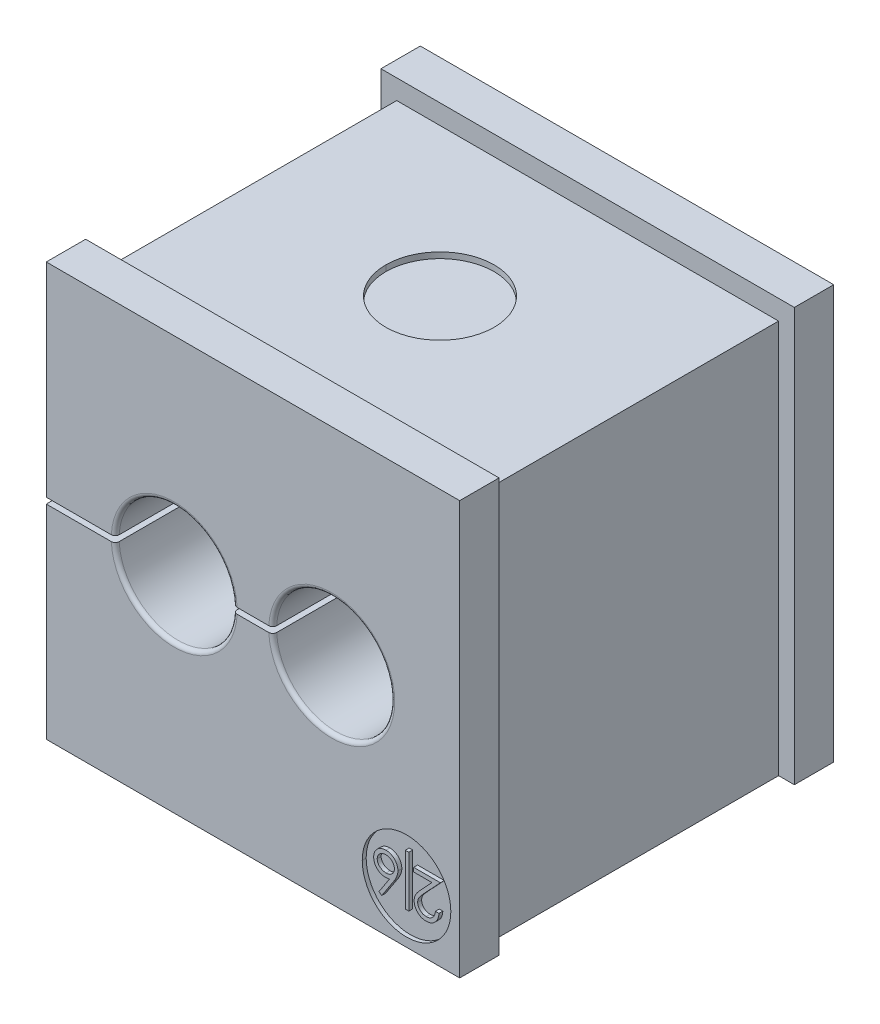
ISO-10303-21;
HEADER;
FILE_DESCRIPTION(('STEP AP214'),'2;1');
FILE_NAME('part.step','',(''),(''),'','','');
FILE_SCHEMA(('AUTOMOTIVE_DESIGN { 1 0 10303 214 1 1 1 1 }'));
ENDSEC;
DATA;
#1=APPLICATION_CONTEXT('core data for automotive mechanical design processes');
#2=APPLICATION_PROTOCOL_DEFINITION('international standard','automotive_design',2000,#1);
#3=PRODUCT_CONTEXT('',#1,'mechanical');
#4=PRODUCT('Part','Part','',(#3));
#5=PRODUCT_RELATED_PRODUCT_CATEGORY('part','',(#4));
#6=PRODUCT_DEFINITION_FORMATION('','',#4);
#7=PRODUCT_DEFINITION_CONTEXT('part definition',#1,'design');
#8=PRODUCT_DEFINITION('design','',#6,#7);
#9=PRODUCT_DEFINITION_SHAPE('','',#8);
#10=(LENGTH_UNIT() NAMED_UNIT(*) SI_UNIT(.MILLI.,.METRE.));
#11=(NAMED_UNIT(*) PLANE_ANGLE_UNIT() SI_UNIT($,.RADIAN.));
#12=(NAMED_UNIT(*) SI_UNIT($,.STERADIAN.) SOLID_ANGLE_UNIT());
#13=UNCERTAINTY_MEASURE_WITH_UNIT(LENGTH_MEASURE(1.E-05),#10,'distance_accuracy_value','');
#14=(GEOMETRIC_REPRESENTATION_CONTEXT(3) GLOBAL_UNCERTAINTY_ASSIGNED_CONTEXT((#13)) GLOBAL_UNIT_ASSIGNED_CONTEXT((#10,
#11,#12)) REPRESENTATION_CONTEXT('',''));
#15=CARTESIAN_POINT('',(0.,0.,0.));
#16=DIRECTION('',(0.,0.,1.));
#17=DIRECTION('',(1.,0.,0.));
#18=AXIS2_PLACEMENT_3D('',#15,#16,#17);
#19=CARTESIAN_POINT('',(0.,0.149999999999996,-9.5));
#20=DIRECTION('',(0.,1.,0.));
#21=DIRECTION('',(1.,0.,0.));
#22=AXIS2_PLACEMENT_3D('',#19,#20,#21);
#23=PLANE('',#22);
#24=DIRECTION('',(0.,0.,1.));
#25=VECTOR('',#24,1.);
#26=CARTESIAN_POINT('',(0.,0.149999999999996,-9.5));
#27=LINE('',#26,#25);
#28=CARTESIAN_POINT('',(0.,0.149999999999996,-9.5));
#29=VERTEX_POINT('',#28);
#30=CARTESIAN_POINT('',(0.,0.149999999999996,-7.5));
#31=VERTEX_POINT('',#30);
#32=EDGE_CURVE('E1175',#29,#31,#27,.T.);
#33=ORIENTED_EDGE('',*,*,#32,.F.);
#34=DIRECTION('',(-1.,0.,0.));
#35=VECTOR('',#34,1.);
#36=CARTESIAN_POINT('',(0.,0.149999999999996,-9.5));
#37=LINE('',#36,#35);
#38=CARTESIAN_POINT('',(3.50375234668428,0.149999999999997,-9.5));
#39=VERTEX_POINT('',#38);
#40=EDGE_CURVE('E1172',#39,#29,#37,.T.);
#41=ORIENTED_EDGE('',*,*,#40,.F.);
#42=DIRECTION('',(0.,0.,-1.));
#43=VECTOR('',#42,1.);
#44=CARTESIAN_POINT('',(3.50375234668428,0.149999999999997,-17.9852813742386));
#45=LINE('',#44,#43);
#46=CARTESIAN_POINT('',(3.50375234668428,0.149999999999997,9.3));
#47=VERTEX_POINT('',#46);
#48=EDGE_CURVE('E945',#47,#39,#45,.T.);
#49=ORIENTED_EDGE('',*,*,#48,.F.);
#50=CARTESIAN_POINT('',(3.50375234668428,0.149999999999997,9.3));
#51=CARTESIAN_POINT('',(3.50375234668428,0.149999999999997,9.33865446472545));
#52=CARTESIAN_POINT('',(3.4881913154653,0.149999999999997,9.37656176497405));
#53=CARTESIAN_POINT('',(3.47314332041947,0.149999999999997,9.4132192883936));
#54=CARTESIAN_POINT('',(3.44491190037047,0.149999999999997,9.44161072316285));
#55=CARTESIAN_POINT('',(3.41796530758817,0.149999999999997,9.4687100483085));
#56=CARTESIAN_POINT('',(3.37993001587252,0.149999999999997,9.4846108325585));
#57=CARTESIAN_POINT('',(3.34311853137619,0.149999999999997,9.5));
#58=CARTESIAN_POINT('',(3.30351755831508,0.149999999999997,9.5));
#59=B_SPLINE_CURVE_WITH_KNOTS('',2,(#50,#51,#52,#53,#54,#55,#56,#57,#58),.UNSPECIFIED.,.F.,.F.,
(3,2,2,2,3),(0.,0.25,0.5,0.75,1.),.UNSPECIFIED.);
#60=CARTESIAN_POINT('',(3.30351755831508,0.149999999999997,9.5));
#61=VERTEX_POINT('',#60);
#62=EDGE_CURVE('E2457',#47,#61,#59,.T.);
#63=ORIENTED_EDGE('',*,*,#62,.T.);
#64=DIRECTION('',(-1.,0.,0.));
#65=VECTOR('',#64,1.);
#66=CARTESIAN_POINT('',(0.,0.149999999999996,9.5));
#67=LINE('',#66,#65);
#68=CARTESIAN_POINT('',(0.,0.149999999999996,9.5));
#69=VERTEX_POINT('',#68);
#70=EDGE_CURVE('E540',#61,#69,#67,.T.);
#71=ORIENTED_EDGE('',*,*,#70,.T.);
#72=DIRECTION('',(0.,0.,1.));
#73=VECTOR('',#72,1.);
#74=CARTESIAN_POINT('',(0.,0.149999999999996,-9.5));
#75=LINE('',#74,#73);
#76=CARTESIAN_POINT('',(0.,0.149999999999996,7.5));
#77=VERTEX_POINT('',#76);
#78=EDGE_CURVE('E2382',#77,#69,#75,.T.);
#79=ORIENTED_EDGE('',*,*,#78,.F.);
#80=DIRECTION('',(-1.,0.,0.));
#81=VECTOR('',#80,1.);
#82=CARTESIAN_POINT('',(1.3,0.149999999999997,7.5));
#83=LINE('',#82,#81);
#84=CARTESIAN_POINT('',(0.8,0.149999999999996,7.5));
#85=VERTEX_POINT('',#84);
#86=EDGE_CURVE('E1244',#85,#77,#83,.T.);
#87=ORIENTED_EDGE('',*,*,#86,.F.);
#88=DIRECTION('',(0.,0.,1.));
#89=VECTOR('',#88,1.);
#90=CARTESIAN_POINT('',(0.8,0.149999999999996,1.75));
#91=LINE('',#90,#89);
#92=CARTESIAN_POINT('',(0.8,0.149999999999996,-7.5));
#93=VERTEX_POINT('',#92);
#94=EDGE_CURVE('E1198',#93,#85,#91,.T.);
#95=ORIENTED_EDGE('',*,*,#94,.F.);
#96=DIRECTION('',(1.,0.,0.));
#97=VECTOR('',#96,1.);
#98=CARTESIAN_POINT('',(0.,0.149999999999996,-7.5));
#99=LINE('',#98,#97);
#100=EDGE_CURVE('E1207',#31,#93,#99,.T.);
#101=ORIENTED_EDGE('',*,*,#100,.F.);
#102=EDGE_LOOP('',(#33,#41,#49,#63,#71,#79,#87,#95,#101));
#103=FACE_BOUND('',#102,.T.);
#104=ADVANCED_FACE('F15',(#103),#23,.F.);
#105=CARTESIAN_POINT('',(0.,-0.15,-9.5));
#106=DIRECTION('',(0.,-1.,0.));
#107=DIRECTION('',(0.,0.,-1.));
#108=AXIS2_PLACEMENT_3D('',#105,#106,#107);
#109=PLANE('',#108);
#110=DIRECTION('',(0.,0.,-1.));
#111=VECTOR('',#110,1.);
#112=CARTESIAN_POINT('',(0.8,-0.15,1.75));
#113=LINE('',#112,#111);
#114=CARTESIAN_POINT('',(0.8,-0.15,7.5));
#115=VERTEX_POINT('',#114);
#116=CARTESIAN_POINT('',(0.8,-0.15,-7.5));
#117=VERTEX_POINT('',#116);
#118=EDGE_CURVE('E490',#115,#117,#113,.T.);
#119=ORIENTED_EDGE('',*,*,#118,.F.);
#120=DIRECTION('',(1.,0.,0.));
#121=VECTOR('',#120,1.);
#122=CARTESIAN_POINT('',(1.3,-0.15,7.5));
#123=LINE('',#122,#121);
#124=CARTESIAN_POINT('',(0.,-0.15,7.5));
#125=VERTEX_POINT('',#124);
#126=EDGE_CURVE('E484',#125,#115,#123,.T.);
#127=ORIENTED_EDGE('',*,*,#126,.F.);
#128=DIRECTION('',(0.,0.,1.));
#129=VECTOR('',#128,1.);
#130=CARTESIAN_POINT('',(0.,-0.15,-9.5));
#131=LINE('',#130,#129);
#132=CARTESIAN_POINT('',(0.,-0.15,9.5));
#133=VERTEX_POINT('',#132);
#134=EDGE_CURVE('E532',#125,#133,#131,.T.);
#135=ORIENTED_EDGE('',*,*,#134,.T.);
#136=DIRECTION('',(1.,0.,0.));
#137=VECTOR('',#136,1.);
#138=CARTESIAN_POINT('',(0.,-0.15,9.5));
#139=LINE('',#138,#137);
#140=CARTESIAN_POINT('',(3.30351755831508,-0.15,9.5));
#141=VERTEX_POINT('',#140);
#142=EDGE_CURVE('E879',#133,#141,#139,.T.);
#143=ORIENTED_EDGE('',*,*,#142,.T.);
#144=CARTESIAN_POINT('',(3.30351755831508,-0.149999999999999,9.5));
#145=CARTESIAN_POINT('',(3.34250229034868,-0.149999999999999,9.5));
#146=CARTESIAN_POINT('',(3.38016642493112,-0.149999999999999,9.4845864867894));
#147=CARTESIAN_POINT('',(3.41646361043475,-0.149999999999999,9.4697323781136));
#148=CARTESIAN_POINT('',(3.44502968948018,-0.149999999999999,9.4414932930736));
#149=CARTESIAN_POINT('',(3.47233210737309,-0.149999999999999,9.41450340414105));
#150=CARTESIAN_POINT('',(3.48826163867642,-0.149999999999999,9.3767009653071));
#151=CARTESIAN_POINT('',(3.50375234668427,-0.149999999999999,9.33993989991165));
#152=CARTESIAN_POINT('',(3.50375234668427,-0.149999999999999,9.3));
#153=B_SPLINE_CURVE_WITH_KNOTS('',2,(#144,#145,#146,#147,#148,#149,#150,#151,#152),
.UNSPECIFIED.,.F.,.F.,(3,2,2,2,3),(0.,0.25,0.5,0.75,1.),.UNSPECIFIED.);
#154=CARTESIAN_POINT('',(3.50375234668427,-0.15,9.3));
#155=VERTEX_POINT('',#154);
#156=EDGE_CURVE('E805',#141,#155,#153,.T.);
#157=ORIENTED_EDGE('',*,*,#156,.T.);
#158=DIRECTION('',(0.,0.,1.));
#159=VECTOR('',#158,1.);
#160=CARTESIAN_POINT('',(3.50375234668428,-0.15,-17.9852813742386));
#161=LINE('',#160,#159);
#162=CARTESIAN_POINT('',(3.50375234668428,-0.15,-9.5));
#163=VERTEX_POINT('',#162);
#164=EDGE_CURVE('E564',#163,#155,#161,.T.);
#165=ORIENTED_EDGE('',*,*,#164,.F.);
#166=DIRECTION('',(1.,0.,0.));
#167=VECTOR('',#166,1.);
#168=CARTESIAN_POINT('',(0.,-0.15,-9.5));
#169=LINE('',#168,#167);
#170=CARTESIAN_POINT('',(0.,-0.15,-9.5));
#171=VERTEX_POINT('',#170);
#172=EDGE_CURVE('E546',#171,#163,#169,.T.);
#173=ORIENTED_EDGE('',*,*,#172,.F.);
#174=DIRECTION('',(0.,0.,1.));
#175=VECTOR('',#174,1.);
#176=CARTESIAN_POINT('',(0.,-0.15,-9.5));
#177=LINE('',#176,#175);
#178=CARTESIAN_POINT('',(0.,-0.15,-7.5));
#179=VERTEX_POINT('',#178);
#180=EDGE_CURVE('E1192',#171,#179,#177,.T.);
#181=ORIENTED_EDGE('',*,*,#180,.T.);
#182=DIRECTION('',(-1.,0.,0.));
#183=VECTOR('',#182,1.);
#184=CARTESIAN_POINT('',(0.,-0.15,-7.5));
#185=LINE('',#184,#183);
#186=EDGE_CURVE('E550',#117,#179,#185,.T.);
#187=ORIENTED_EDGE('',*,*,#186,.F.);
#188=EDGE_LOOP('',(#119,#127,#135,#143,#157,#165,#173,#181,#187));
#189=FACE_BOUND('',#188,.T.);
#190=ADVANCED_FACE('F1055',(#189),#109,.F.);
#191=CARTESIAN_POINT('',(0.,0.149999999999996,-9.5));
#192=DIRECTION('',(0.,1.,0.));
#193=DIRECTION('',(1.,0.,0.));
#194=AXIS2_PLACEMENT_3D('',#191,#192,#193);
#195=PLANE('',#194);
#196=DIRECTION('',(-1.,0.,0.));
#197=VECTOR('',#196,1.);
#198=CARTESIAN_POINT('',(0.,0.149999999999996,-9.5));
#199=LINE('',#198,#197);
#200=CARTESIAN_POINT('',(11.5037523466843,0.149999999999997,-9.5));
#201=VERTEX_POINT('',#200);
#202=CARTESIAN_POINT('',(9.49624765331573,0.149999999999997,-9.5));
#203=VERTEX_POINT('',#202);
#204=EDGE_CURVE('E547',#201,#203,#199,.T.);
#205=ORIENTED_EDGE('',*,*,#204,.F.);
#206=DIRECTION('',(0.,0.,-1.));
#207=VECTOR('',#206,1.);
#208=CARTESIAN_POINT('',(11.5037523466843,0.149999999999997,-17.9852813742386));
#209=LINE('',#208,#207);
#210=CARTESIAN_POINT('',(11.5037523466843,0.149999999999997,9.3));
#211=VERTEX_POINT('',#210);
#212=EDGE_CURVE('E982',#211,#201,#209,.T.);
#213=ORIENTED_EDGE('',*,*,#212,.F.);
#214=CARTESIAN_POINT('',(11.5037523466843,0.149999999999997,9.3));
#215=CARTESIAN_POINT('',(11.5037523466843,0.149999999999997,9.338848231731));
#216=CARTESIAN_POINT('',(11.488362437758,0.149999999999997,9.37644055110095));
#217=CARTESIAN_POINT('',(11.4734532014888,0.149999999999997,9.4128587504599));
#218=CARTESIAN_POINT('',(11.4450489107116,0.149999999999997,9.44147411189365));
#219=CARTESIAN_POINT('',(11.4179338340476,0.149999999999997,9.4687906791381));
#220=CARTESIAN_POINT('',(11.3799367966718,0.149999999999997,9.4846716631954));
#221=CARTESIAN_POINT('',(11.3432620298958,0.149999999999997,9.5));
#222=CARTESIAN_POINT('',(11.3035175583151,0.149999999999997,9.5));
#223=B_SPLINE_CURVE_WITH_KNOTS('',2,(#214,#215,#216,#217,#218,#219,#220,#221,#222),
.UNSPECIFIED.,.F.,.F.,(3,2,2,2,3),(0.,0.25,0.5,0.75,1.),.UNSPECIFIED.);
#224=CARTESIAN_POINT('',(11.3035175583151,0.149999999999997,9.5));
#225=VERTEX_POINT('',#224);
#226=EDGE_CURVE('E25',#211,#225,#223,.T.);
#227=ORIENTED_EDGE('',*,*,#226,.T.);
#228=DIRECTION('',(-1.,0.,0.));
#229=VECTOR('',#228,1.);
#230=CARTESIAN_POINT('',(0.,0.149999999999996,9.5));
#231=LINE('',#230,#229);
#232=CARTESIAN_POINT('',(9.69648244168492,0.149999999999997,9.5));
#233=VERTEX_POINT('',#232);
#234=EDGE_CURVE('E958',#225,#233,#231,.T.);
#235=ORIENTED_EDGE('',*,*,#234,.T.);
#236=CARTESIAN_POINT('',(9.69648244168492,0.149999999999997,9.5));
#237=CARTESIAN_POINT('',(9.65781608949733,0.149999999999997,9.5));
#238=CARTESIAN_POINT('',(9.62014524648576,0.149999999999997,9.48465427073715));
#239=CARTESIAN_POINT('',(9.58362719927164,0.149999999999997,9.46977814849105));
#240=CARTESIAN_POINT('',(9.55507382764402,0.149999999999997,9.4415965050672));
#241=CARTESIAN_POINT('',(9.5277996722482,0.149999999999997,9.4146774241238));
#242=CARTESIAN_POINT('',(9.51175360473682,0.149999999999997,9.3764813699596));
#243=CARTESIAN_POINT('',(9.49624765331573,0.149999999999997,9.3395710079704));
#244=CARTESIAN_POINT('',(9.49624765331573,0.149999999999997,9.3));
#245=B_SPLINE_CURVE_WITH_KNOTS('',2,(#236,#237,#238,#239,#240,#241,#242,#243,#244),
.UNSPECIFIED.,.F.,.F.,(3,2,2,2,3),(0.,0.25,0.5,0.75,1.),.UNSPECIFIED.);
#246=CARTESIAN_POINT('',(9.49624765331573,0.149999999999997,9.3));
#247=VERTEX_POINT('',#246);
#248=EDGE_CURVE('E902',#233,#247,#245,.T.);
#249=ORIENTED_EDGE('',*,*,#248,.T.);
#250=DIRECTION('',(0.,0.,1.));
#251=VECTOR('',#250,1.);
#252=CARTESIAN_POINT('',(9.49624765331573,0.149999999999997,-17.9852813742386));
#253=LINE('',#252,#251);
#254=EDGE_CURVE('E1272',#203,#247,#253,.T.);
#255=ORIENTED_EDGE('',*,*,#254,.F.);
#256=EDGE_LOOP('',(#205,#213,#227,#235,#249,#255));
#257=FACE_BOUND('',#256,.T.);
#258=ADVANCED_FACE('F829',(#257),#195,.F.);
#259=CARTESIAN_POINT('',(0.,-0.15,-9.5));
#260=DIRECTION('',(0.,-1.,0.));
#261=DIRECTION('',(0.,0.,-1.));
#262=AXIS2_PLACEMENT_3D('',#259,#260,#261);
#263=PLANE('',#262);
#264=CARTESIAN_POINT('',(9.49624765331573,-0.149999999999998,9.3));
#265=CARTESIAN_POINT('',(9.49624765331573,-0.149999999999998,9.33898497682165));
#266=CARTESIAN_POINT('',(9.51167656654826,-0.149999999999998,9.3765876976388));
#267=CARTESIAN_POINT('',(9.52656584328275,-0.149999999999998,9.4128752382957));
#268=CARTESIAN_POINT('',(9.55493959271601,-0.149999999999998,9.44146263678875));
#269=CARTESIAN_POINT('',(9.58200694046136,-0.149999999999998,9.46873379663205));
#270=CARTESIAN_POINT('',(9.61996291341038,-0.149999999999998,9.4846235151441));
#271=CARTESIAN_POINT('',(9.65669291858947,-0.149999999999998,9.5));
#272=CARTESIAN_POINT('',(9.69648244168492,-0.149999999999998,9.5));
#273=B_SPLINE_CURVE_WITH_KNOTS('',2,(#264,#265,#266,#267,#268,#269,#270,#271,#272),
.UNSPECIFIED.,.F.,.F.,(3,2,2,2,3),(0.,0.25,0.5,0.75,1.),.UNSPECIFIED.);
#274=CARTESIAN_POINT('',(9.49624765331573,-0.15,9.3));
#275=VERTEX_POINT('',#274);
#276=CARTESIAN_POINT('',(9.69648244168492,-0.15,9.5));
#277=VERTEX_POINT('',#276);
#278=EDGE_CURVE('E849',#275,#277,#273,.T.);
#279=ORIENTED_EDGE('',*,*,#278,.T.);
#280=DIRECTION('',(1.,0.,0.));
#281=VECTOR('',#280,1.);
#282=CARTESIAN_POINT('',(0.,-0.15,9.5));
#283=LINE('',#282,#281);
#284=CARTESIAN_POINT('',(11.3035175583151,-0.15,9.5));
#285=VERTEX_POINT('',#284);
#286=EDGE_CURVE('E972',#277,#285,#283,.T.);
#287=ORIENTED_EDGE('',*,*,#286,.T.);
#288=CARTESIAN_POINT('',(11.3035175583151,-0.149999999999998,9.5));
#289=CARTESIAN_POINT('',(11.3421808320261,-0.149999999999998,9.5));
#290=CARTESIAN_POINT('',(11.3798885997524,-0.149999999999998,9.4846294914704));
#291=CARTESIAN_POINT('',(11.416399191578,-0.149999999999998,9.46974697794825));
#292=CARTESIAN_POINT('',(11.444913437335,-0.149999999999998,9.4416091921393));
#293=CARTESIAN_POINT('',(11.4721470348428,-0.149999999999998,9.41473514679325));
#294=CARTESIAN_POINT('',(11.4882112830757,-0.149999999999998,9.3765254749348));
#295=CARTESIAN_POINT('',(11.5037523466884,-0.149999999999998,9.3395602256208));
#296=CARTESIAN_POINT('',(11.5037523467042,-0.149999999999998,9.30000000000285));
#297=B_SPLINE_CURVE_WITH_KNOTS('',2,(#288,#289,#290,#291,#292,#293,#294,#295,#296),
.UNSPECIFIED.,.F.,.F.,(3,2,2,2,3),(0.,0.25,0.5,0.75,1.),.UNSPECIFIED.);
#298=CARTESIAN_POINT('',(11.5037523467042,-0.15,9.30000000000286));
#299=VERTEX_POINT('',#298);
#300=EDGE_CURVE('E9',#285,#299,#297,.T.);
#301=ORIENTED_EDGE('',*,*,#300,.T.);
#302=DIRECTION('',(0.,0.,1.));
#303=VECTOR('',#302,1.);
#304=CARTESIAN_POINT('',(11.5037523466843,-0.15,-17.9852813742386));
#305=LINE('',#304,#303);
#306=CARTESIAN_POINT('',(11.5037523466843,-0.15,-9.5));
#307=VERTEX_POINT('',#306);
#308=EDGE_CURVE('E559',#307,#299,#305,.T.);
#309=ORIENTED_EDGE('',*,*,#308,.F.);
#310=DIRECTION('',(1.,0.,0.));
#311=VECTOR('',#310,1.);
#312=CARTESIAN_POINT('',(0.,-0.15,-9.5));
#313=LINE('',#312,#311);
#314=CARTESIAN_POINT('',(9.49624765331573,-0.15,-9.5));
#315=VERTEX_POINT('',#314);
#316=EDGE_CURVE('E545',#315,#307,#313,.T.);
#317=ORIENTED_EDGE('',*,*,#316,.F.);
#318=DIRECTION('',(0.,0.,-1.));
#319=VECTOR('',#318,1.);
#320=CARTESIAN_POINT('',(9.49624765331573,-0.15,-17.9852813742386));
#321=LINE('',#320,#319);
#322=EDGE_CURVE('E855',#275,#315,#321,.T.);
#323=ORIENTED_EDGE('',*,*,#322,.F.);
#324=EDGE_LOOP('',(#279,#287,#301,#309,#317,#323));
#325=FACE_BOUND('',#324,.T.);
#326=ADVANCED_FACE('F818',(#325),#263,.F.);
#327=CARTESIAN_POINT('',(14.5,0.,9.3));
#328=DIRECTION('',(0.,0.,-1.));
#329=DIRECTION('',(-1.,0.,0.));
#330=AXIS2_PLACEMENT_3D('',#327,#328,#329);
#331=TOROIDAL_SURFACE('',#330,3.2,0.2);
#332=ORIENTED_EDGE('',*,*,#226,.F.);
#333=CARTESIAN_POINT('',(14.5,0.,9.3));
#334=DIRECTION('',(0.,0.,1.));
#335=DIRECTION('',(-1.,0.,0.));
#336=AXIS2_PLACEMENT_3D('',#333,#334,#335);
#337=CIRCLE('',#336,3.);
#338=CARTESIAN_POINT('',(17.5,0.,9.3));
#339=VERTEX_POINT('',#338);
#340=EDGE_CURVE('E978',#339,#211,#337,.T.);
#341=ORIENTED_EDGE('',*,*,#340,.F.);
#342=CARTESIAN_POINT('',(14.5,0.,9.3));
#343=DIRECTION('',(0.,0.,1.));
#344=DIRECTION('',(-1.,0.,0.));
#345=AXIS2_PLACEMENT_3D('',#342,#343,#344);
#346=CIRCLE('',#345,3.);
#347=EDGE_CURVE('E1019',#299,#339,#346,.T.);
#348=ORIENTED_EDGE('',*,*,#347,.F.);
#349=ORIENTED_EDGE('',*,*,#300,.F.);
#350=CARTESIAN_POINT('',(14.5,0.,9.5));
#351=DIRECTION('',(0.,0.,-1.));
#352=DIRECTION('',(-1.,0.,0.));
#353=AXIS2_PLACEMENT_3D('',#350,#351,#352);
#354=CIRCLE('',#353,3.2);
#355=EDGE_CURVE('E965',#225,#285,#354,.T.);
#356=ORIENTED_EDGE('',*,*,#355,.F.);
#357=EDGE_LOOP('',(#332,#341,#348,#349,#356));
#358=FACE_BOUND('',#357,.T.);
#359=ADVANCED_FACE('F828',(#358),#331,.T.);
#360=CARTESIAN_POINT('',(6.5,0.,9.3));
#361=DIRECTION('',(0.,0.,-1.));
#362=DIRECTION('',(-1.,0.,0.));
#363=AXIS2_PLACEMENT_3D('',#360,#361,#362);
#364=TOROIDAL_SURFACE('',#363,3.2,0.2);
#365=ORIENTED_EDGE('',*,*,#156,.F.);
#366=CARTESIAN_POINT('',(6.5,0.,9.5));
#367=DIRECTION('',(0.,0.,-1.));
#368=DIRECTION('',(-1.,0.,0.));
#369=AXIS2_PLACEMENT_3D('',#366,#367,#368);
#370=CIRCLE('',#369,3.2);
#371=EDGE_CURVE('E889',#277,#141,#370,.T.);
#372=ORIENTED_EDGE('',*,*,#371,.F.);
#373=ORIENTED_EDGE('',*,*,#278,.F.);
#374=CARTESIAN_POINT('',(6.5,0.,9.3));
#375=DIRECTION('',(0.,0.,1.));
#376=DIRECTION('',(-1.,0.,0.));
#377=AXIS2_PLACEMENT_3D('',#374,#375,#376);
#378=CIRCLE('',#377,3.);
#379=EDGE_CURVE('E1025',#155,#275,#378,.T.);
#380=ORIENTED_EDGE('',*,*,#379,.F.);
#381=EDGE_LOOP('',(#365,#372,#373,#380));
#382=FACE_BOUND('',#381,.T.);
#383=ADVANCED_FACE('F857',(#382),#364,.T.);
#384=CARTESIAN_POINT('',(18.3,-7.8,9.3));
#385=DIRECTION('',(0.,0.,1.));
#386=DIRECTION('',(1.,0.,0.));
#387=AXIS2_PLACEMENT_3D('',#384,#385,#386);
#388=PLANE('',#387);
#389=CARTESIAN_POINT('',(16.8102564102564,-7.35048076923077,9.3));
#390=CARTESIAN_POINT('',(16.810567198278,-7.3641363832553,9.3));
#391=CARTESIAN_POINT('',(16.8111771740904,-7.39093791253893,9.3));
#392=CARTESIAN_POINT('',(16.818209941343,-7.43016539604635,9.3));
#393=CARTESIAN_POINT('',(16.8277088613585,-7.46819847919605,9.3));
#394=CARTESIAN_POINT('',(16.8430599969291,-7.50418037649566,9.3));
#395=CARTESIAN_POINT('',(16.8613444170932,-7.53910624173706,9.3));
#396=CARTESIAN_POINT('',(16.8846377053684,-7.57197745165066,9.3));
#397=CARTESIAN_POINT('',(16.9113435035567,-7.60372689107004,9.3));
#398=CARTESIAN_POINT('',(16.9422734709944,-7.63317940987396,9.3));
#399=CARTESIAN_POINT('',(16.9759147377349,-7.66013809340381,9.3));
#400=CARTESIAN_POINT('',(17.011718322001,-7.6838639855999,9.3));
#401=CARTESIAN_POINT('',(17.0490245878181,-7.70411714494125,9.3));
#402=CARTESIAN_POINT('',(17.0883608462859,-7.72009833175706,9.3));
#403=CARTESIAN_POINT('',(17.1291973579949,-7.73297300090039,9.3));
#404=CARTESIAN_POINT('',(17.1718162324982,-7.74228144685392,9.3));
#405=CARTESIAN_POINT('',(17.2162477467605,-7.74740430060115,9.3));
#406=CARTESIAN_POINT('',(17.2464085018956,-7.74827448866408,9.3));
#407=CARTESIAN_POINT('',(17.2617788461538,-7.74871794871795,9.3));
#408=(BOUNDED_CURVE() B_SPLINE_CURVE(3,(#389,#390,#391,#392,#393,#394,#395,#396,#397,#398,#399,
#400,#401,#402,#403,#404,#405,#406,#407),.UNSPECIFIED.,.F.,.F.) B_SPLINE_CURVE_WITH_KNOTS((4,1,
1,1,1,1,1,1,1,1,1,1,1,1,1,1,4),(0.,0.0611448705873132,0.120007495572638,0.178245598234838,
0.236508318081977,0.2949031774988,0.354696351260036,0.41671732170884,0.480659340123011,
0.545834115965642,0.609767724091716,0.672988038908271,0.735810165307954,0.799816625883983,
0.864759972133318,0.931079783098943,1.),
.UNSPECIFIED.) CURVE() GEOMETRIC_REPRESENTATION_ITEM() RATIONAL_B_SPLINE_CURVE((1.,1.,1.,1.,1.,
1.,1.,1.,1.,1.,1.,1.,1.,1.,1.,1.,1.,1.,1.)) REPRESENTATION_ITEM(''));
#409=CARTESIAN_POINT('',(16.8102564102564,-7.35048076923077,9.3));
#410=VERTEX_POINT('',#409);
#411=CARTESIAN_POINT('',(17.2617788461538,-7.74871794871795,9.3));
#412=VERTEX_POINT('',#411);
#413=EDGE_CURVE('E765',#410,#412,#408,.T.);
#414=ORIENTED_EDGE('',*,*,#413,.T.);
#415=CARTESIAN_POINT('',(17.2617788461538,-7.74871794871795,9.3));
#416=CARTESIAN_POINT('',(17.2770154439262,-7.74827179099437,9.3));
#417=CARTESIAN_POINT('',(17.3069095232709,-7.74739643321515,9.3));
#418=CARTESIAN_POINT('',(17.3506875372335,-7.74234339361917,9.3));
#419=CARTESIAN_POINT('',(17.3921453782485,-7.7330949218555,9.3));
#420=CARTESIAN_POINT('',(17.4312150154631,-7.72007678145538,9.3));
#421=CARTESIAN_POINT('',(17.4684730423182,-7.70417197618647,9.3));
#422=CARTESIAN_POINT('',(17.5033276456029,-7.68400271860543,9.3));
#423=CARTESIAN_POINT('',(17.5360133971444,-7.66028410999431,9.3));
#424=CARTESIAN_POINT('',(17.565775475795,-7.63298431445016,9.3));
#425=CARTESIAN_POINT('',(17.5931115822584,-7.60355118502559,9.3));
#426=CARTESIAN_POINT('',(17.6166232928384,-7.57183160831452,9.3));
#427=CARTESIAN_POINT('',(17.6369270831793,-7.53880080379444,9.3));
#428=CARTESIAN_POINT('',(17.6534295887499,-7.5041467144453,9.3));
#429=CARTESIAN_POINT('',(17.6662814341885,-7.46789198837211,9.3));
#430=CARTESIAN_POINT('',(17.6755774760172,-7.43020087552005,9.3));
#431=CARTESIAN_POINT('',(17.6807510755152,-7.39082130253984,9.3));
#432=CARTESIAN_POINT('',(17.6816117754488,-7.36411701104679,9.3));
#433=CARTESIAN_POINT('',(17.6820512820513,-7.35048076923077,9.3));
#434=(BOUNDED_CURVE() B_SPLINE_CURVE(3,(#415,#416,#417,#418,#419,#420,#421,#422,#423,#424,#425,
#426,#427,#428,#429,#430,#431,#432,#433),.UNSPECIFIED.,.F.,.F.) B_SPLINE_CURVE_WITH_KNOTS((4,1,
1,1,1,1,1,1,1,1,1,1,1,1,1,1,4),(0.,0.070596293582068,0.138509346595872,0.203801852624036,
0.266994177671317,0.329058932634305,0.391139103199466,0.453135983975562,0.515768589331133,
0.577944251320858,0.63894533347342,0.698363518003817,0.757306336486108,0.816401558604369,
0.876272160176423,0.936819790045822,1.),
.UNSPECIFIED.) CURVE() GEOMETRIC_REPRESENTATION_ITEM() RATIONAL_B_SPLINE_CURVE((1.,1.,1.,1.,1.,
1.,1.,1.,1.,1.,1.,1.,1.,1.,1.,1.,1.,1.,1.)) REPRESENTATION_ITEM(''));
#435=CARTESIAN_POINT('',(17.6820512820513,-7.35048076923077,9.3));
#436=VERTEX_POINT('',#435);
#437=EDGE_CURVE('E779',#412,#436,#434,.T.);
#438=ORIENTED_EDGE('',*,*,#437,.T.);
#439=CARTESIAN_POINT('',(17.6820512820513,-7.35048076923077,9.3));
#440=CARTESIAN_POINT('',(17.6816797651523,-7.33696936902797,9.3));
#441=CARTESIAN_POINT('',(17.6809476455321,-7.31034349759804,9.3));
#442=CARTESIAN_POINT('',(17.6747430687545,-7.27125058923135,9.3));
#443=CARTESIAN_POINT('',(17.6647556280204,-7.23375087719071,9.3));
#444=CARTESIAN_POINT('',(17.6505577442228,-7.19776525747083,9.3));
#445=CARTESIAN_POINT('',(17.6324195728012,-7.16334844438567,9.3));
#446=CARTESIAN_POINT('',(17.6107253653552,-7.13008438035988,9.3));
#447=CARTESIAN_POINT('',(17.5844192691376,-7.09885851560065,9.3));
#448=CARTESIAN_POINT('',(17.5545349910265,-7.06947813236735,9.3));
#449=CARTESIAN_POINT('',(17.522062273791,-7.04259268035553,9.3));
#450=CARTESIAN_POINT('',(17.487791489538,-7.01855549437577,9.3));
#451=CARTESIAN_POINT('',(17.4515996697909,-6.9986041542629,9.3));
#452=CARTESIAN_POINT('',(17.4138722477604,-6.98192766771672,9.3));
#453=CARTESIAN_POINT('',(17.3741352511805,-6.96967596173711,9.3));
#454=CARTESIAN_POINT('',(17.3330616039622,-6.96028975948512,9.3));
#455=CARTESIAN_POINT('',(17.290085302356,-6.95515967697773,9.3));
#456=CARTESIAN_POINT('',(17.2609898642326,-6.95428974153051,9.3));
#457=CARTESIAN_POINT('',(17.2461538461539,-6.95384615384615,9.3));
#458=(BOUNDED_CURVE() B_SPLINE_CURVE(3,(#439,#440,#441,#442,#443,#444,#445,#446,#447,#448,#449,
#450,#451,#452,#453,#454,#455,#456,#457),.UNSPECIFIED.,.F.,.F.) B_SPLINE_CURVE_WITH_KNOTS((4,1,
1,1,1,1,1,1,1,1,1,1,1,1,1,1,4),(0.,0.061846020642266,0.121875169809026,0.180772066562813,
0.239261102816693,0.29862294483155,0.358670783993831,0.420767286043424,0.485204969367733,
0.550355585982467,0.613636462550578,0.676603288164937,0.73932310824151,0.802185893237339,
0.866730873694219,0.932044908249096,1.),
.UNSPECIFIED.) CURVE() GEOMETRIC_REPRESENTATION_ITEM() RATIONAL_B_SPLINE_CURVE((1.,1.,1.,1.,1.,
1.,1.,1.,1.,1.,1.,1.,1.,1.,1.,1.,1.,1.,1.)) REPRESENTATION_ITEM(''));
#459=CARTESIAN_POINT('',(17.2461538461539,-6.95384615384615,9.3));
#460=VERTEX_POINT('',#459);
#461=EDGE_CURVE('E48',#436,#460,#458,.T.);
#462=ORIENTED_EDGE('',*,*,#461,.T.);
#463=CARTESIAN_POINT('',(17.2461538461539,-6.95384615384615,9.3));
#464=CARTESIAN_POINT('',(17.2313178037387,-6.95428970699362,9.3));
#465=CARTESIAN_POINT('',(17.2022223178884,-6.95515957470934,9.3));
#466=CARTESIAN_POINT('',(17.1592463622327,-6.96029014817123,9.3));
#467=CARTESIAN_POINT('',(17.1181714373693,-6.96967453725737,9.3));
#468=CARTESIAN_POINT('',(17.0784390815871,-6.98193282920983,9.3));
#469=CARTESIAN_POINT('',(17.0406944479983,-6.99858489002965,9.3));
#470=CARTESIAN_POINT('',(17.0044709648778,-7.01868125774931,9.3));
#471=CARTESIAN_POINT('',(16.9698729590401,-7.04244696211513,9.3));
#472=CARTESIAN_POINT('',(16.93742136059,-7.06952462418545,9.3));
#473=CARTESIAN_POINT('',(16.9074123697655,-7.09869184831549,9.3));
#474=CARTESIAN_POINT('',(16.8817107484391,-7.13036981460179,9.3));
#475=CARTESIAN_POINT('',(16.8593169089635,-7.16308665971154,9.3));
#476=CARTESIAN_POINT('',(16.8418704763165,-7.19790215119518,9.3));
#477=CARTESIAN_POINT('',(16.8275136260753,-7.23372947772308,9.3));
#478=CARTESIAN_POINT('',(16.817575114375,-7.27125642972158,9.3));
#479=CARTESIAN_POINT('',(16.8113573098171,-7.31034197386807,9.3));
#480=CARTESIAN_POINT('',(16.8106270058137,-7.33696885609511,9.3));
#481=CARTESIAN_POINT('',(16.8102564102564,-7.35048076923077,9.3));
#482=(BOUNDED_CURVE() B_SPLINE_CURVE(3,(#463,#464,#465,#466,#467,#468,#469,#470,#471,#472,#473,
#474,#475,#476,#477,#478,#479,#480,#481),.UNSPECIFIED.,.F.,.F.) B_SPLINE_CURVE_WITH_KNOTS((4,1,
1,1,1,1,1,1,1,1,1,1,1,1,1,1,4),(0.,0.0679434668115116,0.133246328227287,0.197780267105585,
0.260632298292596,0.323341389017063,0.386297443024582,0.450070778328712,0.515210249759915,
0.579636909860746,0.64133311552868,0.701709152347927,0.760779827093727,0.819258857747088,
0.87814567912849,0.938164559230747,1.),
.UNSPECIFIED.) CURVE() GEOMETRIC_REPRESENTATION_ITEM() RATIONAL_B_SPLINE_CURVE((1.,1.,1.,1.,1.,
1.,1.,1.,1.,1.,1.,1.,1.,1.,1.,1.,1.,1.,1.)) REPRESENTATION_ITEM(''));
#483=EDGE_CURVE('E36',#460,#410,#482,.T.);
#484=ORIENTED_EDGE('',*,*,#483,.T.);
#485=EDGE_LOOP('',(#414,#438,#462,#484));
#486=FACE_BOUND('',#485,.T.);
#487=ADVANCED_FACE('F867',(#486),#388,.T.);
#488=CARTESIAN_POINT('',(17.2461538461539,-6.95384615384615,9.5));
#489=CARTESIAN_POINT('',(17.2461538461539,-6.95384615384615,9.3));
#490=CARTESIAN_POINT('',(17.2313178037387,-6.95428970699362,9.5));
#491=CARTESIAN_POINT('',(17.2313178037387,-6.95428970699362,9.3));
#492=CARTESIAN_POINT('',(17.2022223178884,-6.95515957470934,9.5));
#493=CARTESIAN_POINT('',(17.2022223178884,-6.95515957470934,9.3));
#494=CARTESIAN_POINT('',(17.1592463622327,-6.96029014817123,9.5));
#495=CARTESIAN_POINT('',(17.1592463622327,-6.96029014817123,9.3));
#496=CARTESIAN_POINT('',(17.1181714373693,-6.96967453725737,9.5));
#497=CARTESIAN_POINT('',(17.1181714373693,-6.96967453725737,9.3));
#498=CARTESIAN_POINT('',(17.0784390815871,-6.98193282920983,9.5));
#499=CARTESIAN_POINT('',(17.0784390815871,-6.98193282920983,9.3));
#500=CARTESIAN_POINT('',(17.0406944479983,-6.99858489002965,9.5));
#501=CARTESIAN_POINT('',(17.0406944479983,-6.99858489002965,9.3));
#502=CARTESIAN_POINT('',(17.0044709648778,-7.01868125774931,9.5));
#503=CARTESIAN_POINT('',(17.0044709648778,-7.01868125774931,9.3));
#504=CARTESIAN_POINT('',(16.9698729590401,-7.04244696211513,9.5));
#505=CARTESIAN_POINT('',(16.9698729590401,-7.04244696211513,9.3));
#506=CARTESIAN_POINT('',(16.93742136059,-7.06952462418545,9.5));
#507=CARTESIAN_POINT('',(16.93742136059,-7.06952462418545,9.3));
#508=CARTESIAN_POINT('',(16.9074123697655,-7.09869184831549,9.5));
#509=CARTESIAN_POINT('',(16.9074123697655,-7.09869184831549,9.3));
#510=CARTESIAN_POINT('',(16.8817107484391,-7.13036981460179,9.5));
#511=CARTESIAN_POINT('',(16.8817107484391,-7.13036981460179,9.3));
#512=CARTESIAN_POINT('',(16.8593169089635,-7.16308665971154,9.5));
#513=CARTESIAN_POINT('',(16.8593169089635,-7.16308665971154,9.3));
#514=CARTESIAN_POINT('',(16.8418704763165,-7.19790215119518,9.5));
#515=CARTESIAN_POINT('',(16.8418704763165,-7.19790215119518,9.3));
#516=CARTESIAN_POINT('',(16.8275136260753,-7.23372947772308,9.5));
#517=CARTESIAN_POINT('',(16.8275136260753,-7.23372947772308,9.3));
#518=CARTESIAN_POINT('',(16.817575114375,-7.27125642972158,9.5));
#519=CARTESIAN_POINT('',(16.817575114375,-7.27125642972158,9.3));
#520=CARTESIAN_POINT('',(16.8113573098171,-7.31034197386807,9.5));
#521=CARTESIAN_POINT('',(16.8113573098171,-7.31034197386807,9.3));
#522=CARTESIAN_POINT('',(16.8106270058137,-7.33696885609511,9.5));
#523=CARTESIAN_POINT('',(16.8106270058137,-7.33696885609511,9.3));
#524=CARTESIAN_POINT('',(16.8102564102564,-7.35048076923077,9.5));
#525=CARTESIAN_POINT('',(16.8102564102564,-7.35048076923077,9.3));
#526=(BOUNDED_SURFACE() B_SPLINE_SURFACE(3,1,((#488,#489),(#490,#491),(#492,#493),(#494,#495),
(#496,#497),(#498,#499),(#500,#501),(#502,#503),(#504,#505),(#506,#507),(#508,#509),(#510,#511),
(#512,#513),(#514,#515),(#516,#517),(#518,#519),(#520,#521),(#522,#523),(#524,#525)),
.UNSPECIFIED.,.F.,.F.,.F.) B_SPLINE_SURFACE_WITH_KNOTS((4,1,1,1,1,1,1,1,1,1,1,1,1,1,1,1,4),(2,
2),(0.,0.0679434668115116,0.133246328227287,0.197780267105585,0.260632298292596,
0.323341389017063,0.386297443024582,0.450070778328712,0.515210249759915,0.579636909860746,
0.64133311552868,0.701709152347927,0.760779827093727,0.819258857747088,0.87814567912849,
0.938164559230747,1.),(0.,1.),
.UNSPECIFIED.) GEOMETRIC_REPRESENTATION_ITEM() RATIONAL_B_SPLINE_SURFACE(((1.,1.),(1.,1.),(1.,
1.),(1.,1.),(1.,1.),(1.,1.),(1.,1.),(1.,1.),(1.,1.),(1.,1.),(1.,1.),(1.,1.),(1.,1.),(1.,1.),(1.,
1.),(1.,1.),(1.,1.),(1.,1.),(1.,1.))) REPRESENTATION_ITEM('') SURFACE());
#527=DIRECTION('',(0.,0.,-1.));
#528=VECTOR('',#527,1.);
#529=CARTESIAN_POINT('',(17.2461538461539,-6.95384615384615,9.5));
#530=LINE('',#529,#528);
#531=CARTESIAN_POINT('',(17.2461538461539,-6.95384615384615,9.5));
#532=VERTEX_POINT('',#531);
#533=EDGE_CURVE('E795',#532,#460,#530,.T.);
#534=CARTESIAN_POINT('',(17.2461538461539,-6.95384615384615,9.5));
#535=CARTESIAN_POINT('',(17.2313178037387,-6.95428970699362,9.5));
#536=CARTESIAN_POINT('',(17.2022223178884,-6.95515957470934,9.5));
#537=CARTESIAN_POINT('',(17.1592463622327,-6.96029014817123,9.5));
#538=CARTESIAN_POINT('',(17.1181714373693,-6.96967453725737,9.5));
#539=CARTESIAN_POINT('',(17.0784390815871,-6.98193282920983,9.5));
#540=CARTESIAN_POINT('',(17.0406944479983,-6.99858489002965,9.5));
#541=CARTESIAN_POINT('',(17.0044709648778,-7.01868125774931,9.5));
#542=CARTESIAN_POINT('',(16.9698729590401,-7.04244696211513,9.5));
#543=CARTESIAN_POINT('',(16.93742136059,-7.06952462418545,9.5));
#544=CARTESIAN_POINT('',(16.9074123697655,-7.09869184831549,9.5));
#545=CARTESIAN_POINT('',(16.8817107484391,-7.13036981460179,9.5));
#546=CARTESIAN_POINT('',(16.8593169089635,-7.16308665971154,9.5));
#547=CARTESIAN_POINT('',(16.8418704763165,-7.19790215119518,9.5));
#548=CARTESIAN_POINT('',(16.8275136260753,-7.23372947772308,9.5));
#549=CARTESIAN_POINT('',(16.817575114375,-7.27125642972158,9.5));
#550=CARTESIAN_POINT('',(16.8113573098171,-7.31034197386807,9.5));
#551=CARTESIAN_POINT('',(16.8106270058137,-7.33696885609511,9.5));
#552=CARTESIAN_POINT('',(16.8102564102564,-7.35048076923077,9.5));
#553=(BOUNDED_CURVE() B_SPLINE_CURVE(3,(#534,#535,#536,#537,#538,#539,#540,#541,#542,#543,#544,
#545,#546,#547,#548,#549,#550,#551,#552),.UNSPECIFIED.,.F.,.F.) B_SPLINE_CURVE_WITH_KNOTS((4,1,
1,1,1,1,1,1,1,1,1,1,1,1,1,1,4),(0.,0.0679434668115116,0.133246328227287,0.197780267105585,
0.260632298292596,0.323341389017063,0.386297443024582,0.450070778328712,0.515210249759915,
0.579636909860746,0.64133311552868,0.701709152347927,0.760779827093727,0.819258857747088,
0.87814567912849,0.938164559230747,1.),
.UNSPECIFIED.) CURVE() GEOMETRIC_REPRESENTATION_ITEM() RATIONAL_B_SPLINE_CURVE((1.,1.,1.,1.,1.,
1.,1.,1.,1.,1.,1.,1.,1.,1.,1.,1.,1.,1.,1.)) REPRESENTATION_ITEM(''));
#554=CARTESIAN_POINT('',(16.8102564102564,-7.35048076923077,9.5));
#555=VERTEX_POINT('',#554);
#556=EDGE_CURVE('E721',#532,#555,#553,.T.);
#557=DIRECTION('',(0.,0.,-1.));
#558=VECTOR('',#557,1.);
#559=CARTESIAN_POINT('',(16.8102564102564,-7.35048076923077,9.5));
#560=LINE('',#559,#558);
#561=EDGE_CURVE('E771',#555,#410,#560,.T.);
#562=ORIENTED_EDGE('',*,*,#483,.F.);
#563=ORIENTED_EDGE('',*,*,#533,.F.);
#564=ORIENTED_EDGE('',*,*,#556,.T.);
#565=ORIENTED_EDGE('',*,*,#561,.T.);
#566=EDGE_LOOP('',(#562,#563,#564,#565));
#567=FACE_BOUND('',#566,.T.);
#568=ADVANCED_FACE('F1437',(#567),#526,.T.);
#569=CARTESIAN_POINT('',(17.6820512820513,-7.35048076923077,9.5));
#570=CARTESIAN_POINT('',(17.6820512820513,-7.35048076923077,9.3));
#571=CARTESIAN_POINT('',(17.6816797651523,-7.33696936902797,9.5));
#572=CARTESIAN_POINT('',(17.6816797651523,-7.33696936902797,9.3));
#573=CARTESIAN_POINT('',(17.6809476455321,-7.31034349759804,9.5));
#574=CARTESIAN_POINT('',(17.6809476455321,-7.31034349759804,9.3));
#575=CARTESIAN_POINT('',(17.6747430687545,-7.27125058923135,9.5));
#576=CARTESIAN_POINT('',(17.6747430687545,-7.27125058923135,9.3));
#577=CARTESIAN_POINT('',(17.6647556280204,-7.23375087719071,9.5));
#578=CARTESIAN_POINT('',(17.6647556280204,-7.23375087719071,9.3));
#579=CARTESIAN_POINT('',(17.6505577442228,-7.19776525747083,9.5));
#580=CARTESIAN_POINT('',(17.6505577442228,-7.19776525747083,9.3));
#581=CARTESIAN_POINT('',(17.6324195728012,-7.16334844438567,9.5));
#582=CARTESIAN_POINT('',(17.6324195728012,-7.16334844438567,9.3));
#583=CARTESIAN_POINT('',(17.6107253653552,-7.13008438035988,9.5));
#584=CARTESIAN_POINT('',(17.6107253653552,-7.13008438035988,9.3));
#585=CARTESIAN_POINT('',(17.5844192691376,-7.09885851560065,9.5));
#586=CARTESIAN_POINT('',(17.5844192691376,-7.09885851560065,9.3));
#587=CARTESIAN_POINT('',(17.5545349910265,-7.06947813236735,9.5));
#588=CARTESIAN_POINT('',(17.5545349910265,-7.06947813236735,9.3));
#589=CARTESIAN_POINT('',(17.522062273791,-7.04259268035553,9.5));
#590=CARTESIAN_POINT('',(17.522062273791,-7.04259268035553,9.3));
#591=CARTESIAN_POINT('',(17.487791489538,-7.01855549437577,9.5));
#592=CARTESIAN_POINT('',(17.487791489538,-7.01855549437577,9.3));
#593=CARTESIAN_POINT('',(17.4515996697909,-6.9986041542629,9.5));
#594=CARTESIAN_POINT('',(17.4515996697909,-6.9986041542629,9.3));
#595=CARTESIAN_POINT('',(17.4138722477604,-6.98192766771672,9.5));
#596=CARTESIAN_POINT('',(17.4138722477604,-6.98192766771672,9.3));
#597=CARTESIAN_POINT('',(17.3741352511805,-6.96967596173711,9.5));
#598=CARTESIAN_POINT('',(17.3741352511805,-6.96967596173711,9.3));
#599=CARTESIAN_POINT('',(17.3330616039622,-6.96028975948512,9.5));
#600=CARTESIAN_POINT('',(17.3330616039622,-6.96028975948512,9.3));
#601=CARTESIAN_POINT('',(17.290085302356,-6.95515967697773,9.5));
#602=CARTESIAN_POINT('',(17.290085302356,-6.95515967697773,9.3));
#603=CARTESIAN_POINT('',(17.2609898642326,-6.95428974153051,9.5));
#604=CARTESIAN_POINT('',(17.2609898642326,-6.95428974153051,9.3));
#605=CARTESIAN_POINT('',(17.2461538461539,-6.95384615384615,9.5));
#606=CARTESIAN_POINT('',(17.2461538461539,-6.95384615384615,9.3));
#607=(BOUNDED_SURFACE() B_SPLINE_SURFACE(3,1,((#569,#570),(#571,#572),(#573,#574),(#575,#576),
(#577,#578),(#579,#580),(#581,#582),(#583,#584),(#585,#586),(#587,#588),(#589,#590),(#591,#592),
(#593,#594),(#595,#596),(#597,#598),(#599,#600),(#601,#602),(#603,#604),(#605,#606)),
.UNSPECIFIED.,.F.,.F.,.F.) B_SPLINE_SURFACE_WITH_KNOTS((4,1,1,1,1,1,1,1,1,1,1,1,1,1,1,1,4),(2,
2),(0.,0.061846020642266,0.121875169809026,0.180772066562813,0.239261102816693,0.29862294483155,
0.358670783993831,0.420767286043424,0.485204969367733,0.550355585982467,0.613636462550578,
0.676603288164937,0.73932310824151,0.802185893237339,0.866730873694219,0.932044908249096,1.),
(0.,1.),.UNSPECIFIED.) GEOMETRIC_REPRESENTATION_ITEM() RATIONAL_B_SPLINE_SURFACE(((1.,1.),(1.,
1.),(1.,1.),(1.,1.),(1.,1.),(1.,1.),(1.,1.),(1.,1.),(1.,1.),(1.,1.),(1.,1.),(1.,1.),(1.,1.),(1.,
1.),(1.,1.),(1.,1.),(1.,1.),(1.,1.),(1.,1.))) REPRESENTATION_ITEM('') SURFACE());
#608=DIRECTION('',(0.,0.,-1.));
#609=VECTOR('',#608,1.);
#610=CARTESIAN_POINT('',(17.6820512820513,-7.35048076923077,9.5));
#611=LINE('',#610,#609);
#612=CARTESIAN_POINT('',(17.6820512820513,-7.35048076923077,9.5));
#613=VERTEX_POINT('',#612);
#614=EDGE_CURVE('E785',#613,#436,#611,.T.);
#615=CARTESIAN_POINT('',(17.6820512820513,-7.35048076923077,9.5));
#616=CARTESIAN_POINT('',(17.6816797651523,-7.33696936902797,9.5));
#617=CARTESIAN_POINT('',(17.6809476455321,-7.31034349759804,9.5));
#618=CARTESIAN_POINT('',(17.6747430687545,-7.27125058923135,9.5));
#619=CARTESIAN_POINT('',(17.6647556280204,-7.23375087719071,9.5));
#620=CARTESIAN_POINT('',(17.6505577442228,-7.19776525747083,9.5));
#621=CARTESIAN_POINT('',(17.6324195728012,-7.16334844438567,9.5));
#622=CARTESIAN_POINT('',(17.6107253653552,-7.13008438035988,9.5));
#623=CARTESIAN_POINT('',(17.5844192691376,-7.09885851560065,9.5));
#624=CARTESIAN_POINT('',(17.5545349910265,-7.06947813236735,9.5));
#625=CARTESIAN_POINT('',(17.522062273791,-7.04259268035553,9.5));
#626=CARTESIAN_POINT('',(17.487791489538,-7.01855549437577,9.5));
#627=CARTESIAN_POINT('',(17.4515996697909,-6.9986041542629,9.5));
#628=CARTESIAN_POINT('',(17.4138722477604,-6.98192766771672,9.5));
#629=CARTESIAN_POINT('',(17.3741352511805,-6.96967596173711,9.5));
#630=CARTESIAN_POINT('',(17.3330616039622,-6.96028975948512,9.5));
#631=CARTESIAN_POINT('',(17.290085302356,-6.95515967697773,9.5));
#632=CARTESIAN_POINT('',(17.2609898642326,-6.95428974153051,9.5));
#633=CARTESIAN_POINT('',(17.2461538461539,-6.95384615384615,9.5));
#634=(BOUNDED_CURVE() B_SPLINE_CURVE(3,(#615,#616,#617,#618,#619,#620,#621,#622,#623,#624,#625,
#626,#627,#628,#629,#630,#631,#632,#633),.UNSPECIFIED.,.F.,.F.) B_SPLINE_CURVE_WITH_KNOTS((4,1,
1,1,1,1,1,1,1,1,1,1,1,1,1,1,4),(0.,0.061846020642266,0.121875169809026,0.180772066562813,
0.239261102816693,0.29862294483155,0.358670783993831,0.420767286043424,0.485204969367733,
0.550355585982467,0.613636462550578,0.676603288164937,0.73932310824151,0.802185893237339,
0.866730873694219,0.932044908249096,1.),
.UNSPECIFIED.) CURVE() GEOMETRIC_REPRESENTATION_ITEM() RATIONAL_B_SPLINE_CURVE((1.,1.,1.,1.,1.,
1.,1.,1.,1.,1.,1.,1.,1.,1.,1.,1.,1.,1.,1.)) REPRESENTATION_ITEM(''));
#635=EDGE_CURVE('E730',#613,#532,#634,.T.);
#636=ORIENTED_EDGE('',*,*,#461,.F.);
#637=ORIENTED_EDGE('',*,*,#614,.F.);
#638=ORIENTED_EDGE('',*,*,#635,.T.);
#639=ORIENTED_EDGE('',*,*,#533,.T.);
#640=EDGE_LOOP('',(#636,#637,#638,#639));
#641=FACE_BOUND('',#640,.T.);
#642=ADVANCED_FACE('F1449',(#641),#607,.T.);
#643=CARTESIAN_POINT('',(17.2617788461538,-7.74871794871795,9.5));
#644=CARTESIAN_POINT('',(17.2617788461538,-7.74871794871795,9.3));
#645=CARTESIAN_POINT('',(17.2770154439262,-7.74827179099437,9.5));
#646=CARTESIAN_POINT('',(17.2770154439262,-7.74827179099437,9.3));
#647=CARTESIAN_POINT('',(17.3069095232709,-7.74739643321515,9.5));
#648=CARTESIAN_POINT('',(17.3069095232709,-7.74739643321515,9.3));
#649=CARTESIAN_POINT('',(17.3506875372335,-7.74234339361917,9.5));
#650=CARTESIAN_POINT('',(17.3506875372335,-7.74234339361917,9.3));
#651=CARTESIAN_POINT('',(17.3921453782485,-7.7330949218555,9.5));
#652=CARTESIAN_POINT('',(17.3921453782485,-7.7330949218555,9.3));
#653=CARTESIAN_POINT('',(17.4312150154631,-7.72007678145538,9.5));
#654=CARTESIAN_POINT('',(17.4312150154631,-7.72007678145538,9.3));
#655=CARTESIAN_POINT('',(17.4684730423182,-7.70417197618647,9.5));
#656=CARTESIAN_POINT('',(17.4684730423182,-7.70417197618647,9.3));
#657=CARTESIAN_POINT('',(17.5033276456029,-7.68400271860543,9.5));
#658=CARTESIAN_POINT('',(17.5033276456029,-7.68400271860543,9.3));
#659=CARTESIAN_POINT('',(17.5360133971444,-7.66028410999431,9.5));
#660=CARTESIAN_POINT('',(17.5360133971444,-7.66028410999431,9.3));
#661=CARTESIAN_POINT('',(17.565775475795,-7.63298431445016,9.5));
#662=CARTESIAN_POINT('',(17.565775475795,-7.63298431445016,9.3));
#663=CARTESIAN_POINT('',(17.5931115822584,-7.60355118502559,9.5));
#664=CARTESIAN_POINT('',(17.5931115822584,-7.60355118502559,9.3));
#665=CARTESIAN_POINT('',(17.6166232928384,-7.57183160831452,9.5));
#666=CARTESIAN_POINT('',(17.6166232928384,-7.57183160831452,9.3));
#667=CARTESIAN_POINT('',(17.6369270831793,-7.53880080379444,9.5));
#668=CARTESIAN_POINT('',(17.6369270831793,-7.53880080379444,9.3));
#669=CARTESIAN_POINT('',(17.6534295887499,-7.5041467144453,9.5));
#670=CARTESIAN_POINT('',(17.6534295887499,-7.5041467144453,9.3));
#671=CARTESIAN_POINT('',(17.6662814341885,-7.46789198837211,9.5));
#672=CARTESIAN_POINT('',(17.6662814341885,-7.46789198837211,9.3));
#673=CARTESIAN_POINT('',(17.6755774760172,-7.43020087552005,9.5));
#674=CARTESIAN_POINT('',(17.6755774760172,-7.43020087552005,9.3));
#675=CARTESIAN_POINT('',(17.6807510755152,-7.39082130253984,9.5));
#676=CARTESIAN_POINT('',(17.6807510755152,-7.39082130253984,9.3));
#677=CARTESIAN_POINT('',(17.6816117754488,-7.36411701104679,9.5));
#678=CARTESIAN_POINT('',(17.6816117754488,-7.36411701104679,9.3));
#679=CARTESIAN_POINT('',(17.6820512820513,-7.35048076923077,9.5));
#680=CARTESIAN_POINT('',(17.6820512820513,-7.35048076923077,9.3));
#681=(BOUNDED_SURFACE() B_SPLINE_SURFACE(3,1,((#643,#644),(#645,#646),(#647,#648),(#649,#650),
(#651,#652),(#653,#654),(#655,#656),(#657,#658),(#659,#660),(#661,#662),(#663,#664),(#665,#666),
(#667,#668),(#669,#670),(#671,#672),(#673,#674),(#675,#676),(#677,#678),(#679,#680)),
.UNSPECIFIED.,.F.,.F.,.F.) B_SPLINE_SURFACE_WITH_KNOTS((4,1,1,1,1,1,1,1,1,1,1,1,1,1,1,1,4),(2,
2),(0.,0.070596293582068,0.138509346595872,0.203801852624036,0.266994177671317,
0.329058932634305,0.391139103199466,0.453135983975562,0.515768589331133,0.577944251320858,
0.63894533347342,0.698363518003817,0.757306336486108,0.816401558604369,0.876272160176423,
0.936819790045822,1.),(0.,1.),
.UNSPECIFIED.) GEOMETRIC_REPRESENTATION_ITEM() RATIONAL_B_SPLINE_SURFACE(((1.,1.),(1.,1.),(1.,
1.),(1.,1.),(1.,1.),(1.,1.),(1.,1.),(1.,1.),(1.,1.),(1.,1.),(1.,1.),(1.,1.),(1.,1.),(1.,1.),(1.,
1.),(1.,1.),(1.,1.),(1.,1.),(1.,1.))) REPRESENTATION_ITEM('') SURFACE());
#682=DIRECTION('',(0.,0.,-1.));
#683=VECTOR('',#682,1.);
#684=CARTESIAN_POINT('',(17.2617788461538,-7.74871794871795,9.5));
#685=LINE('',#684,#683);
#686=CARTESIAN_POINT('',(17.2617788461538,-7.74871794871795,9.5));
#687=VERTEX_POINT('',#686);
#688=EDGE_CURVE('E163',#687,#412,#685,.T.);
#689=CARTESIAN_POINT('',(17.2617788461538,-7.74871794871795,9.5));
#690=CARTESIAN_POINT('',(17.2770154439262,-7.74827179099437,9.5));
#691=CARTESIAN_POINT('',(17.3069095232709,-7.74739643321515,9.5));
#692=CARTESIAN_POINT('',(17.3506875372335,-7.74234339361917,9.5));
#693=CARTESIAN_POINT('',(17.3921453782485,-7.7330949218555,9.5));
#694=CARTESIAN_POINT('',(17.4312150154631,-7.72007678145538,9.5));
#695=CARTESIAN_POINT('',(17.4684730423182,-7.70417197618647,9.5));
#696=CARTESIAN_POINT('',(17.5033276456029,-7.68400271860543,9.5));
#697=CARTESIAN_POINT('',(17.5360133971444,-7.66028410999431,9.5));
#698=CARTESIAN_POINT('',(17.565775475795,-7.63298431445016,9.5));
#699=CARTESIAN_POINT('',(17.5931115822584,-7.60355118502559,9.5));
#700=CARTESIAN_POINT('',(17.6166232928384,-7.57183160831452,9.5));
#701=CARTESIAN_POINT('',(17.6369270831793,-7.53880080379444,9.5));
#702=CARTESIAN_POINT('',(17.6534295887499,-7.5041467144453,9.5));
#703=CARTESIAN_POINT('',(17.6662814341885,-7.46789198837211,9.5));
#704=CARTESIAN_POINT('',(17.6755774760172,-7.43020087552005,9.5));
#705=CARTESIAN_POINT('',(17.6807510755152,-7.39082130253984,9.5));
#706=CARTESIAN_POINT('',(17.6816117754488,-7.36411701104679,9.5));
#707=CARTESIAN_POINT('',(17.6820512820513,-7.35048076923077,9.5));
#708=(BOUNDED_CURVE() B_SPLINE_CURVE(3,(#689,#690,#691,#692,#693,#694,#695,#696,#697,#698,#699,
#700,#701,#702,#703,#704,#705,#706,#707),.UNSPECIFIED.,.F.,.F.) B_SPLINE_CURVE_WITH_KNOTS((4,1,
1,1,1,1,1,1,1,1,1,1,1,1,1,1,4),(0.,0.070596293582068,0.138509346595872,0.203801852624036,
0.266994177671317,0.329058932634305,0.391139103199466,0.453135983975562,0.515768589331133,
0.577944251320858,0.63894533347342,0.698363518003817,0.757306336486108,0.816401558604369,
0.876272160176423,0.936819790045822,1.),
.UNSPECIFIED.) CURVE() GEOMETRIC_REPRESENTATION_ITEM() RATIONAL_B_SPLINE_CURVE((1.,1.,1.,1.,1.,
1.,1.,1.,1.,1.,1.,1.,1.,1.,1.,1.,1.,1.,1.)) REPRESENTATION_ITEM(''));
#709=EDGE_CURVE('E708',#687,#613,#708,.T.);
#710=ORIENTED_EDGE('',*,*,#437,.F.);
#711=ORIENTED_EDGE('',*,*,#688,.F.);
#712=ORIENTED_EDGE('',*,*,#709,.T.);
#713=ORIENTED_EDGE('',*,*,#614,.T.);
#714=EDGE_LOOP('',(#710,#711,#712,#713));
#715=FACE_BOUND('',#714,.T.);
#716=ADVANCED_FACE('F1442',(#715),#681,.T.);
#717=CARTESIAN_POINT('',(16.8102564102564,-7.35048076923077,9.5));
#718=CARTESIAN_POINT('',(16.8102564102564,-7.35048076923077,9.3));
#719=CARTESIAN_POINT('',(16.810567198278,-7.3641363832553,9.5));
#720=CARTESIAN_POINT('',(16.810567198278,-7.3641363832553,9.3));
#721=CARTESIAN_POINT('',(16.8111771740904,-7.39093791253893,9.5));
#722=CARTESIAN_POINT('',(16.8111771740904,-7.39093791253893,9.3));
#723=CARTESIAN_POINT('',(16.818209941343,-7.43016539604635,9.5));
#724=CARTESIAN_POINT('',(16.818209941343,-7.43016539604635,9.3));
#725=CARTESIAN_POINT('',(16.8277088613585,-7.46819847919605,9.5));
#726=CARTESIAN_POINT('',(16.8277088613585,-7.46819847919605,9.3));
#727=CARTESIAN_POINT('',(16.8430599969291,-7.50418037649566,9.5));
#728=CARTESIAN_POINT('',(16.8430599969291,-7.50418037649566,9.3));
#729=CARTESIAN_POINT('',(16.8613444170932,-7.53910624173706,9.5));
#730=CARTESIAN_POINT('',(16.8613444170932,-7.53910624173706,9.3));
#731=CARTESIAN_POINT('',(16.8846377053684,-7.57197745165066,9.5));
#732=CARTESIAN_POINT('',(16.8846377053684,-7.57197745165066,9.3));
#733=CARTESIAN_POINT('',(16.9113435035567,-7.60372689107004,9.5));
#734=CARTESIAN_POINT('',(16.9113435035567,-7.60372689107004,9.3));
#735=CARTESIAN_POINT('',(16.9422734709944,-7.63317940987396,9.5));
#736=CARTESIAN_POINT('',(16.9422734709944,-7.63317940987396,9.3));
#737=CARTESIAN_POINT('',(16.9759147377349,-7.66013809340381,9.5));
#738=CARTESIAN_POINT('',(16.9759147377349,-7.66013809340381,9.3));
#739=CARTESIAN_POINT('',(17.011718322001,-7.6838639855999,9.5));
#740=CARTESIAN_POINT('',(17.011718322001,-7.6838639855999,9.3));
#741=CARTESIAN_POINT('',(17.0490245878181,-7.70411714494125,9.5));
#742=CARTESIAN_POINT('',(17.0490245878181,-7.70411714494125,9.3));
#743=CARTESIAN_POINT('',(17.0883608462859,-7.72009833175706,9.5));
#744=CARTESIAN_POINT('',(17.0883608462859,-7.72009833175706,9.3));
#745=CARTESIAN_POINT('',(17.1291973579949,-7.73297300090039,9.5));
#746=CARTESIAN_POINT('',(17.1291973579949,-7.73297300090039,9.3));
#747=CARTESIAN_POINT('',(17.1718162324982,-7.74228144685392,9.5));
#748=CARTESIAN_POINT('',(17.1718162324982,-7.74228144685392,9.3));
#749=CARTESIAN_POINT('',(17.2162477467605,-7.74740430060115,9.5));
#750=CARTESIAN_POINT('',(17.2162477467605,-7.74740430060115,9.3));
#751=CARTESIAN_POINT('',(17.2464085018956,-7.74827448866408,9.5));
#752=CARTESIAN_POINT('',(17.2464085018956,-7.74827448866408,9.3));
#753=CARTESIAN_POINT('',(17.2617788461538,-7.74871794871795,9.5));
#754=CARTESIAN_POINT('',(17.2617788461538,-7.74871794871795,9.3));
#755=(BOUNDED_SURFACE() B_SPLINE_SURFACE(3,1,((#717,#718),(#719,#720),(#721,#722),(#723,#724),
(#725,#726),(#727,#728),(#729,#730),(#731,#732),(#733,#734),(#735,#736),(#737,#738),(#739,#740),
(#741,#742),(#743,#744),(#745,#746),(#747,#748),(#749,#750),(#751,#752),(#753,#754)),
.UNSPECIFIED.,.F.,.F.,.F.) B_SPLINE_SURFACE_WITH_KNOTS((4,1,1,1,1,1,1,1,1,1,1,1,1,1,1,1,4),(2,
2),(0.,0.0611448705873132,0.120007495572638,0.178245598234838,0.236508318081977,0.2949031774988,
0.354696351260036,0.41671732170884,0.480659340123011,0.545834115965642,0.609767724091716,
0.672988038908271,0.735810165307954,0.799816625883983,0.864759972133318,0.931079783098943,1.),
(0.,1.),.UNSPECIFIED.) GEOMETRIC_REPRESENTATION_ITEM() RATIONAL_B_SPLINE_SURFACE(((1.,1.),(1.,
1.),(1.,1.),(1.,1.),(1.,1.),(1.,1.),(1.,1.),(1.,1.),(1.,1.),(1.,1.),(1.,1.),(1.,1.),(1.,1.),(1.,
1.),(1.,1.),(1.,1.),(1.,1.),(1.,1.),(1.,1.))) REPRESENTATION_ITEM('') SURFACE());
#756=CARTESIAN_POINT('',(16.8102564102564,-7.35048076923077,9.5));
#757=CARTESIAN_POINT('',(16.810567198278,-7.3641363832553,9.5));
#758=CARTESIAN_POINT('',(16.8111771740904,-7.39093791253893,9.5));
#759=CARTESIAN_POINT('',(16.818209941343,-7.43016539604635,9.5));
#760=CARTESIAN_POINT('',(16.8277088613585,-7.46819847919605,9.5));
#761=CARTESIAN_POINT('',(16.8430599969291,-7.50418037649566,9.5));
#762=CARTESIAN_POINT('',(16.8613444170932,-7.53910624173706,9.5));
#763=CARTESIAN_POINT('',(16.8846377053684,-7.57197745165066,9.5));
#764=CARTESIAN_POINT('',(16.9113435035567,-7.60372689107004,9.5));
#765=CARTESIAN_POINT('',(16.9422734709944,-7.63317940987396,9.5));
#766=CARTESIAN_POINT('',(16.9759147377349,-7.66013809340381,9.5));
#767=CARTESIAN_POINT('',(17.011718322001,-7.6838639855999,9.5));
#768=CARTESIAN_POINT('',(17.0490245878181,-7.70411714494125,9.5));
#769=CARTESIAN_POINT('',(17.0883608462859,-7.72009833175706,9.5));
#770=CARTESIAN_POINT('',(17.1291973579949,-7.73297300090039,9.5));
#771=CARTESIAN_POINT('',(17.1718162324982,-7.74228144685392,9.5));
#772=CARTESIAN_POINT('',(17.2162477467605,-7.74740430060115,9.5));
#773=CARTESIAN_POINT('',(17.2464085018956,-7.74827448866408,9.5));
#774=CARTESIAN_POINT('',(17.2617788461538,-7.74871794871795,9.5));
#775=(BOUNDED_CURVE() B_SPLINE_CURVE(3,(#756,#757,#758,#759,#760,#761,#762,#763,#764,#765,#766,
#767,#768,#769,#770,#771,#772,#773,#774),.UNSPECIFIED.,.F.,.F.) B_SPLINE_CURVE_WITH_KNOTS((4,1,
1,1,1,1,1,1,1,1,1,1,1,1,1,1,4),(0.,0.0611448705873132,0.120007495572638,0.178245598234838,
0.236508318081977,0.2949031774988,0.354696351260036,0.41671732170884,0.480659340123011,
0.545834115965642,0.609767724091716,0.672988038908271,0.735810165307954,0.799816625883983,
0.864759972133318,0.931079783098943,1.),
.UNSPECIFIED.) CURVE() GEOMETRIC_REPRESENTATION_ITEM() RATIONAL_B_SPLINE_CURVE((1.,1.,1.,1.,1.,
1.,1.,1.,1.,1.,1.,1.,1.,1.,1.,1.,1.,1.,1.)) REPRESENTATION_ITEM(''));
#776=EDGE_CURVE('E713',#555,#687,#775,.T.);
#777=ORIENTED_EDGE('',*,*,#413,.F.);
#778=ORIENTED_EDGE('',*,*,#561,.F.);
#779=ORIENTED_EDGE('',*,*,#776,.T.);
#780=ORIENTED_EDGE('',*,*,#688,.T.);
#781=EDGE_LOOP('',(#777,#778,#779,#780));
#782=FACE_BOUND('',#781,.T.);
#783=ADVANCED_FACE('F1433',(#782),#755,.T.);
#784=CARTESIAN_POINT('',(17.0410256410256,-8.85128205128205,9.5));
#785=DIRECTION('',(-0.617720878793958,-0.78639742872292,0.));
#786=DIRECTION('',(-0.78639742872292,0.617720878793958,0.));
#787=AXIS2_PLACEMENT_3D('',#784,#785,#786);
#788=PLANE('',#787);
#789=DIRECTION('',(-0.78639742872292,0.617720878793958,0.));
#790=VECTOR('',#789,1.);
#791=CARTESIAN_POINT('',(17.0410256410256,-8.85128205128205,9.3));
#792=LINE('',#791,#790);
#793=CARTESIAN_POINT('',(17.0410256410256,-8.85128205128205,9.3));
#794=VERTEX_POINT('',#793);
#795=CARTESIAN_POINT('',(16.9028044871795,-8.74270833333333,9.3));
#796=VERTEX_POINT('',#795);
#797=EDGE_CURVE('E1284',#794,#796,#792,.T.);
#798=ORIENTED_EDGE('',*,*,#797,.F.);
#799=DIRECTION('',(0.,0.,-1.));
#800=VECTOR('',#799,1.);
#801=CARTESIAN_POINT('',(17.0410256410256,-8.85128205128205,9.5));
#802=LINE('',#801,#800);
#803=CARTESIAN_POINT('',(17.0410256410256,-8.85128205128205,9.5));
#804=VERTEX_POINT('',#803);
#805=EDGE_CURVE('E745',#804,#794,#802,.T.);
#806=ORIENTED_EDGE('',*,*,#805,.F.);
#807=DIRECTION('',(-0.78639742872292,0.617720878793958,0.));
#808=VECTOR('',#807,1.);
#809=CARTESIAN_POINT('',(17.0410256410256,-8.85128205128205,9.5));
#810=LINE('',#809,#808);
#811=CARTESIAN_POINT('',(16.9028044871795,-8.74270833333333,9.5));
#812=VERTEX_POINT('',#811);
#813=EDGE_CURVE('E705',#804,#812,#810,.T.);
#814=ORIENTED_EDGE('',*,*,#813,.T.);
#815=DIRECTION('',(0.,0.,-1.));
#816=VECTOR('',#815,1.);
#817=CARTESIAN_POINT('',(16.9028044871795,-8.74270833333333,9.5));
#818=LINE('',#817,#816);
#819=EDGE_CURVE('E151',#812,#796,#818,.T.);
#820=ORIENTED_EDGE('',*,*,#819,.T.);
#821=EDGE_LOOP('',(#798,#806,#814,#820));
#822=FACE_BOUND('',#821,.T.);
#823=ADVANCED_FACE('F1483',(#822),#788,.T.);
#824=CARTESIAN_POINT('',(16.9028044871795,-8.74270833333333,9.5));
#825=DIRECTION('',(-0.836933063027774,0.547305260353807,0.));
#826=DIRECTION('',(0.,0.,1.));
#827=AXIS2_PLACEMENT_3D('',#824,#825,#826);
#828=PLANE('',#827);
#829=DIRECTION('',(0.547305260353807,0.836933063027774,0.));
#830=VECTOR('',#829,1.);
#831=CARTESIAN_POINT('',(16.9028044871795,-8.74270833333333,9.3));
#832=LINE('',#831,#830);
#833=CARTESIAN_POINT('',(17.43125,-7.93461538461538,9.3));
#834=VERTEX_POINT('',#833);
#835=EDGE_CURVE('E1287',#796,#834,#832,.T.);
#836=ORIENTED_EDGE('',*,*,#835,.F.);
#837=ORIENTED_EDGE('',*,*,#819,.F.);
#838=DIRECTION('',(0.547305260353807,0.836933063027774,0.));
#839=VECTOR('',#838,1.);
#840=CARTESIAN_POINT('',(16.9028044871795,-8.74270833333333,9.5));
#841=LINE('',#840,#839);
#842=CARTESIAN_POINT('',(17.43125,-7.93461538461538,9.5));
#843=VERTEX_POINT('',#842);
#844=EDGE_CURVE('E699',#812,#843,#841,.T.);
#845=ORIENTED_EDGE('',*,*,#844,.T.);
#846=DIRECTION('',(0.,0.,-1.));
#847=VECTOR('',#846,1.);
#848=CARTESIAN_POINT('',(17.43125,-7.93461538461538,9.5));
#849=LINE('',#848,#847);
#850=EDGE_CURVE('E760',#843,#834,#849,.T.);
#851=ORIENTED_EDGE('',*,*,#850,.T.);
#852=EDGE_LOOP('',(#836,#837,#845,#851));
#853=FACE_BOUND('',#852,.T.);
#854=ADVANCED_FACE('F1648',(#853),#828,.T.);
#855=CARTESIAN_POINT('',(17.43125,-7.93461538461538,9.5));
#856=CARTESIAN_POINT('',(17.43125,-7.93461538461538,9.3));
#857=CARTESIAN_POINT('',(17.396066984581,-7.94022330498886,9.5));
#858=CARTESIAN_POINT('',(17.396066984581,-7.94022330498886,9.3));
#859=CARTESIAN_POINT('',(17.3274385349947,-7.95116218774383,9.5));
#860=CARTESIAN_POINT('',(17.3274385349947,-7.95116218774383,9.3));
#861=CARTESIAN_POINT('',(17.2579723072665,-7.95296672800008,9.5));
#862=CARTESIAN_POINT('',(17.2579723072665,-7.95296672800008,9.3));
#863=CARTESIAN_POINT('',(17.2241185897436,-7.95384615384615,9.5));
#864=CARTESIAN_POINT('',(17.2241185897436,-7.95384615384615,9.3));
#865=(BOUNDED_SURFACE() B_SPLINE_SURFACE(3,1,((#855,#856),(#857,#858),(#859,#860),(#861,#862),
(#863,#864)),.UNSPECIFIED.,.F.,.F.,.F.) B_SPLINE_SURFACE_WITH_KNOTS((4,1,4),(2,2),(0.,
0.512659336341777,1.),(0.,1.),
.UNSPECIFIED.) GEOMETRIC_REPRESENTATION_ITEM() RATIONAL_B_SPLINE_SURFACE(((1.,1.),(1.,1.),(1.,
1.),(1.,1.),(1.,1.))) REPRESENTATION_ITEM('') SURFACE());
#866=CARTESIAN_POINT('',(17.43125,-7.93461538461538,9.3));
#867=CARTESIAN_POINT('',(17.396066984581,-7.94022330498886,9.3));
#868=CARTESIAN_POINT('',(17.3274385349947,-7.95116218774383,9.3));
#869=CARTESIAN_POINT('',(17.2579723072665,-7.95296672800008,9.3));
#870=CARTESIAN_POINT('',(17.2241185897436,-7.95384615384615,9.3));
#871=(BOUNDED_CURVE() B_SPLINE_CURVE(3,(#866,#867,#868,#869,#870),.UNSPECIFIED.,.F.,
.F.) B_SPLINE_CURVE_WITH_KNOTS((4,1,4),(0.,0.512659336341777,1.),
.UNSPECIFIED.) CURVE() GEOMETRIC_REPRESENTATION_ITEM() RATIONAL_B_SPLINE_CURVE((1.,1.,1.,1.,1.)) REPRESENTATION_ITEM(''));
#872=CARTESIAN_POINT('',(17.2241185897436,-7.95384615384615,9.3));
#873=VERTEX_POINT('',#872);
#874=EDGE_CURVE('E1292',#834,#873,#871,.T.);
#875=CARTESIAN_POINT('',(17.43125,-7.93461538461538,9.5));
#876=CARTESIAN_POINT('',(17.396066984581,-7.94022330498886,9.5));
#877=CARTESIAN_POINT('',(17.3274385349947,-7.95116218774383,9.5));
#878=CARTESIAN_POINT('',(17.2579723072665,-7.95296672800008,9.5));
#879=CARTESIAN_POINT('',(17.2241185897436,-7.95384615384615,9.5));
#880=(BOUNDED_CURVE() B_SPLINE_CURVE(3,(#875,#876,#877,#878,#879),.UNSPECIFIED.,.F.,
.F.) B_SPLINE_CURVE_WITH_KNOTS((4,1,4),(0.,0.512659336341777,1.),
.UNSPECIFIED.) CURVE() GEOMETRIC_REPRESENTATION_ITEM() RATIONAL_B_SPLINE_CURVE((1.,1.,1.,1.,1.)) REPRESENTATION_ITEM(''));
#881=CARTESIAN_POINT('',(17.2241185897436,-7.95384615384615,9.5));
#882=VERTEX_POINT('',#881);
#883=EDGE_CURVE('E690',#843,#882,#880,.T.);
#884=DIRECTION('',(0.,0.,-1.));
#885=VECTOR('',#884,1.);
#886=CARTESIAN_POINT('',(17.2241185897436,-7.95384615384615,9.5));
#887=LINE('',#886,#885);
#888=EDGE_CURVE('E757',#882,#873,#887,.T.);
#889=ORIENTED_EDGE('',*,*,#874,.F.);
#890=ORIENTED_EDGE('',*,*,#850,.F.);
#891=ORIENTED_EDGE('',*,*,#883,.T.);
#892=ORIENTED_EDGE('',*,*,#888,.T.);
#893=EDGE_LOOP('',(#889,#890,#891,#892));
#894=FACE_BOUND('',#893,.T.);
#895=ADVANCED_FACE('F1637',(#894),#865,.T.);
#896=CARTESIAN_POINT('',(17.2241185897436,-7.95384615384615,9.5));
#897=CARTESIAN_POINT('',(17.2241185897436,-7.95384615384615,9.3));
#898=CARTESIAN_POINT('',(17.203791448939,-7.95329980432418,9.5));
#899=CARTESIAN_POINT('',(17.203791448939,-7.95329980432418,9.3));
#900=CARTESIAN_POINT('',(17.163778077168,-7.95222433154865,9.5));
#901=CARTESIAN_POINT('',(17.163778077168,-7.95222433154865,9.3));
#902=CARTESIAN_POINT('',(17.1050313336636,-7.94394784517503,9.5));
#903=CARTESIAN_POINT('',(17.1050313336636,-7.94394784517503,9.3));
#904=CARTESIAN_POINT('',(17.0485805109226,-7.93090492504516,9.5));
#905=CARTESIAN_POINT('',(17.0485805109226,-7.93090492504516,9.3));
#906=CARTESIAN_POINT('',(16.9946595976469,-7.91189220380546,9.5));
#907=CARTESIAN_POINT('',(16.9946595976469,-7.91189220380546,9.3));
#908=CARTESIAN_POINT('',(16.9430750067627,-7.88760515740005,9.5));
#909=CARTESIAN_POINT('',(16.9430750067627,-7.88760515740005,9.3));
#910=CARTESIAN_POINT('',(16.8935308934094,-7.85849718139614,9.5));
#911=CARTESIAN_POINT('',(16.8935308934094,-7.85849718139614,9.3));
#912=CARTESIAN_POINT('',(16.8469578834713,-7.82306555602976,9.5));
#913=CARTESIAN_POINT('',(16.8469578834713,-7.82306555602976,9.3));
#914=CARTESIAN_POINT('',(16.8027588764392,-7.78348484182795,9.5));
#915=CARTESIAN_POINT('',(16.8027588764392,-7.78348484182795,9.3));
#916=CARTESIAN_POINT('',(16.7626229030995,-7.73964931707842,9.5));
#917=CARTESIAN_POINT('',(16.7626229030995,-7.73964931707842,9.3));
#918=CARTESIAN_POINT('',(16.7271161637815,-7.69312431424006,9.5));
#919=CARTESIAN_POINT('',(16.7271161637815,-7.69312431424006,9.3));
#920=CARTESIAN_POINT('',(16.697127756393,-7.64391351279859,9.5));
#921=CARTESIAN_POINT('',(16.697127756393,-7.64391351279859,9.3));
#922=CARTESIAN_POINT('',(16.6732358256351,-7.59202797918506,9.5));
#923=CARTESIAN_POINT('',(16.6732358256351,-7.59202797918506,9.3));
#924=CARTESIAN_POINT('',(16.6541419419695,-7.53787386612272,9.5));
#925=CARTESIAN_POINT('',(16.6541419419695,-7.53787386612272,9.3));
#926=CARTESIAN_POINT('',(16.6405494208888,-7.48123996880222,9.5));
#927=CARTESIAN_POINT('',(16.6405494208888,-7.48123996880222,9.3));
#928=CARTESIAN_POINT('',(16.6324236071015,-7.42203070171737,9.5));
#929=CARTESIAN_POINT('',(16.6324236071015,-7.42203070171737,9.3));
#930=CARTESIAN_POINT('',(16.6313265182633,-7.38175625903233,9.5));
#931=CARTESIAN_POINT('',(16.6313265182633,-7.38175625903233,9.3));
#932=CARTESIAN_POINT('',(16.6307692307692,-7.36129807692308,9.5));
#933=CARTESIAN_POINT('',(16.6307692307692,-7.36129807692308,9.3));
#934=(BOUNDED_SURFACE() B_SPLINE_SURFACE(3,1,((#896,#897),(#898,#899),(#900,#901),(#902,#903),
(#904,#905),(#906,#907),(#908,#909),(#910,#911),(#912,#913),(#914,#915),(#916,#917),(#918,#919),
(#920,#921),(#922,#923),(#924,#925),(#926,#927),(#928,#929),(#930,#931),(#932,#933)),
.UNSPECIFIED.,.F.,.F.,.F.) B_SPLINE_SURFACE_WITH_KNOTS((4,1,1,1,1,1,1,1,1,1,1,1,1,1,1,1,4),(2,
2),(0.,0.0652318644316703,0.128406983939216,0.190070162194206,0.250947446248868,
0.311550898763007,0.372868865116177,0.4350307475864,0.499079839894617,0.56310023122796,
0.625520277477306,0.686691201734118,0.747683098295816,0.808560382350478,0.870740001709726,
0.934339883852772,1.),(0.,1.),
.UNSPECIFIED.) GEOMETRIC_REPRESENTATION_ITEM() RATIONAL_B_SPLINE_SURFACE(((1.,1.),(1.,1.),(1.,
1.),(1.,1.),(1.,1.),(1.,1.),(1.,1.),(1.,1.),(1.,1.),(1.,1.),(1.,1.),(1.,1.),(1.,1.),(1.,1.),(1.,
1.),(1.,1.),(1.,1.),(1.,1.),(1.,1.))) REPRESENTATION_ITEM('') SURFACE());
#935=CARTESIAN_POINT('',(17.2241185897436,-7.95384615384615,9.3));
#936=CARTESIAN_POINT('',(17.203791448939,-7.95329980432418,9.3));
#937=CARTESIAN_POINT('',(17.163778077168,-7.95222433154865,9.3));
#938=CARTESIAN_POINT('',(17.1050313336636,-7.94394784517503,9.3));
#939=CARTESIAN_POINT('',(17.0485805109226,-7.93090492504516,9.3));
#940=CARTESIAN_POINT('',(16.9946595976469,-7.91189220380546,9.3));
#941=CARTESIAN_POINT('',(16.9430750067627,-7.88760515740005,9.3));
#942=CARTESIAN_POINT('',(16.8935308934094,-7.85849718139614,9.3));
#943=CARTESIAN_POINT('',(16.8469578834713,-7.82306555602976,9.3));
#944=CARTESIAN_POINT('',(16.8027588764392,-7.78348484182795,9.3));
#945=CARTESIAN_POINT('',(16.7626229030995,-7.73964931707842,9.3));
#946=CARTESIAN_POINT('',(16.7271161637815,-7.69312431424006,9.3));
#947=CARTESIAN_POINT('',(16.697127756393,-7.64391351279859,9.3));
#948=CARTESIAN_POINT('',(16.6732358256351,-7.59202797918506,9.3));
#949=CARTESIAN_POINT('',(16.6541419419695,-7.53787386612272,9.3));
#950=CARTESIAN_POINT('',(16.6405494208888,-7.48123996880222,9.3));
#951=CARTESIAN_POINT('',(16.6324236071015,-7.42203070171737,9.3));
#952=CARTESIAN_POINT('',(16.6313265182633,-7.38175625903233,9.3));
#953=CARTESIAN_POINT('',(16.6307692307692,-7.36129807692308,9.3));
#954=(BOUNDED_CURVE() B_SPLINE_CURVE(3,(#935,#936,#937,#938,#939,#940,#941,#942,#943,#944,#945,
#946,#947,#948,#949,#950,#951,#952,#953),.UNSPECIFIED.,.F.,.F.) B_SPLINE_CURVE_WITH_KNOTS((4,1,
1,1,1,1,1,1,1,1,1,1,1,1,1,1,4),(0.,0.0652318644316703,0.128406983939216,0.190070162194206,
0.250947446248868,0.311550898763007,0.372868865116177,0.4350307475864,0.499079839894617,
0.56310023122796,0.625520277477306,0.686691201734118,0.747683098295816,0.808560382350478,
0.870740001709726,0.934339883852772,1.),
.UNSPECIFIED.) CURVE() GEOMETRIC_REPRESENTATION_ITEM() RATIONAL_B_SPLINE_CURVE((1.,1.,1.,1.,1.,
1.,1.,1.,1.,1.,1.,1.,1.,1.,1.,1.,1.,1.,1.)) REPRESENTATION_ITEM(''));
#955=CARTESIAN_POINT('',(16.6307692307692,-7.36129807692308,9.3));
#956=VERTEX_POINT('',#955);
#957=EDGE_CURVE('E1298',#873,#956,#954,.T.);
#958=CARTESIAN_POINT('',(17.2241185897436,-7.95384615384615,9.5));
#959=CARTESIAN_POINT('',(17.203791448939,-7.95329980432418,9.5));
#960=CARTESIAN_POINT('',(17.163778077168,-7.95222433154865,9.5));
#961=CARTESIAN_POINT('',(17.1050313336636,-7.94394784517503,9.5));
#962=CARTESIAN_POINT('',(17.0485805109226,-7.93090492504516,9.5));
#963=CARTESIAN_POINT('',(16.9946595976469,-7.91189220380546,9.5));
#964=CARTESIAN_POINT('',(16.9430750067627,-7.88760515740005,9.5));
#965=CARTESIAN_POINT('',(16.8935308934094,-7.85849718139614,9.5));
#966=CARTESIAN_POINT('',(16.8469578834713,-7.82306555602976,9.5));
#967=CARTESIAN_POINT('',(16.8027588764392,-7.78348484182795,9.5));
#968=CARTESIAN_POINT('',(16.7626229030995,-7.73964931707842,9.5));
#969=CARTESIAN_POINT('',(16.7271161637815,-7.69312431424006,9.5));
#970=CARTESIAN_POINT('',(16.697127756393,-7.64391351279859,9.5));
#971=CARTESIAN_POINT('',(16.6732358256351,-7.59202797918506,9.5));
#972=CARTESIAN_POINT('',(16.6541419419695,-7.53787386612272,9.5));
#973=CARTESIAN_POINT('',(16.6405494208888,-7.48123996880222,9.5));
#974=CARTESIAN_POINT('',(16.6324236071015,-7.42203070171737,9.5));
#975=CARTESIAN_POINT('',(16.6313265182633,-7.38175625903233,9.5));
#976=CARTESIAN_POINT('',(16.6307692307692,-7.36129807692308,9.5));
#977=(BOUNDED_CURVE() B_SPLINE_CURVE(3,(#958,#959,#960,#961,#962,#963,#964,#965,#966,#967,#968,
#969,#970,#971,#972,#973,#974,#975,#976),.UNSPECIFIED.,.F.,.F.) B_SPLINE_CURVE_WITH_KNOTS((4,1,
1,1,1,1,1,1,1,1,1,1,1,1,1,1,4),(0.,0.0652318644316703,0.128406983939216,0.190070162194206,
0.250947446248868,0.311550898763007,0.372868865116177,0.4350307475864,0.499079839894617,
0.56310023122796,0.625520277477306,0.686691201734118,0.747683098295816,0.808560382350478,
0.870740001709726,0.934339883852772,1.),
.UNSPECIFIED.) CURVE() GEOMETRIC_REPRESENTATION_ITEM() RATIONAL_B_SPLINE_CURVE((1.,1.,1.,1.,1.,
1.,1.,1.,1.,1.,1.,1.,1.,1.,1.,1.,1.,1.,1.)) REPRESENTATION_ITEM(''));
#978=CARTESIAN_POINT('',(16.6307692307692,-7.36129807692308,9.5));
#979=VERTEX_POINT('',#978);
#980=EDGE_CURVE('E681',#882,#979,#977,.T.);
#981=DIRECTION('',(0.,0.,-1.));
#982=VECTOR('',#981,1.);
#983=CARTESIAN_POINT('',(16.6307692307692,-7.36129807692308,9.5));
#984=LINE('',#983,#982);
#985=EDGE_CURVE('E754',#979,#956,#984,.T.);
#986=ORIENTED_EDGE('',*,*,#957,.F.);
#987=ORIENTED_EDGE('',*,*,#888,.F.);
#988=ORIENTED_EDGE('',*,*,#980,.T.);
#989=ORIENTED_EDGE('',*,*,#985,.T.);
#990=EDGE_LOOP('',(#986,#987,#988,#989));
#991=FACE_BOUND('',#990,.T.);
#992=ADVANCED_FACE('F1577',(#991),#934,.T.);
#993=CARTESIAN_POINT('',(16.6307692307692,-7.36129807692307,9.5));
#994=CARTESIAN_POINT('',(16.6307692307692,-7.36129807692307,9.3));
#995=CARTESIAN_POINT('',(16.6318110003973,-7.33332527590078,9.5));
#996=CARTESIAN_POINT('',(16.6318110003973,-7.33332527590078,9.3));
#997=CARTESIAN_POINT('',(16.6338597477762,-7.27831387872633,9.5));
#998=CARTESIAN_POINT('',(16.6338597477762,-7.27831387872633,9.3));
#999=CARTESIAN_POINT('',(16.648829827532,-7.19787301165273,9.5));
#1000=CARTESIAN_POINT('',(16.648829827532,-7.19787301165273,9.3));
#1001=CARTESIAN_POINT('',(16.6744743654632,-7.12189906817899,9.5));
#1002=CARTESIAN_POINT('',(16.6744743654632,-7.12189906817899,9.3));
#1003=CARTESIAN_POINT('',(16.7093351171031,-7.05019367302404,9.5));
#1004=CARTESIAN_POINT('',(16.7093351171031,-7.05019367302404,9.3));
#1005=CARTESIAN_POINT('',(16.7537029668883,-6.98425848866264,9.5));
#1006=CARTESIAN_POINT('',(16.7537029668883,-6.98425848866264,9.3));
#1007=CARTESIAN_POINT('',(16.8069188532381,-6.92486891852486,9.5));
#1008=CARTESIAN_POINT('',(16.8069188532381,-6.92486891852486,9.3));
#1009=CARTESIAN_POINT('',(16.8687200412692,-6.87310260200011,9.5));
#1010=CARTESIAN_POINT('',(16.8687200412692,-6.87310260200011,9.3));
#1011=CARTESIAN_POINT('',(16.9378760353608,-6.82871389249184,9.5));
#1012=CARTESIAN_POINT('',(16.9378760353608,-6.82871389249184,9.3));
#1013=CARTESIAN_POINT('',(17.0127141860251,-6.79344204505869,9.5));
#1014=CARTESIAN_POINT('',(17.0127141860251,-6.79344204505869,9.3));
#1015=CARTESIAN_POINT('',(17.0911871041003,-6.76736614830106,9.5));
#1016=CARTESIAN_POINT('',(17.0911871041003,-6.76736614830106,9.3));
#1017=CARTESIAN_POINT('',(17.1726208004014,-6.75178484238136,9.5));
#1018=CARTESIAN_POINT('',(17.1726208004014,-6.75178484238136,9.3));
#1019=CARTESIAN_POINT('',(17.2279256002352,-6.74974494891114,9.5));
#1020=CARTESIAN_POINT('',(17.2279256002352,-6.74974494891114,9.3));
#1021=CARTESIAN_POINT('',(17.2557692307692,-6.74871794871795,9.5));
#1022=CARTESIAN_POINT('',(17.2557692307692,-6.74871794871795,9.3));
#1023=(BOUNDED_SURFACE() B_SPLINE_SURFACE(3,1,((#993,#994),(#995,#996),(#997,#998),(#999,#1000),
(#1001,#1002),(#1003,#1004),(#1005,#1006),(#1007,#1008),(#1009,#1010),(#1011,#1012),(#1013,
#1014),(#1015,#1016),(#1017,#1018),(#1019,#1020),(#1021,#1022)),.UNSPECIFIED.,.F.,.F.,
.F.) B_SPLINE_SURFACE_WITH_KNOTS((4,1,1,1,1,1,1,1,1,1,1,1,4),(2,2),(0.,0.0859925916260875,
0.169113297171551,0.250535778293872,0.331896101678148,0.413559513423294,0.494111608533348,
0.576293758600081,0.660702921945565,0.746119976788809,0.830010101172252,0.91441726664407,1.),
(0.,1.),.UNSPECIFIED.) GEOMETRIC_REPRESENTATION_ITEM() RATIONAL_B_SPLINE_SURFACE(((1.,1.),(1.,
1.),(1.,1.),(1.,1.),(1.,1.),(1.,1.),(1.,1.),(1.,1.),(1.,1.),(1.,1.),(1.,1.),(1.,1.),(1.,1.),(1.,
1.),(1.,1.))) REPRESENTATION_ITEM('') SURFACE());
#1024=CARTESIAN_POINT('',(16.6307692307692,-7.36129807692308,9.3));
#1025=CARTESIAN_POINT('',(16.6318110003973,-7.33332527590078,9.3));
#1026=CARTESIAN_POINT('',(16.6338597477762,-7.27831387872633,9.3));
#1027=CARTESIAN_POINT('',(16.648829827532,-7.19787301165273,9.3));
#1028=CARTESIAN_POINT('',(16.6744743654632,-7.12189906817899,9.3));
#1029=CARTESIAN_POINT('',(16.7093351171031,-7.05019367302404,9.3));
#1030=CARTESIAN_POINT('',(16.7537029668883,-6.98425848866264,9.3));
#1031=CARTESIAN_POINT('',(16.8069188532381,-6.92486891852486,9.3));
#1032=CARTESIAN_POINT('',(16.8687200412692,-6.87310260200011,9.3));
#1033=CARTESIAN_POINT('',(16.9378760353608,-6.82871389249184,9.3));
#1034=CARTESIAN_POINT('',(17.0127141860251,-6.79344204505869,9.3));
#1035=CARTESIAN_POINT('',(17.0911871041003,-6.76736614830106,9.3));
#1036=CARTESIAN_POINT('',(17.1726208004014,-6.75178484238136,9.3));
#1037=CARTESIAN_POINT('',(17.2279256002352,-6.74974494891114,9.3));
#1038=CARTESIAN_POINT('',(17.2557692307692,-6.74871794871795,9.3));
#1039=(BOUNDED_CURVE() B_SPLINE_CURVE(3,(#1024,#1025,#1026,#1027,#1028,#1029,#1030,#1031,#1032,
#1033,#1034,#1035,#1036,#1037,#1038),.UNSPECIFIED.,.F.,.F.) B_SPLINE_CURVE_WITH_KNOTS((4,1,1,1,
1,1,1,1,1,1,1,1,4),(0.,0.0859925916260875,0.169113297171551,0.250535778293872,0.331896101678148,
0.413559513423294,0.494111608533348,0.576293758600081,0.660702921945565,0.746119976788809,
0.830010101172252,0.91441726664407,1.),
.UNSPECIFIED.) CURVE() GEOMETRIC_REPRESENTATION_ITEM() RATIONAL_B_SPLINE_CURVE((1.,1.,1.,1.,1.,
1.,1.,1.,1.,1.,1.,1.,1.,1.,1.)) REPRESENTATION_ITEM(''));
#1040=CARTESIAN_POINT('',(17.2557692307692,-6.74871794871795,9.3));
#1041=VERTEX_POINT('',#1040);
#1042=EDGE_CURVE('E1304',#956,#1041,#1039,.T.);
#1043=CARTESIAN_POINT('',(16.6307692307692,-7.36129807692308,9.5));
#1044=CARTESIAN_POINT('',(16.6318110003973,-7.33332527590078,9.5));
#1045=CARTESIAN_POINT('',(16.6338597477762,-7.27831387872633,9.5));
#1046=CARTESIAN_POINT('',(16.648829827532,-7.19787301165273,9.5));
#1047=CARTESIAN_POINT('',(16.6744743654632,-7.12189906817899,9.5));
#1048=CARTESIAN_POINT('',(16.7093351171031,-7.05019367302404,9.5));
#1049=CARTESIAN_POINT('',(16.7537029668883,-6.98425848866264,9.5));
#1050=CARTESIAN_POINT('',(16.8069188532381,-6.92486891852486,9.5));
#1051=CARTESIAN_POINT('',(16.8687200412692,-6.87310260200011,9.5));
#1052=CARTESIAN_POINT('',(16.9378760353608,-6.82871389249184,9.5));
#1053=CARTESIAN_POINT('',(17.0127141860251,-6.79344204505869,9.5));
#1054=CARTESIAN_POINT('',(17.0911871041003,-6.76736614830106,9.5));
#1055=CARTESIAN_POINT('',(17.1726208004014,-6.75178484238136,9.5));
#1056=CARTESIAN_POINT('',(17.2279256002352,-6.74974494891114,9.5));
#1057=CARTESIAN_POINT('',(17.2557692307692,-6.74871794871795,9.5));
#1058=(BOUNDED_CURVE() B_SPLINE_CURVE(3,(#1043,#1044,#1045,#1046,#1047,#1048,#1049,#1050,#1051,
#1052,#1053,#1054,#1055,#1056,#1057),.UNSPECIFIED.,.F.,.F.) B_SPLINE_CURVE_WITH_KNOTS((4,1,1,1,
1,1,1,1,1,1,1,1,4),(0.,0.0859925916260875,0.169113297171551,0.250535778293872,0.331896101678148,
0.413559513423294,0.494111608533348,0.576293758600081,0.660702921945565,0.746119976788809,
0.830010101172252,0.91441726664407,1.),
.UNSPECIFIED.) CURVE() GEOMETRIC_REPRESENTATION_ITEM() RATIONAL_B_SPLINE_CURVE((1.,1.,1.,1.,1.,
1.,1.,1.,1.,1.,1.,1.,1.,1.,1.)) REPRESENTATION_ITEM(''));
#1059=CARTESIAN_POINT('',(17.2557692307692,-6.74871794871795,9.5));
#1060=VERTEX_POINT('',#1059);
#1061=EDGE_CURVE('E672',#979,#1060,#1058,.T.);
#1062=DIRECTION('',(0.,0.,-1.));
#1063=VECTOR('',#1062,1.);
#1064=CARTESIAN_POINT('',(17.2557692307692,-6.74871794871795,9.5));
#1065=LINE('',#1064,#1063);
#1066=EDGE_CURVE('E751',#1060,#1041,#1065,.T.);
#1067=ORIENTED_EDGE('',*,*,#1042,.F.);
#1068=ORIENTED_EDGE('',*,*,#985,.F.);
#1069=ORIENTED_EDGE('',*,*,#1061,.T.);
#1070=ORIENTED_EDGE('',*,*,#1066,.T.);
#1071=EDGE_LOOP('',(#1067,#1068,#1069,#1070));
#1072=FACE_BOUND('',#1071,.T.);
#1073=ADVANCED_FACE('F1566',(#1072),#1023,.T.);
#1074=CARTESIAN_POINT('',(17.2557692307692,-6.74871794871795,9.5));
#1075=CARTESIAN_POINT('',(17.2557692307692,-6.74871794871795,9.3));
#1076=CARTESIAN_POINT('',(17.2826827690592,-6.74958872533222,9.5));
#1077=CARTESIAN_POINT('',(17.2826827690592,-6.74958872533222,9.3));
#1078=CARTESIAN_POINT('',(17.3359937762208,-6.75131358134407,9.5));
#1079=CARTESIAN_POINT('',(17.3359937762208,-6.75131358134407,9.3));
#1080=CARTESIAN_POINT('',(17.414395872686,-6.76675901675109,9.5));
#1081=CARTESIAN_POINT('',(17.414395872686,-6.76675901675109,9.3));
#1082=CARTESIAN_POINT('',(17.4898644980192,-6.7916151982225,9.5));
#1083=CARTESIAN_POINT('',(17.4898644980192,-6.7916151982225,9.3));
#1084=CARTESIAN_POINT('',(17.5614291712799,-6.82657770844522,9.5));
#1085=CARTESIAN_POINT('',(17.5614291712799,-6.82657770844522,9.3));
#1086=CARTESIAN_POINT('',(17.6278381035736,-6.86999153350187,9.5));
#1087=CARTESIAN_POINT('',(17.6278381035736,-6.86999153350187,9.3));
#1088=CARTESIAN_POINT('',(17.6877071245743,-6.92190012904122,9.5));
#1089=CARTESIAN_POINT('',(17.6877071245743,-6.92190012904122,9.3));
#1090=CARTESIAN_POINT('',(17.7395213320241,-6.98233716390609,9.5));
#1091=CARTESIAN_POINT('',(17.7395213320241,-6.98233716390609,9.3));
#1092=CARTESIAN_POINT('',(17.7827991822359,-7.05017486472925,9.5));
#1093=CARTESIAN_POINT('',(17.7827991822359,-7.05017486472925,9.3));
#1094=CARTESIAN_POINT('',(17.8182149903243,-7.12249602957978,9.5));
#1095=CARTESIAN_POINT('',(17.8182149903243,-7.12249602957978,9.3));
#1096=CARTESIAN_POINT('',(17.8429605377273,-7.19872687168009,9.5));
#1097=CARTESIAN_POINT('',(17.8429605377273,-7.19872687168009,9.3));
#1098=CARTESIAN_POINT('',(17.8590493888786,-7.27728753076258,9.5));
#1099=CARTESIAN_POINT('',(17.8590493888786,-7.27728753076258,9.3));
#1100=CARTESIAN_POINT('',(17.8607050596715,-7.33077083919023,9.5));
#1101=CARTESIAN_POINT('',(17.8607050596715,-7.33077083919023,9.3));
#1102=CARTESIAN_POINT('',(17.8615384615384,-7.3576923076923,9.5));
#1103=CARTESIAN_POINT('',(17.8615384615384,-7.3576923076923,9.3));
#1104=(BOUNDED_SURFACE() B_SPLINE_SURFACE(3,1,((#1074,#1075),(#1076,#1077),(#1078,#1079),(#1080,
#1081),(#1082,#1083),(#1084,#1085),(#1086,#1087),(#1088,#1089),(#1090,#1091),(#1092,#1093),
(#1094,#1095),(#1096,#1097),(#1098,#1099),(#1100,#1101),(#1102,#1103)),.UNSPECIFIED.,.F.,.F.,
.F.) B_SPLINE_SURFACE_WITH_KNOTS((4,1,1,1,1,1,1,1,1,1,1,1,4),(2,2),(0.,0.0843391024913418,
0.167060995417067,0.249579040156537,0.332940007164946,0.416118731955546,0.497760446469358,
0.580626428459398,0.664858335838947,0.74953271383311,0.832448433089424,0.915660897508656,1.),
(0.,1.),.UNSPECIFIED.) GEOMETRIC_REPRESENTATION_ITEM() RATIONAL_B_SPLINE_SURFACE(((1.,1.),(1.,
1.),(1.,1.),(1.,1.),(1.,1.),(1.,1.),(1.,1.),(1.,1.),(1.,1.),(1.,1.),(1.,1.),(1.,1.),(1.,1.),(1.,
1.),(1.,1.))) REPRESENTATION_ITEM('') SURFACE());
#1105=CARTESIAN_POINT('',(17.2557692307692,-6.74871794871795,9.3));
#1106=CARTESIAN_POINT('',(17.2826827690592,-6.74958872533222,9.3));
#1107=CARTESIAN_POINT('',(17.3359937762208,-6.75131358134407,9.3));
#1108=CARTESIAN_POINT('',(17.414395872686,-6.76675901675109,9.3));
#1109=CARTESIAN_POINT('',(17.4898644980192,-6.7916151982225,9.3));
#1110=CARTESIAN_POINT('',(17.5614291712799,-6.82657770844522,9.3));
#1111=CARTESIAN_POINT('',(17.6278381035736,-6.86999153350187,9.3));
#1112=CARTESIAN_POINT('',(17.6877071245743,-6.92190012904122,9.3));
#1113=CARTESIAN_POINT('',(17.7395213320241,-6.98233716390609,9.3));
#1114=CARTESIAN_POINT('',(17.7827991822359,-7.05017486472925,9.3));
#1115=CARTESIAN_POINT('',(17.8182149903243,-7.12249602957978,9.3));
#1116=CARTESIAN_POINT('',(17.8429605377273,-7.19872687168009,9.3));
#1117=CARTESIAN_POINT('',(17.8590493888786,-7.27728753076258,9.3));
#1118=CARTESIAN_POINT('',(17.8607050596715,-7.33077083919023,9.3));
#1119=CARTESIAN_POINT('',(17.8615384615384,-7.3576923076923,9.3));
#1120=(BOUNDED_CURVE() B_SPLINE_CURVE(3,(#1105,#1106,#1107,#1108,#1109,#1110,#1111,#1112,#1113,
#1114,#1115,#1116,#1117,#1118,#1119),.UNSPECIFIED.,.F.,.F.) B_SPLINE_CURVE_WITH_KNOTS((4,1,1,1,
1,1,1,1,1,1,1,1,4),(0.,0.0843391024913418,0.167060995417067,0.249579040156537,0.332940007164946,
0.416118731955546,0.497760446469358,0.580626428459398,0.664858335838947,0.74953271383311,
0.832448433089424,0.915660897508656,1.),
.UNSPECIFIED.) CURVE() GEOMETRIC_REPRESENTATION_ITEM() RATIONAL_B_SPLINE_CURVE((1.,1.,1.,1.,1.,
1.,1.,1.,1.,1.,1.,1.,1.,1.,1.)) REPRESENTATION_ITEM(''));
#1121=CARTESIAN_POINT('',(17.8615384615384,-7.3576923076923,9.3));
#1122=VERTEX_POINT('',#1121);
#1123=EDGE_CURVE('E1305',#1041,#1122,#1120,.T.);
#1124=CARTESIAN_POINT('',(17.2557692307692,-6.74871794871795,9.5));
#1125=CARTESIAN_POINT('',(17.2826827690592,-6.74958872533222,9.5));
#1126=CARTESIAN_POINT('',(17.3359937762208,-6.75131358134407,9.5));
#1127=CARTESIAN_POINT('',(17.414395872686,-6.76675901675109,9.5));
#1128=CARTESIAN_POINT('',(17.4898644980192,-6.7916151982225,9.5));
#1129=CARTESIAN_POINT('',(17.5614291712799,-6.82657770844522,9.5));
#1130=CARTESIAN_POINT('',(17.6278381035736,-6.86999153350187,9.5));
#1131=CARTESIAN_POINT('',(17.6877071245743,-6.92190012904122,9.5));
#1132=CARTESIAN_POINT('',(17.7395213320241,-6.98233716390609,9.5));
#1133=CARTESIAN_POINT('',(17.7827991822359,-7.05017486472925,9.5));
#1134=CARTESIAN_POINT('',(17.8182149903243,-7.12249602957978,9.5));
#1135=CARTESIAN_POINT('',(17.8429605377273,-7.19872687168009,9.5));
#1136=CARTESIAN_POINT('',(17.8590493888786,-7.27728753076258,9.5));
#1137=CARTESIAN_POINT('',(17.8607050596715,-7.33077083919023,9.5));
#1138=CARTESIAN_POINT('',(17.8615384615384,-7.3576923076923,9.5));
#1139=(BOUNDED_CURVE() B_SPLINE_CURVE(3,(#1124,#1125,#1126,#1127,#1128,#1129,#1130,#1131,#1132,
#1133,#1134,#1135,#1136,#1137,#1138),.UNSPECIFIED.,.F.,.F.) B_SPLINE_CURVE_WITH_KNOTS((4,1,1,1,
1,1,1,1,1,1,1,1,4),(0.,0.0843391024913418,0.167060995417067,0.249579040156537,0.332940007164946,
0.416118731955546,0.497760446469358,0.580626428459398,0.664858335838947,0.74953271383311,
0.832448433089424,0.915660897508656,1.),
.UNSPECIFIED.) CURVE() GEOMETRIC_REPRESENTATION_ITEM() RATIONAL_B_SPLINE_CURVE((1.,1.,1.,1.,1.,
1.,1.,1.,1.,1.,1.,1.,1.,1.,1.)) REPRESENTATION_ITEM(''));
#1140=CARTESIAN_POINT('',(17.8615384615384,-7.3576923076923,9.5));
#1141=VERTEX_POINT('',#1140);
#1142=EDGE_CURVE('E571',#1060,#1141,#1139,.T.);
#1143=DIRECTION('',(0.,0.,-1.));
#1144=VECTOR('',#1143,1.);
#1145=CARTESIAN_POINT('',(17.8615384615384,-7.3576923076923,9.5));
#1146=LINE('',#1145,#1144);
#1147=EDGE_CURVE('E748',#1141,#1122,#1146,.T.);
#1148=ORIENTED_EDGE('',*,*,#1123,.F.);
#1149=ORIENTED_EDGE('',*,*,#1066,.F.);
#1150=ORIENTED_EDGE('',*,*,#1142,.T.);
#1151=ORIENTED_EDGE('',*,*,#1147,.T.);
#1152=EDGE_LOOP('',(#1148,#1149,#1150,#1151));
#1153=FACE_BOUND('',#1152,.T.);
#1154=ADVANCED_FACE('F1576',(#1153),#1104,.T.);
#1155=CARTESIAN_POINT('',(17.8615384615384,-7.3576923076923,9.5));
#1156=CARTESIAN_POINT('',(17.8615384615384,-7.3576923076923,9.3));
#1157=CARTESIAN_POINT('',(17.8608136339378,-7.37828171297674,9.5));
#1158=CARTESIAN_POINT('',(17.8608136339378,-7.37828171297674,9.3));
#1159=CARTESIAN_POINT('',(17.8593343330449,-7.42030263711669,9.5));
#1160=CARTESIAN_POINT('',(17.8593343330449,-7.42030263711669,9.3));
#1161=CARTESIAN_POINT('',(17.8505060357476,-7.48412860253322,9.5));
#1162=CARTESIAN_POINT('',(17.8505060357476,-7.48412860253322,9.3));
#1163=CARTESIAN_POINT('',(17.8343138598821,-7.54918035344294,9.5));
#1164=CARTESIAN_POINT('',(17.8343138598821,-7.54918035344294,9.3));
#1165=CARTESIAN_POINT('',(17.8167903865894,-7.60432644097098,9.5));
#1166=CARTESIAN_POINT('',(17.8167903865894,-7.60432644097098,9.3));
#1167=CARTESIAN_POINT('',(17.7994018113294,-7.64999739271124,9.5));
#1168=CARTESIAN_POINT('',(17.7994018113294,-7.64999739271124,9.3));
#1169=CARTESIAN_POINT('',(17.7832787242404,-7.68606253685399,9.5));
#1170=CARTESIAN_POINT('',(17.7832787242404,-7.68606253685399,9.3));
#1171=CARTESIAN_POINT('',(17.7652511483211,-7.72414848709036,9.5));
#1172=CARTESIAN_POINT('',(17.7652511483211,-7.72414848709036,9.3));
#1173=CARTESIAN_POINT('',(17.7441203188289,-7.76353461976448,9.5));
#1174=CARTESIAN_POINT('',(17.7441203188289,-7.76353461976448,9.3));
#1175=CARTESIAN_POINT('',(17.7217199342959,-7.80534628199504,9.5));
#1176=CARTESIAN_POINT('',(17.7217199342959,-7.80534628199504,9.3));
#1177=CARTESIAN_POINT('',(17.6955537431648,-7.84803506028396,9.5));
#1178=CARTESIAN_POINT('',(17.6955537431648,-7.84803506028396,9.3));
#1179=CARTESIAN_POINT('',(17.6682489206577,-7.89316008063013,9.5));
#1180=CARTESIAN_POINT('',(17.6682489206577,-7.89316008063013,9.3));
#1181=CARTESIAN_POINT('',(17.6482461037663,-7.92320361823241,9.5));
#1182=CARTESIAN_POINT('',(17.6482461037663,-7.92320361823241,9.3));
#1183=CARTESIAN_POINT('',(17.6379807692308,-7.93862179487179,9.5));
#1184=CARTESIAN_POINT('',(17.6379807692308,-7.93862179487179,9.3));
#1185=(BOUNDED_SURFACE() B_SPLINE_SURFACE(3,1,((#1155,#1156),(#1157,#1158),(#1159,#1160),(#1161,
#1162),(#1163,#1164),(#1165,#1166),(#1167,#1168),(#1169,#1170),(#1171,#1172),(#1173,#1174),
(#1175,#1176),(#1177,#1178),(#1179,#1180),(#1181,#1182),(#1183,#1184)),.UNSPECIFIED.,.F.,.F.,
.F.) B_SPLINE_SURFACE_WITH_KNOTS((4,1,1,1,1,1,1,1,1,1,1,1,4),(2,2),(0.,0.0978059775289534,
0.199612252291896,0.305296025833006,0.415817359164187,0.474240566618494,0.537286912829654,
0.603385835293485,0.674311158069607,0.749530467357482,0.828608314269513,0.912042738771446,1.),
(0.,1.),.UNSPECIFIED.) GEOMETRIC_REPRESENTATION_ITEM() RATIONAL_B_SPLINE_SURFACE(((1.,1.),(1.,
1.),(1.,1.),(1.,1.),(1.,1.),(1.,1.),(1.,1.),(1.,1.),(1.,1.),(1.,1.),(1.,1.),(1.,1.),(1.,1.),(1.,
1.),(1.,1.))) REPRESENTATION_ITEM('') SURFACE());
#1186=CARTESIAN_POINT('',(17.8615384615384,-7.3576923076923,9.3));
#1187=CARTESIAN_POINT('',(17.8608136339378,-7.37828171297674,9.3));
#1188=CARTESIAN_POINT('',(17.8593343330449,-7.42030263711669,9.3));
#1189=CARTESIAN_POINT('',(17.8505060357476,-7.48412860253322,9.3));
#1190=CARTESIAN_POINT('',(17.8343138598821,-7.54918035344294,9.3));
#1191=CARTESIAN_POINT('',(17.8167903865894,-7.60432644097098,9.3));
#1192=CARTESIAN_POINT('',(17.7994018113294,-7.64999739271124,9.3));
#1193=CARTESIAN_POINT('',(17.7832787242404,-7.68606253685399,9.3));
#1194=CARTESIAN_POINT('',(17.7652511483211,-7.72414848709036,9.3));
#1195=CARTESIAN_POINT('',(17.7441203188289,-7.76353461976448,9.3));
#1196=CARTESIAN_POINT('',(17.7217199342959,-7.80534628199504,9.3));
#1197=CARTESIAN_POINT('',(17.6955537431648,-7.84803506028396,9.3));
#1198=CARTESIAN_POINT('',(17.6682489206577,-7.89316008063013,9.3));
#1199=CARTESIAN_POINT('',(17.6482461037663,-7.92320361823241,9.3));
#1200=CARTESIAN_POINT('',(17.6379807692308,-7.93862179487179,9.3));
#1201=(BOUNDED_CURVE() B_SPLINE_CURVE(3,(#1186,#1187,#1188,#1189,#1190,#1191,#1192,#1193,#1194,
#1195,#1196,#1197,#1198,#1199,#1200),.UNSPECIFIED.,.F.,.F.) B_SPLINE_CURVE_WITH_KNOTS((4,1,1,1,
1,1,1,1,1,1,1,1,4),(0.,0.0978059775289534,0.199612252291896,0.305296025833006,0.415817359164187,
0.474240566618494,0.537286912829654,0.603385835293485,0.674311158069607,0.749530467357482,
0.828608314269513,0.912042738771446,1.),
.UNSPECIFIED.) CURVE() GEOMETRIC_REPRESENTATION_ITEM() RATIONAL_B_SPLINE_CURVE((1.,1.,1.,1.,1.,
1.,1.,1.,1.,1.,1.,1.,1.,1.,1.)) REPRESENTATION_ITEM(''));
#1202=CARTESIAN_POINT('',(17.6379807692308,-7.93862179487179,9.3));
#1203=VERTEX_POINT('',#1202);
#1204=EDGE_CURVE('E1314',#1122,#1203,#1201,.T.);
#1205=CARTESIAN_POINT('',(17.8615384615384,-7.3576923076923,9.5));
#1206=CARTESIAN_POINT('',(17.8608136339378,-7.37828171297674,9.5));
#1207=CARTESIAN_POINT('',(17.8593343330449,-7.42030263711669,9.5));
#1208=CARTESIAN_POINT('',(17.8505060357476,-7.48412860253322,9.5));
#1209=CARTESIAN_POINT('',(17.8343138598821,-7.54918035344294,9.5));
#1210=CARTESIAN_POINT('',(17.8167903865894,-7.60432644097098,9.5));
#1211=CARTESIAN_POINT('',(17.7994018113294,-7.64999739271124,9.5));
#1212=CARTESIAN_POINT('',(17.7832787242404,-7.68606253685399,9.5));
#1213=CARTESIAN_POINT('',(17.7652511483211,-7.72414848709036,9.5));
#1214=CARTESIAN_POINT('',(17.7441203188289,-7.76353461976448,9.5));
#1215=CARTESIAN_POINT('',(17.7217199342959,-7.80534628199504,9.5));
#1216=CARTESIAN_POINT('',(17.6955537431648,-7.84803506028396,9.5));
#1217=CARTESIAN_POINT('',(17.6682489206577,-7.89316008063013,9.5));
#1218=CARTESIAN_POINT('',(17.6482461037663,-7.92320361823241,9.5));
#1219=CARTESIAN_POINT('',(17.6379807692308,-7.93862179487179,9.5));
#1220=(BOUNDED_CURVE() B_SPLINE_CURVE(3,(#1205,#1206,#1207,#1208,#1209,#1210,#1211,#1212,#1213,
#1214,#1215,#1216,#1217,#1218,#1219),.UNSPECIFIED.,.F.,.F.) B_SPLINE_CURVE_WITH_KNOTS((4,1,1,1,
1,1,1,1,1,1,1,1,4),(0.,0.0978059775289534,0.199612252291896,0.305296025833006,0.415817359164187,
0.474240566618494,0.537286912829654,0.603385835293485,0.674311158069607,0.749530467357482,
0.828608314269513,0.912042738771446,1.),
.UNSPECIFIED.) CURVE() GEOMETRIC_REPRESENTATION_ITEM() RATIONAL_B_SPLINE_CURVE((1.,1.,1.,1.,1.,
1.,1.,1.,1.,1.,1.,1.,1.,1.,1.)) REPRESENTATION_ITEM(''));
#1221=CARTESIAN_POINT('',(17.6379807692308,-7.93862179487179,9.5));
#1222=VERTEX_POINT('',#1221);
#1223=EDGE_CURVE('E565',#1141,#1222,#1220,.T.);
#1224=DIRECTION('',(0.,0.,-1.));
#1225=VECTOR('',#1224,1.);
#1226=CARTESIAN_POINT('',(17.6379807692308,-7.93862179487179,9.5));
#1227=LINE('',#1226,#1225);
#1228=EDGE_CURVE('E739',#1222,#1203,#1227,.T.);
#1229=ORIENTED_EDGE('',*,*,#1204,.F.);
#1230=ORIENTED_EDGE('',*,*,#1147,.F.);
#1231=ORIENTED_EDGE('',*,*,#1223,.T.);
#1232=ORIENTED_EDGE('',*,*,#1228,.T.);
#1233=EDGE_LOOP('',(#1229,#1230,#1231,#1232));
#1234=FACE_BOUND('',#1233,.T.);
#1235=ADVANCED_FACE('F1611',(#1234),#1185,.T.);
#1236=CARTESIAN_POINT('',(17.6379807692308,-7.93862179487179,9.5));
#1237=DIRECTION('',(0.836878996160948,-0.547387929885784,0.));
#1238=DIRECTION('',(0.,0.,-1.));
#1239=AXIS2_PLACEMENT_3D('',#1236,#1237,#1238);
#1240=PLANE('',#1239);
#1241=DIRECTION('',(-0.547387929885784,-0.836878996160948,0.));
#1242=VECTOR('',#1241,1.);
#1243=CARTESIAN_POINT('',(17.6379807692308,-7.93862179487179,9.3));
#1244=LINE('',#1243,#1242);
#1245=EDGE_CURVE('E1280',#1203,#794,#1244,.T.);
#1246=ORIENTED_EDGE('',*,*,#1245,.F.);
#1247=ORIENTED_EDGE('',*,*,#1228,.F.);
#1248=DIRECTION('',(-0.547387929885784,-0.836878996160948,0.));
#1249=VECTOR('',#1248,1.);
#1250=CARTESIAN_POINT('',(17.6379807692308,-7.93862179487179,9.5));
#1251=LINE('',#1250,#1249);
#1252=EDGE_CURVE('E572',#1222,#804,#1251,.T.);
#1253=ORIENTED_EDGE('',*,*,#1252,.T.);
#1254=ORIENTED_EDGE('',*,*,#805,.T.);
#1255=EDGE_LOOP('',(#1246,#1247,#1253,#1254));
#1256=FACE_BOUND('',#1255,.T.);
#1257=ADVANCED_FACE('F1539',(#1256),#1240,.T.);
#1258=CARTESIAN_POINT('',(17.3281030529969,-7.94879651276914,9.5));
#1259=DIRECTION('',(0.,-1.87175900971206E-13,1.));
#1260=DIRECTION('',(0.,-1.,-1.87175900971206E-13));
#1261=AXIS2_PLACEMENT_3D('',#1258,#1259,#1260);
#1262=PLANE('',#1261);
#1263=ORIENTED_EDGE('',*,*,#709,.F.);
#1264=ORIENTED_EDGE('',*,*,#776,.F.);
#1265=ORIENTED_EDGE('',*,*,#556,.F.);
#1266=ORIENTED_EDGE('',*,*,#635,.F.);
#1267=EDGE_LOOP('',(#1263,#1264,#1265,#1266));
#1268=FACE_BOUND('',#1267,.T.);
#1269=ORIENTED_EDGE('',*,*,#1252,.F.);
#1270=ORIENTED_EDGE('',*,*,#1223,.F.);
#1271=ORIENTED_EDGE('',*,*,#1142,.F.);
#1272=ORIENTED_EDGE('',*,*,#1061,.F.);
#1273=ORIENTED_EDGE('',*,*,#980,.F.);
#1274=ORIENTED_EDGE('',*,*,#883,.F.);
#1275=ORIENTED_EDGE('',*,*,#844,.F.);
#1276=ORIENTED_EDGE('',*,*,#813,.F.);
#1277=EDGE_LOOP('',(#1269,#1270,#1271,#1272,#1273,#1274,#1275,#1276));
#1278=FACE_BOUND('',#1277,.T.);
#1279=ADVANCED_FACE('F1440',(#1268,#1278),#1262,.T.);
#1280=CARTESIAN_POINT('',(0.,0.,9.5));
#1281=DIRECTION('',(0.,0.,-1.));
#1282=DIRECTION('',(0.,-1.,0.));
#1283=AXIS2_PLACEMENT_3D('',#1280,#1281,#1282);
#1284=PLANE('',#1283);
#1285=DIRECTION('',(0.,-1.,0.));
#1286=VECTOR('',#1285,1.);
#1287=CARTESIAN_POINT('',(18.4153846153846,-6.26153846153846,9.5));
#1288=LINE('',#1287,#1286);
#1289=CARTESIAN_POINT('',(18.4153846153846,-6.26153846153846,9.5));
#1290=VERTEX_POINT('',#1289);
#1291=CARTESIAN_POINT('',(18.4153846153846,-8.85128205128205,9.5));
#1292=VERTEX_POINT('',#1291);
#1293=EDGE_CURVE('E643',#1290,#1292,#1288,.T.);
#1294=ORIENTED_EDGE('',*,*,#1293,.F.);
#1295=DIRECTION('',(1.,0.,0.));
#1296=VECTOR('',#1295,1.);
#1297=CARTESIAN_POINT('',(18.2358974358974,-6.26153846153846,9.5));
#1298=LINE('',#1297,#1296);
#1299=CARTESIAN_POINT('',(18.2358974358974,-6.26153846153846,9.5));
#1300=VERTEX_POINT('',#1299);
#1301=EDGE_CURVE('E651',#1300,#1290,#1298,.T.);
#1302=ORIENTED_EDGE('',*,*,#1301,.F.);
#1303=DIRECTION('',(0.,1.,0.));
#1304=VECTOR('',#1303,1.);
#1305=CARTESIAN_POINT('',(18.2358974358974,-8.85128205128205,9.5));
#1306=LINE('',#1305,#1304);
#1307=CARTESIAN_POINT('',(18.2358974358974,-8.85128205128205,9.5));
#1308=VERTEX_POINT('',#1307);
#1309=EDGE_CURVE('E658',#1308,#1300,#1306,.T.);
#1310=ORIENTED_EDGE('',*,*,#1309,.F.);
#1311=DIRECTION('',(-1.,0.,0.));
#1312=VECTOR('',#1311,1.);
#1313=CARTESIAN_POINT('',(18.4153846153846,-8.85128205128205,9.5));
#1314=LINE('',#1313,#1312);
#1315=EDGE_CURVE('E661',#1292,#1308,#1314,.T.);
#1316=ORIENTED_EDGE('',*,*,#1315,.F.);
#1317=EDGE_LOOP('',(#1294,#1302,#1310,#1316));
#1318=FACE_BOUND('',#1317,.T.);
#1319=ADVANCED_FACE('F1538',(#1318),#1284,.F.);
#1320=CARTESIAN_POINT('',(18.4153846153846,-8.85128205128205,9.5));
#1321=DIRECTION('',(0.,-1.,0.));
#1322=DIRECTION('',(0.,0.,-1.));
#1323=AXIS2_PLACEMENT_3D('',#1320,#1321,#1322);
#1324=PLANE('',#1323);
#1325=DIRECTION('',(-1.,0.,0.));
#1326=VECTOR('',#1325,1.);
#1327=CARTESIAN_POINT('',(18.4153846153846,-8.85128205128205,9.3));
#1328=LINE('',#1327,#1326);
#1329=CARTESIAN_POINT('',(18.4153846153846,-8.85128205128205,9.3));
#1330=VERTEX_POINT('',#1329);
#1331=CARTESIAN_POINT('',(18.2358974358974,-8.85128205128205,9.3));
#1332=VERTEX_POINT('',#1331);
#1333=EDGE_CURVE('E1112',#1330,#1332,#1328,.T.);
#1334=ORIENTED_EDGE('',*,*,#1333,.F.);
#1335=DIRECTION('',(0.,0.,-1.));
#1336=VECTOR('',#1335,1.);
#1337=CARTESIAN_POINT('',(18.4153846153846,-8.85128205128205,9.5));
#1338=LINE('',#1337,#1336);
#1339=EDGE_CURVE('E647',#1292,#1330,#1338,.T.);
#1340=ORIENTED_EDGE('',*,*,#1339,.F.);
#1341=ORIENTED_EDGE('',*,*,#1315,.T.);
#1342=DIRECTION('',(0.,0.,-1.));
#1343=VECTOR('',#1342,1.);
#1344=CARTESIAN_POINT('',(18.2358974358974,-8.85128205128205,9.5));
#1345=LINE('',#1344,#1343);
#1346=EDGE_CURVE('E654',#1308,#1332,#1345,.T.);
#1347=ORIENTED_EDGE('',*,*,#1346,.T.);
#1348=EDGE_LOOP('',(#1334,#1340,#1341,#1347));
#1349=FACE_BOUND('',#1348,.T.);
#1350=ADVANCED_FACE('F1602',(#1349),#1324,.T.);
#1351=CARTESIAN_POINT('',(18.2358974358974,-8.85128205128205,9.5));
#1352=DIRECTION('',(-1.,0.,0.));
#1353=DIRECTION('',(0.,0.,1.));
#1354=AXIS2_PLACEMENT_3D('',#1351,#1352,#1353);
#1355=PLANE('',#1354);
#1356=DIRECTION('',(0.,1.,0.));
#1357=VECTOR('',#1356,1.);
#1358=CARTESIAN_POINT('',(18.2358974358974,-8.85128205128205,9.3));
#1359=LINE('',#1358,#1357);
#1360=CARTESIAN_POINT('',(18.2358974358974,-6.26153846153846,9.3));
#1361=VERTEX_POINT('',#1360);
#1362=EDGE_CURVE('E1123',#1332,#1361,#1359,.T.);
#1363=ORIENTED_EDGE('',*,*,#1362,.F.);
#1364=ORIENTED_EDGE('',*,*,#1346,.F.);
#1365=ORIENTED_EDGE('',*,*,#1309,.T.);
#1366=DIRECTION('',(0.,0.,-1.));
#1367=VECTOR('',#1366,1.);
#1368=CARTESIAN_POINT('',(18.2358974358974,-6.26153846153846,9.5));
#1369=LINE('',#1368,#1367);
#1370=EDGE_CURVE('E648',#1300,#1361,#1369,.T.);
#1371=ORIENTED_EDGE('',*,*,#1370,.T.);
#1372=EDGE_LOOP('',(#1363,#1364,#1365,#1371));
#1373=FACE_BOUND('',#1372,.T.);
#1374=ADVANCED_FACE('F936',(#1373),#1355,.T.);
#1375=CARTESIAN_POINT('',(18.2358974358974,-6.26153846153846,9.5));
#1376=DIRECTION('',(0.,1.,0.));
#1377=DIRECTION('',(1.,0.,0.));
#1378=AXIS2_PLACEMENT_3D('',#1375,#1376,#1377);
#1379=PLANE('',#1378);
#1380=DIRECTION('',(1.,0.,0.));
#1381=VECTOR('',#1380,1.);
#1382=CARTESIAN_POINT('',(18.2358974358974,-6.26153846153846,9.3));
#1383=LINE('',#1382,#1381);
#1384=CARTESIAN_POINT('',(18.4153846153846,-6.26153846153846,9.3));
#1385=VERTEX_POINT('',#1384);
#1386=EDGE_CURVE('E1127',#1361,#1385,#1383,.T.);
#1387=ORIENTED_EDGE('',*,*,#1386,.F.);
#1388=ORIENTED_EDGE('',*,*,#1370,.F.);
#1389=ORIENTED_EDGE('',*,*,#1301,.T.);
#1390=DIRECTION('',(0.,0.,-1.));
#1391=VECTOR('',#1390,1.);
#1392=CARTESIAN_POINT('',(18.4153846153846,-6.26153846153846,9.5));
#1393=LINE('',#1392,#1391);
#1394=EDGE_CURVE('E640',#1290,#1385,#1393,.T.);
#1395=ORIENTED_EDGE('',*,*,#1394,.T.);
#1396=EDGE_LOOP('',(#1387,#1388,#1389,#1395));
#1397=FACE_BOUND('',#1396,.T.);
#1398=ADVANCED_FACE('F1544',(#1397),#1379,.T.);
#1399=CARTESIAN_POINT('',(18.4153846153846,-6.26153846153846,9.5));
#1400=DIRECTION('',(1.,0.,0.));
#1401=DIRECTION('',(0.,1.,0.));
#1402=AXIS2_PLACEMENT_3D('',#1399,#1400,#1401);
#1403=PLANE('',#1402);
#1404=DIRECTION('',(0.,-1.,0.));
#1405=VECTOR('',#1404,1.);
#1406=CARTESIAN_POINT('',(18.4153846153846,-6.26153846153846,9.3));
#1407=LINE('',#1406,#1405);
#1408=EDGE_CURVE('E1105',#1385,#1330,#1407,.T.);
#1409=ORIENTED_EDGE('',*,*,#1408,.F.);
#1410=ORIENTED_EDGE('',*,*,#1394,.F.);
#1411=ORIENTED_EDGE('',*,*,#1293,.T.);
#1412=ORIENTED_EDGE('',*,*,#1339,.T.);
#1413=EDGE_LOOP('',(#1409,#1410,#1411,#1412));
#1414=FACE_BOUND('',#1413,.T.);
#1415=ADVANCED_FACE('F1547',(#1414),#1403,.T.);
#1416=CARTESIAN_POINT('',(19.6294073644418,-8.51484086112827,9.5));
#1417=DIRECTION('',(0.,0.,-1.));
#1418=DIRECTION('',(0.,-1.,0.));
#1419=AXIS2_PLACEMENT_3D('',#1416,#1417,#1418);
#1420=PLANE('',#1419);
#1421=CARTESIAN_POINT('',(19.3005608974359,-8.64615384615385,9.5));
#1422=CARTESIAN_POINT('',(19.316205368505,-8.64576150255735,9.5));
#1423=CARTESIAN_POINT('',(19.3469285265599,-8.64499100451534,9.5));
#1424=CARTESIAN_POINT('',(19.3919399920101,-8.63915126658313,9.5));
#1425=CARTESIAN_POINT('',(19.4351800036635,-8.63030728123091,9.5));
#1426=CARTESIAN_POINT('',(19.4759822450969,-8.61622772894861,9.5));
#1427=CARTESIAN_POINT('',(19.5152006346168,-8.59974945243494,9.5));
#1428=CARTESIAN_POINT('',(19.5518346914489,-8.57841298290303,9.5));
#1429=CARTESIAN_POINT('',(19.586913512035,-8.55403276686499,9.5));
#1430=CARTESIAN_POINT('',(19.6197318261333,-8.52560698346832,9.5));
#1431=CARTESIAN_POINT('',(19.6496222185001,-8.49351855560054,9.5));
#1432=CARTESIAN_POINT('',(19.676813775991,-8.45859086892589,9.5));
#1433=CARTESIAN_POINT('',(19.6998534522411,-8.42020472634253,9.5));
#1434=CARTESIAN_POINT('',(19.720305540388,-8.37928121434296,9.5));
#1435=CARTESIAN_POINT('',(19.7359473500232,-8.33469599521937,9.5));
#1436=CARTESIAN_POINT('',(19.7493199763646,-8.287539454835,9.5));
#1437=CARTESIAN_POINT('',(19.7590336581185,-8.23713878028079,9.5));
#1438=CARTESIAN_POINT('',(19.7623848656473,-8.20241396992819,9.5));
#1439=CARTESIAN_POINT('',(19.7641025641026,-8.18461538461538,9.5));
#1440=(BOUNDED_CURVE() B_SPLINE_CURVE(3,(#1421,#1422,#1423,#1424,#1425,#1426,#1427,#1428,#1429,
#1430,#1431,#1432,#1433,#1434,#1435,#1436,#1437,#1438,#1439),.UNSPECIFIED.,.F.,
.F.) B_SPLINE_CURVE_WITH_KNOTS((4,1,1,1,1,1,1,1,1,1,1,1,1,1,1,1,4),(0.,0.0644420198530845,
0.126553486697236,0.186778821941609,0.245943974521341,0.304110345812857,0.361785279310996,
0.420255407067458,0.479942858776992,0.54028623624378,0.60071235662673,0.661962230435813,
0.724472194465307,0.788881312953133,0.856306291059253,0.926348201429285,1.),
.UNSPECIFIED.) CURVE() GEOMETRIC_REPRESENTATION_ITEM() RATIONAL_B_SPLINE_CURVE((1.,1.,1.,1.,1.,
1.,1.,1.,1.,1.,1.,1.,1.,1.,1.,1.,1.,1.,1.)) REPRESENTATION_ITEM(''));
#1441=CARTESIAN_POINT('',(19.3005608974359,-8.64615384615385,9.5));
#1442=VERTEX_POINT('',#1441);
#1443=CARTESIAN_POINT('',(19.7641025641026,-8.18461538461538,9.5));
#1444=VERTEX_POINT('',#1443);
#1445=EDGE_CURVE('E563',#1442,#1444,#1440,.T.);
#1446=ORIENTED_EDGE('',*,*,#1445,.F.);
#1447=CARTESIAN_POINT('',(18.8666666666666,-8.24070512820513,9.5));
#1448=CARTESIAN_POINT('',(18.8670262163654,-8.25435314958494,9.5));
#1449=CARTESIAN_POINT('',(18.8677348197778,-8.28125077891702,9.5));
#1450=CARTESIAN_POINT('',(18.8741070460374,-8.32066100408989,9.5));
#1451=CARTESIAN_POINT('',(18.8834691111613,-8.35882416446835,9.5));
#1452=CARTESIAN_POINT('',(18.8978989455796,-8.39526839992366,9.5));
#1453=CARTESIAN_POINT('',(18.9152358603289,-8.43071049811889,9.5));
#1454=CARTESIAN_POINT('',(18.9373850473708,-8.46407290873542,9.5));
#1455=CARTESIAN_POINT('',(18.9626957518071,-8.49649287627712,9.5));
#1456=CARTESIAN_POINT('',(18.9920549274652,-8.52685874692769,9.5));
#1457=CARTESIAN_POINT('',(19.0242858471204,-8.55467859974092,9.5));
#1458=CARTESIAN_POINT('',(19.0583408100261,-8.57932040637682,9.5));
#1459=CARTESIAN_POINT('',(19.0943691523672,-8.59991432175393,9.5));
#1460=CARTESIAN_POINT('',(19.1322207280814,-8.6167962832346,9.5));
#1461=CARTESIAN_POINT('',(19.1717895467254,-8.6300393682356,9.5));
#1462=CARTESIAN_POINT('',(19.2131522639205,-8.63921569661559,9.5));
#1463=CARTESIAN_POINT('',(19.2561945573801,-8.64497711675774,9.5));
#1464=CARTESIAN_POINT('',(19.2855851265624,-8.64575664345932,9.5));
#1465=CARTESIAN_POINT('',(19.3005608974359,-8.64615384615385,9.5));
#1466=(BOUNDED_CURVE() B_SPLINE_CURVE(3,(#1447,#1448,#1449,#1450,#1451,#1452,#1453,#1454,#1455,
#1456,#1457,#1458,#1459,#1460,#1461,#1462,#1463,#1464,#1465),.UNSPECIFIED.,.F.,
.F.) B_SPLINE_CURVE_WITH_KNOTS((4,1,1,1,1,1,1,1,1,1,1,1,1,1,1,1,4),(0.,0.0619690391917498,
0.122129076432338,0.18099912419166,0.240162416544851,0.299864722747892,0.359951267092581,
0.421741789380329,0.486545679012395,0.551508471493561,0.614994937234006,0.677239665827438,
0.739714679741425,0.803038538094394,0.866487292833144,0.931969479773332,1.),
.UNSPECIFIED.) CURVE() GEOMETRIC_REPRESENTATION_ITEM() RATIONAL_B_SPLINE_CURVE((1.,1.,1.,1.,1.,
1.,1.,1.,1.,1.,1.,1.,1.,1.,1.,1.,1.,1.,1.)) REPRESENTATION_ITEM(''));
#1467=CARTESIAN_POINT('',(18.8666666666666,-8.24070512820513,9.5));
#1468=VERTEX_POINT('',#1467);
#1469=EDGE_CURVE('E583',#1468,#1442,#1466,.T.);
#1470=ORIENTED_EDGE('',*,*,#1469,.F.);
#1471=CARTESIAN_POINT('',(19.2448717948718,-7.62772435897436,9.5));
#1472=CARTESIAN_POINT('',(19.2259859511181,-7.64743660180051,9.5));
#1473=CARTESIAN_POINT('',(19.1897101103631,-7.68529978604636,9.5));
#1474=CARTESIAN_POINT('',(19.1384233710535,-7.74059562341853,9.5));
#1475=CARTESIAN_POINT('',(19.0922855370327,-7.79183410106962,9.5));
#1476=CARTESIAN_POINT('',(19.0512660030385,-7.8392422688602,9.5));
#1477=CARTESIAN_POINT('',(19.0153310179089,-7.88255136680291,9.5));
#1478=CARTESIAN_POINT('',(18.984595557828,-7.92210079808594,9.5));
#1479=CARTESIAN_POINT('',(18.9589237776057,-7.95755116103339,9.5));
#1480=CARTESIAN_POINT('',(18.9317170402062,-7.99919676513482,9.5));
#1481=CARTESIAN_POINT('',(18.9057736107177,-8.05010392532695,9.5));
#1482=CARTESIAN_POINT('',(18.8829719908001,-8.11200220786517,9.5));
#1483=CARTESIAN_POINT('',(18.8691682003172,-8.1758625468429,9.5));
#1484=CARTESIAN_POINT('',(18.8675038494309,-8.21900440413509,9.5));
#1485=CARTESIAN_POINT('',(18.8666666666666,-8.24070512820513,9.5));
#1486=(BOUNDED_CURVE() B_SPLINE_CURVE(3,(#1471,#1472,#1473,#1474,#1475,#1476,#1477,#1478,#1479,
#1480,#1481,#1482,#1483,#1484,#1485),.UNSPECIFIED.,.F.,.F.) B_SPLINE_CURVE_WITH_KNOTS((4,1,1,1,
1,1,1,1,1,1,1,1,4),(0.,0.110794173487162,0.212812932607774,0.306077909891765,0.390617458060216,
0.467232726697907,0.534450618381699,0.593866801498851,0.644832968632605,0.736220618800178,
0.825037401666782,0.911992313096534,1.),
.UNSPECIFIED.) CURVE() GEOMETRIC_REPRESENTATION_ITEM() RATIONAL_B_SPLINE_CURVE((1.,1.,1.,1.,1.,
1.,1.,1.,1.,1.,1.,1.,1.,1.,1.)) REPRESENTATION_ITEM(''));
#1487=CARTESIAN_POINT('',(19.2448717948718,-7.62772435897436,9.5));
#1488=VERTEX_POINT('',#1487);
#1489=EDGE_CURVE('E537',#1488,#1468,#1486,.T.);
#1490=ORIENTED_EDGE('',*,*,#1489,.F.);
#1491=DIRECTION('',(-0.683776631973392,-0.729691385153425,0.));
#1492=VECTOR('',#1491,1.);
#1493=CARTESIAN_POINT('',(20.0205128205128,-6.8,9.5));
#1494=LINE('',#1493,#1492);
#1495=CARTESIAN_POINT('',(20.0205128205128,-6.8,9.5));
#1496=VERTEX_POINT('',#1495);
#1497=EDGE_CURVE('E536',#1496,#1488,#1494,.T.);
#1498=ORIENTED_EDGE('',*,*,#1497,.F.);
#1499=DIRECTION('',(1.,0.,0.));
#1500=VECTOR('',#1499,1.);
#1501=CARTESIAN_POINT('',(18.6615384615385,-6.8,9.5));
#1502=LINE('',#1501,#1500);
#1503=CARTESIAN_POINT('',(18.6615384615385,-6.8,9.5));
#1504=VERTEX_POINT('',#1503);
#1505=EDGE_CURVE('E589',#1504,#1496,#1502,.T.);
#1506=ORIENTED_EDGE('',*,*,#1505,.F.);
#1507=DIRECTION('',(0.,1.,0.));
#1508=VECTOR('',#1507,1.);
#1509=CARTESIAN_POINT('',(18.6615384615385,-7.0051282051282,9.5));
#1510=LINE('',#1509,#1508);
#1511=CARTESIAN_POINT('',(18.6615384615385,-7.0051282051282,9.5));
#1512=VERTEX_POINT('',#1511);
#1513=EDGE_CURVE('E588',#1512,#1504,#1510,.T.);
#1514=ORIENTED_EDGE('',*,*,#1513,.F.);
#1515=DIRECTION('',(-1.,0.,0.));
#1516=VECTOR('',#1515,1.);
#1517=CARTESIAN_POINT('',(19.5922275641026,-7.0051282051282,9.5));
#1518=LINE('',#1517,#1516);
#1519=CARTESIAN_POINT('',(19.5922275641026,-7.0051282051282,9.5));
#1520=VERTEX_POINT('',#1519);
#1521=EDGE_CURVE('E595',#1520,#1512,#1518,.T.);
#1522=ORIENTED_EDGE('',*,*,#1521,.F.);
#1523=DIRECTION('',(0.683740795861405,0.729724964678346,0.));
#1524=VECTOR('',#1523,1.);
#1525=CARTESIAN_POINT('',(19.0918269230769,-7.53918269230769,9.5));
#1526=LINE('',#1525,#1524);
#1527=CARTESIAN_POINT('',(19.0918269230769,-7.53918269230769,9.5));
#1528=VERTEX_POINT('',#1527);
#1529=EDGE_CURVE('E601',#1528,#1520,#1526,.T.);
#1530=ORIENTED_EDGE('',*,*,#1529,.F.);
#1531=CARTESIAN_POINT('',(18.6871794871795,-8.25673076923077,9.5));
#1532=CARTESIAN_POINT('',(18.6881470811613,-8.2288748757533,9.5));
#1533=CARTESIAN_POINT('',(18.6900652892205,-8.17365192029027,9.5));
#1534=CARTESIAN_POINT('',(18.7064732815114,-8.09250039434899,9.5));
#1535=CARTESIAN_POINT('',(18.7321007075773,-8.01387625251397,9.5));
#1536=CARTESIAN_POINT('',(18.7629536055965,-7.95059563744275,9.5));
#1537=CARTESIAN_POINT('',(18.7940868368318,-7.8996098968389,9.5));
#1538=CARTESIAN_POINT('',(18.8221143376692,-7.85761003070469,9.5));
#1539=CARTESIAN_POINT('',(18.8551117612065,-7.81239936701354,9.5));
#1540=CARTESIAN_POINT('',(18.8927971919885,-7.76379491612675,9.5));
#1541=CARTESIAN_POINT('',(18.9358196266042,-7.71243319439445,9.5));
#1542=CARTESIAN_POINT('',(18.9830613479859,-7.65726628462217,9.5));
#1543=CARTESIAN_POINT('',(19.0357423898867,-7.59931426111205,9.5));
#1544=CARTESIAN_POINT('',(19.0726844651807,-7.55970646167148,9.5));
#1545=CARTESIAN_POINT('',(19.0918269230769,-7.53918269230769,9.5));
#1546=(BOUNDED_CURVE() B_SPLINE_CURVE(3,(#1531,#1532,#1533,#1534,#1535,#1536,#1537,#1538,#1539,
#1540,#1541,#1542,#1543,#1544,#1545),.UNSPECIFIED.,.F.,.F.) B_SPLINE_CURVE_WITH_KNOTS((4,1,1,1,
1,1,1,1,1,1,1,1,4),(0.,0.0987013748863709,0.195670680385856,0.29241999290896,0.391339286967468,
0.444458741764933,0.504224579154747,0.570347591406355,0.642913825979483,0.722289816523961,
0.80792272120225,0.900470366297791,1.),
.UNSPECIFIED.) CURVE() GEOMETRIC_REPRESENTATION_ITEM() RATIONAL_B_SPLINE_CURVE((1.,1.,1.,1.,1.,
1.,1.,1.,1.,1.,1.,1.,1.,1.,1.)) REPRESENTATION_ITEM(''));
#1547=CARTESIAN_POINT('',(18.6871794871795,-8.25673076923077,9.5));
#1548=VERTEX_POINT('',#1547);
#1549=EDGE_CURVE('E607',#1548,#1528,#1546,.T.);
#1550=ORIENTED_EDGE('',*,*,#1549,.F.);
#1551=CARTESIAN_POINT('',(19.2913461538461,-8.85128205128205,9.5));
#1552=CARTESIAN_POINT('',(19.2694142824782,-8.85077281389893,9.5));
#1553=CARTESIAN_POINT('',(19.2263189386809,-8.84977218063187,9.5));
#1554=CARTESIAN_POINT('',(19.1634481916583,-8.84104979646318,9.5));
#1555=CARTESIAN_POINT('',(19.1034544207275,-8.82768352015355,9.5));
#1556=CARTESIAN_POINT('',(19.0470175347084,-8.80787680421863,9.5));
#1557=CARTESIAN_POINT('',(18.9935583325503,-8.78302370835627,9.5));
#1558=CARTESIAN_POINT('',(18.9437387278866,-8.75211562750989,9.5));
#1559=CARTESIAN_POINT('',(18.8963540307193,-8.71661502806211,9.5));
#1560=CARTESIAN_POINT('',(18.8537297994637,-8.67474033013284,9.5));
#1561=CARTESIAN_POINT('',(18.8145743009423,-8.63005992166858,9.5));
#1562=CARTESIAN_POINT('',(18.7808246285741,-8.58234162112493,9.5));
#1563=CARTESIAN_POINT('',(18.7517591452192,-8.53299942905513,9.5));
#1564=CARTESIAN_POINT('',(18.7279699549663,-8.48164791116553,9.5));
#1565=CARTESIAN_POINT('',(18.7099366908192,-8.428119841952,9.5));
#1566=CARTESIAN_POINT('',(18.6965757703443,-8.37292841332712,9.5));
#1567=CARTESIAN_POINT('',(18.6889379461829,-8.31543667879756,9.5));
#1568=CARTESIAN_POINT('',(18.687772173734,-8.27651752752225,9.5));
#1569=CARTESIAN_POINT('',(18.6871794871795,-8.25673076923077,9.5));
#1570=(BOUNDED_CURVE() B_SPLINE_CURVE(3,(#1551,#1552,#1553,#1554,#1555,#1556,#1557,#1558,#1559,
#1560,#1561,#1562,#1563,#1564,#1565,#1566,#1567,#1568,#1569),.UNSPECIFIED.,.F.,
.F.) B_SPLINE_CURVE_WITH_KNOTS((4,1,1,1,1,1,1,1,1,1,1,1,1,1,1,1,4),(0.,0.0694796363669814,
0.136525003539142,0.200800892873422,0.263983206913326,0.325711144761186,0.387270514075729,
0.449492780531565,0.512955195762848,0.576266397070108,0.637574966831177,0.697901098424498,
0.757558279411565,0.816587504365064,0.876645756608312,0.937285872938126,1.),
.UNSPECIFIED.) CURVE() GEOMETRIC_REPRESENTATION_ITEM() RATIONAL_B_SPLINE_CURVE((1.,1.,1.,1.,1.,
1.,1.,1.,1.,1.,1.,1.,1.,1.,1.,1.,1.,1.,1.)) REPRESENTATION_ITEM(''));
#1571=CARTESIAN_POINT('',(19.2913461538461,-8.85128205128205,9.5));
#1572=VERTEX_POINT('',#1571);
#1573=EDGE_CURVE('E618',#1572,#1548,#1570,.T.);
#1574=ORIENTED_EDGE('',*,*,#1573,.F.);
#1575=CARTESIAN_POINT('',(19.9435897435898,-8.18461538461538,9.5));
#1576=CARTESIAN_POINT('',(19.9424201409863,-8.20842743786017,9.5));
#1577=CARTESIAN_POINT('',(19.9401230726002,-8.25519367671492,9.5));
#1578=CARTESIAN_POINT('',(19.9293612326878,-8.3233771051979,9.5));
#1579=CARTESIAN_POINT('',(19.913976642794,-8.38855728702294,9.5));
#1580=CARTESIAN_POINT('',(19.8921730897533,-8.4501754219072,9.5));
#1581=CARTESIAN_POINT('',(19.8652476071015,-8.50896759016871,9.5));
#1582=CARTESIAN_POINT('',(19.8322830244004,-8.56415309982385,9.5));
#1583=CARTESIAN_POINT('',(19.7939820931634,-8.61627966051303,9.5));
#1584=CARTESIAN_POINT('',(19.7504150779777,-8.66436034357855,9.5));
#1585=CARTESIAN_POINT('',(19.7031408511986,-8.70831209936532,9.5));
#1586=CARTESIAN_POINT('',(19.6524426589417,-8.74666833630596,9.5));
#1587=CARTESIAN_POINT('',(19.5988415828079,-8.77870482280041,9.5));
#1588=CARTESIAN_POINT('',(19.5428025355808,-8.80563222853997,9.5));
#1589=CARTESIAN_POINT('',(19.483677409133,-8.82581997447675,9.5));
#1590=CARTESIAN_POINT('',(19.4220313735,-8.84080552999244,9.5));
#1591=CARTESIAN_POINT('',(19.357585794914,-8.84982010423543,9.5));
#1592=CARTESIAN_POINT('',(19.31367726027,-8.85078919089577,9.5));
#1593=CARTESIAN_POINT('',(19.2913461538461,-8.85128205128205,9.5));
#1594=(BOUNDED_CURVE() B_SPLINE_CURVE(3,(#1575,#1576,#1577,#1578,#1579,#1580,#1581,#1582,#1583,
#1584,#1585,#1586,#1587,#1588,#1589,#1590,#1591,#1592,#1593),.UNSPECIFIED.,.F.,
.F.) B_SPLINE_CURVE_WITH_KNOTS((4,1,1,1,1,1,1,1,1,1,1,1,1,1,1,1,4),(0.,0.0687985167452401,
0.135118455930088,0.199001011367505,0.261933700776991,0.323531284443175,0.385434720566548,
0.447215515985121,0.510018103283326,0.572510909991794,0.633364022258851,0.693216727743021,
0.752555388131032,0.81255822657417,0.873260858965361,0.935542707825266,1.),
.UNSPECIFIED.) CURVE() GEOMETRIC_REPRESENTATION_ITEM() RATIONAL_B_SPLINE_CURVE((1.,1.,1.,1.,1.,
1.,1.,1.,1.,1.,1.,1.,1.,1.,1.,1.,1.,1.,1.)) REPRESENTATION_ITEM(''));
#1595=CARTESIAN_POINT('',(19.9435897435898,-8.18461538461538,9.5));
#1596=VERTEX_POINT('',#1595);
#1597=EDGE_CURVE('E629',#1596,#1572,#1594,.T.);
#1598=ORIENTED_EDGE('',*,*,#1597,.F.);
#1599=DIRECTION('',(1.,0.,0.));
#1600=VECTOR('',#1599,1.);
#1601=CARTESIAN_POINT('',(19.7641025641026,-8.18461538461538,9.5));
#1602=LINE('',#1601,#1600);
#1603=EDGE_CURVE('E634',#1444,#1596,#1602,.T.);
#1604=ORIENTED_EDGE('',*,*,#1603,.F.);
#1605=EDGE_LOOP('',(#1446,#1470,#1490,#1498,#1506,#1514,#1522,#1530,#1550,#1574,#1598,#1604));
#1606=FACE_BOUND('',#1605,.T.);
#1607=ADVANCED_FACE('F1590',(#1606),#1420,.F.);
#1608=CARTESIAN_POINT('',(19.7641025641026,-8.18461538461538,9.5));
#1609=DIRECTION('',(0.,1.,0.));
#1610=DIRECTION('',(1.,0.,0.));
#1611=AXIS2_PLACEMENT_3D('',#1608,#1609,#1610);
#1612=PLANE('',#1611);
#1613=DIRECTION('',(1.,0.,0.));
#1614=VECTOR('',#1613,1.);
#1615=CARTESIAN_POINT('',(19.7641025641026,-8.18461538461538,9.3));
#1616=LINE('',#1615,#1614);
#1617=CARTESIAN_POINT('',(19.7641025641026,-8.18461538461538,9.3));
#1618=VERTEX_POINT('',#1617);
#1619=CARTESIAN_POINT('',(19.9435897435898,-8.18461538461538,9.3));
#1620=VERTEX_POINT('',#1619);
#1621=EDGE_CURVE('E1324',#1618,#1620,#1616,.T.);
#1622=ORIENTED_EDGE('',*,*,#1621,.F.);
#1623=DIRECTION('',(0.,0.,-1.));
#1624=VECTOR('',#1623,1.);
#1625=CARTESIAN_POINT('',(19.7641025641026,-8.18461538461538,9.5));
#1626=LINE('',#1625,#1624);
#1627=EDGE_CURVE('E573',#1444,#1618,#1626,.T.);
#1628=ORIENTED_EDGE('',*,*,#1627,.F.);
#1629=ORIENTED_EDGE('',*,*,#1603,.T.);
#1630=DIRECTION('',(0.,0.,-1.));
#1631=VECTOR('',#1630,1.);
#1632=CARTESIAN_POINT('',(19.9435897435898,-8.18461538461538,9.5));
#1633=LINE('',#1632,#1631);
#1634=EDGE_CURVE('E623',#1596,#1620,#1633,.T.);
#1635=ORIENTED_EDGE('',*,*,#1634,.T.);
#1636=EDGE_LOOP('',(#1622,#1628,#1629,#1635));
#1637=FACE_BOUND('',#1636,.T.);
#1638=ADVANCED_FACE('F1588',(#1637),#1612,.T.);
#1639=CARTESIAN_POINT('',(19.9435897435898,-8.18461538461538,9.5));
#1640=CARTESIAN_POINT('',(19.9435897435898,-8.18461538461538,9.3));
#1641=CARTESIAN_POINT('',(19.9424201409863,-8.20842743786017,9.5));
#1642=CARTESIAN_POINT('',(19.9424201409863,-8.20842743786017,9.3));
#1643=CARTESIAN_POINT('',(19.9401230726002,-8.25519367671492,9.5));
#1644=CARTESIAN_POINT('',(19.9401230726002,-8.25519367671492,9.3));
#1645=CARTESIAN_POINT('',(19.9293612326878,-8.3233771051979,9.5));
#1646=CARTESIAN_POINT('',(19.9293612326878,-8.3233771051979,9.3));
#1647=CARTESIAN_POINT('',(19.913976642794,-8.38855728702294,9.5));
#1648=CARTESIAN_POINT('',(19.913976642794,-8.38855728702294,9.3));
#1649=CARTESIAN_POINT('',(19.8921730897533,-8.4501754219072,9.5));
#1650=CARTESIAN_POINT('',(19.8921730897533,-8.4501754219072,9.3));
#1651=CARTESIAN_POINT('',(19.8652476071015,-8.50896759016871,9.5));
#1652=CARTESIAN_POINT('',(19.8652476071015,-8.50896759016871,9.3));
#1653=CARTESIAN_POINT('',(19.8322830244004,-8.56415309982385,9.5));
#1654=CARTESIAN_POINT('',(19.8322830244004,-8.56415309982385,9.3));
#1655=CARTESIAN_POINT('',(19.7939820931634,-8.61627966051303,9.5));
#1656=CARTESIAN_POINT('',(19.7939820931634,-8.61627966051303,9.3));
#1657=CARTESIAN_POINT('',(19.7504150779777,-8.66436034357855,9.5));
#1658=CARTESIAN_POINT('',(19.7504150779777,-8.66436034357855,9.3));
#1659=CARTESIAN_POINT('',(19.7031408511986,-8.70831209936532,9.5));
#1660=CARTESIAN_POINT('',(19.7031408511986,-8.70831209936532,9.3));
#1661=CARTESIAN_POINT('',(19.6524426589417,-8.74666833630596,9.5));
#1662=CARTESIAN_POINT('',(19.6524426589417,-8.74666833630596,9.3));
#1663=CARTESIAN_POINT('',(19.5988415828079,-8.77870482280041,9.5));
#1664=CARTESIAN_POINT('',(19.5988415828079,-8.77870482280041,9.3));
#1665=CARTESIAN_POINT('',(19.5428025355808,-8.80563222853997,9.5));
#1666=CARTESIAN_POINT('',(19.5428025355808,-8.80563222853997,9.3));
#1667=CARTESIAN_POINT('',(19.483677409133,-8.82581997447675,9.5));
#1668=CARTESIAN_POINT('',(19.483677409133,-8.82581997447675,9.3));
#1669=CARTESIAN_POINT('',(19.4220313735,-8.84080552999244,9.5));
#1670=CARTESIAN_POINT('',(19.4220313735,-8.84080552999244,9.3));
#1671=CARTESIAN_POINT('',(19.357585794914,-8.84982010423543,9.5));
#1672=CARTESIAN_POINT('',(19.357585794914,-8.84982010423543,9.3));
#1673=CARTESIAN_POINT('',(19.31367726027,-8.85078919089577,9.5));
#1674=CARTESIAN_POINT('',(19.31367726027,-8.85078919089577,9.3));
#1675=CARTESIAN_POINT('',(19.2913461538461,-8.85128205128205,9.5));
#1676=CARTESIAN_POINT('',(19.2913461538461,-8.85128205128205,9.3));
#1677=(BOUNDED_SURFACE() B_SPLINE_SURFACE(3,1,((#1639,#1640),(#1641,#1642),(#1643,#1644),(#1645,
#1646),(#1647,#1648),(#1649,#1650),(#1651,#1652),(#1653,#1654),(#1655,#1656),(#1657,#1658),
(#1659,#1660),(#1661,#1662),(#1663,#1664),(#1665,#1666),(#1667,#1668),(#1669,#1670),(#1671,
#1672),(#1673,#1674),(#1675,#1676)),.UNSPECIFIED.,.F.,.F.,.F.) B_SPLINE_SURFACE_WITH_KNOTS((4,1,
1,1,1,1,1,1,1,1,1,1,1,1,1,1,4),(2,2),(0.,0.0687985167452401,0.135118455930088,0.199001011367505,
0.261933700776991,0.323531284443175,0.385434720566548,0.447215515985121,0.510018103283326,
0.572510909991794,0.633364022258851,0.693216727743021,0.752555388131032,0.81255822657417,
0.873260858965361,0.935542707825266,1.),(0.,1.),
.UNSPECIFIED.) GEOMETRIC_REPRESENTATION_ITEM() RATIONAL_B_SPLINE_SURFACE(((1.,1.),(1.,1.),(1.,
1.),(1.,1.),(1.,1.),(1.,1.),(1.,1.),(1.,1.),(1.,1.),(1.,1.),(1.,1.),(1.,1.),(1.,1.),(1.,1.),(1.,
1.),(1.,1.),(1.,1.),(1.,1.),(1.,1.))) REPRESENTATION_ITEM('') SURFACE());
#1678=CARTESIAN_POINT('',(19.9435897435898,-8.18461538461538,9.3));
#1679=CARTESIAN_POINT('',(19.9424201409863,-8.20842743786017,9.3));
#1680=CARTESIAN_POINT('',(19.9401230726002,-8.25519367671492,9.3));
#1681=CARTESIAN_POINT('',(19.9293612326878,-8.3233771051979,9.3));
#1682=CARTESIAN_POINT('',(19.913976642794,-8.38855728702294,9.3));
#1683=CARTESIAN_POINT('',(19.8921730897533,-8.4501754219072,9.3));
#1684=CARTESIAN_POINT('',(19.8652476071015,-8.50896759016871,9.3));
#1685=CARTESIAN_POINT('',(19.8322830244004,-8.56415309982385,9.3));
#1686=CARTESIAN_POINT('',(19.7939820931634,-8.61627966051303,9.3));
#1687=CARTESIAN_POINT('',(19.7504150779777,-8.66436034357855,9.3));
#1688=CARTESIAN_POINT('',(19.7031408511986,-8.70831209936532,9.3));
#1689=CARTESIAN_POINT('',(19.6524426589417,-8.74666833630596,9.3));
#1690=CARTESIAN_POINT('',(19.5988415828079,-8.77870482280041,9.3));
#1691=CARTESIAN_POINT('',(19.5428025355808,-8.80563222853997,9.3));
#1692=CARTESIAN_POINT('',(19.483677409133,-8.82581997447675,9.3));
#1693=CARTESIAN_POINT('',(19.4220313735,-8.84080552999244,9.3));
#1694=CARTESIAN_POINT('',(19.357585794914,-8.84982010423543,9.3));
#1695=CARTESIAN_POINT('',(19.31367726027,-8.85078919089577,9.3));
#1696=CARTESIAN_POINT('',(19.2913461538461,-8.85128205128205,9.3));
#1697=(BOUNDED_CURVE() B_SPLINE_CURVE(3,(#1678,#1679,#1680,#1681,#1682,#1683,#1684,#1685,#1686,
#1687,#1688,#1689,#1690,#1691,#1692,#1693,#1694,#1695,#1696),.UNSPECIFIED.,.F.,
.F.) B_SPLINE_CURVE_WITH_KNOTS((4,1,1,1,1,1,1,1,1,1,1,1,1,1,1,1,4),(0.,0.0687985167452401,
0.135118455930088,0.199001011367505,0.261933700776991,0.323531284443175,0.385434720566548,
0.447215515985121,0.510018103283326,0.572510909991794,0.633364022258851,0.693216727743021,
0.752555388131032,0.81255822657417,0.873260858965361,0.935542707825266,1.),
.UNSPECIFIED.) CURVE() GEOMETRIC_REPRESENTATION_ITEM() RATIONAL_B_SPLINE_CURVE((1.,1.,1.,1.,1.,
1.,1.,1.,1.,1.,1.,1.,1.,1.,1.,1.,1.,1.,1.)) REPRESENTATION_ITEM(''));
#1698=CARTESIAN_POINT('',(19.2913461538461,-8.85128205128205,9.3));
#1699=VERTEX_POINT('',#1698);
#1700=EDGE_CURVE('E1331',#1620,#1699,#1697,.T.);
#1701=DIRECTION('',(0.,0.,-1.));
#1702=VECTOR('',#1701,1.);
#1703=CARTESIAN_POINT('',(19.2913461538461,-8.85128205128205,9.5));
#1704=LINE('',#1703,#1702);
#1705=EDGE_CURVE('E612',#1572,#1699,#1704,.T.);
#1706=ORIENTED_EDGE('',*,*,#1700,.F.);
#1707=ORIENTED_EDGE('',*,*,#1634,.F.);
#1708=ORIENTED_EDGE('',*,*,#1597,.T.);
#1709=ORIENTED_EDGE('',*,*,#1705,.T.);
#1710=EDGE_LOOP('',(#1706,#1707,#1708,#1709));
#1711=FACE_BOUND('',#1710,.T.);
#1712=ADVANCED_FACE('F1564',(#1711),#1677,.T.);
#1713=CARTESIAN_POINT('',(19.2913461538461,-8.85128205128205,9.5));
#1714=CARTESIAN_POINT('',(19.2913461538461,-8.85128205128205,9.3));
#1715=CARTESIAN_POINT('',(19.2694142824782,-8.85077281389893,9.5));
#1716=CARTESIAN_POINT('',(19.2694142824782,-8.85077281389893,9.3));
#1717=CARTESIAN_POINT('',(19.2263189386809,-8.84977218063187,9.5));
#1718=CARTESIAN_POINT('',(19.2263189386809,-8.84977218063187,9.3));
#1719=CARTESIAN_POINT('',(19.1634481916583,-8.84104979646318,9.5));
#1720=CARTESIAN_POINT('',(19.1634481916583,-8.84104979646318,9.3));
#1721=CARTESIAN_POINT('',(19.1034544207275,-8.82768352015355,9.5));
#1722=CARTESIAN_POINT('',(19.1034544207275,-8.82768352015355,9.3));
#1723=CARTESIAN_POINT('',(19.0470175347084,-8.80787680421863,9.5));
#1724=CARTESIAN_POINT('',(19.0470175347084,-8.80787680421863,9.3));
#1725=CARTESIAN_POINT('',(18.9935583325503,-8.78302370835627,9.5));
#1726=CARTESIAN_POINT('',(18.9935583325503,-8.78302370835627,9.3));
#1727=CARTESIAN_POINT('',(18.9437387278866,-8.75211562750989,9.5));
#1728=CARTESIAN_POINT('',(18.9437387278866,-8.75211562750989,9.3));
#1729=CARTESIAN_POINT('',(18.8963540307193,-8.71661502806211,9.5));
#1730=CARTESIAN_POINT('',(18.8963540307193,-8.71661502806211,9.3));
#1731=CARTESIAN_POINT('',(18.8537297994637,-8.67474033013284,9.5));
#1732=CARTESIAN_POINT('',(18.8537297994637,-8.67474033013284,9.3));
#1733=CARTESIAN_POINT('',(18.8145743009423,-8.63005992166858,9.5));
#1734=CARTESIAN_POINT('',(18.8145743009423,-8.63005992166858,9.3));
#1735=CARTESIAN_POINT('',(18.7808246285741,-8.58234162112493,9.5));
#1736=CARTESIAN_POINT('',(18.7808246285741,-8.58234162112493,9.3));
#1737=CARTESIAN_POINT('',(18.7517591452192,-8.53299942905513,9.5));
#1738=CARTESIAN_POINT('',(18.7517591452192,-8.53299942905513,9.3));
#1739=CARTESIAN_POINT('',(18.7279699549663,-8.48164791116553,9.5));
#1740=CARTESIAN_POINT('',(18.7279699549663,-8.48164791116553,9.3));
#1741=CARTESIAN_POINT('',(18.7099366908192,-8.428119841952,9.5));
#1742=CARTESIAN_POINT('',(18.7099366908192,-8.428119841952,9.3));
#1743=CARTESIAN_POINT('',(18.6965757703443,-8.37292841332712,9.5));
#1744=CARTESIAN_POINT('',(18.6965757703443,-8.37292841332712,9.3));
#1745=CARTESIAN_POINT('',(18.6889379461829,-8.31543667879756,9.5));
#1746=CARTESIAN_POINT('',(18.6889379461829,-8.31543667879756,9.3));
#1747=CARTESIAN_POINT('',(18.687772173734,-8.27651752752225,9.5));
#1748=CARTESIAN_POINT('',(18.687772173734,-8.27651752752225,9.3));
#1749=CARTESIAN_POINT('',(18.6871794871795,-8.25673076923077,9.5));
#1750=CARTESIAN_POINT('',(18.6871794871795,-8.25673076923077,9.3));
#1751=(BOUNDED_SURFACE() B_SPLINE_SURFACE(3,1,((#1713,#1714),(#1715,#1716),(#1717,#1718),(#1719,
#1720),(#1721,#1722),(#1723,#1724),(#1725,#1726),(#1727,#1728),(#1729,#1730),(#1731,#1732),
(#1733,#1734),(#1735,#1736),(#1737,#1738),(#1739,#1740),(#1741,#1742),(#1743,#1744),(#1745,
#1746),(#1747,#1748),(#1749,#1750)),.UNSPECIFIED.,.F.,.F.,.F.) B_SPLINE_SURFACE_WITH_KNOTS((4,1,
1,1,1,1,1,1,1,1,1,1,1,1,1,1,4),(2,2),(0.,0.0694796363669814,0.136525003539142,0.200800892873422,
0.263983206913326,0.325711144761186,0.387270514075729,0.449492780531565,0.512955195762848,
0.576266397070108,0.637574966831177,0.697901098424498,0.757558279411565,0.816587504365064,
0.876645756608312,0.937285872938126,1.),(0.,1.),
.UNSPECIFIED.) GEOMETRIC_REPRESENTATION_ITEM() RATIONAL_B_SPLINE_SURFACE(((1.,1.),(1.,1.),(1.,
1.),(1.,1.),(1.,1.),(1.,1.),(1.,1.),(1.,1.),(1.,1.),(1.,1.),(1.,1.),(1.,1.),(1.,1.),(1.,1.),(1.,
1.),(1.,1.),(1.,1.),(1.,1.),(1.,1.))) REPRESENTATION_ITEM('') SURFACE());
#1752=CARTESIAN_POINT('',(19.2913461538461,-8.85128205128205,9.3));
#1753=CARTESIAN_POINT('',(19.2694142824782,-8.85077281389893,9.3));
#1754=CARTESIAN_POINT('',(19.2263189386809,-8.84977218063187,9.3));
#1755=CARTESIAN_POINT('',(19.1634481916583,-8.84104979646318,9.3));
#1756=CARTESIAN_POINT('',(19.1034544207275,-8.82768352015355,9.3));
#1757=CARTESIAN_POINT('',(19.0470175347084,-8.80787680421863,9.3));
#1758=CARTESIAN_POINT('',(18.9935583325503,-8.78302370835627,9.3));
#1759=CARTESIAN_POINT('',(18.9437387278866,-8.75211562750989,9.3));
#1760=CARTESIAN_POINT('',(18.8963540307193,-8.71661502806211,9.3));
#1761=CARTESIAN_POINT('',(18.8537297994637,-8.67474033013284,9.3));
#1762=CARTESIAN_POINT('',(18.8145743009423,-8.63005992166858,9.3));
#1763=CARTESIAN_POINT('',(18.7808246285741,-8.58234162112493,9.3));
#1764=CARTESIAN_POINT('',(18.7517591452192,-8.53299942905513,9.3));
#1765=CARTESIAN_POINT('',(18.7279699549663,-8.48164791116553,9.3));
#1766=CARTESIAN_POINT('',(18.7099366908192,-8.428119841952,9.3));
#1767=CARTESIAN_POINT('',(18.6965757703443,-8.37292841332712,9.3));
#1768=CARTESIAN_POINT('',(18.6889379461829,-8.31543667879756,9.3));
#1769=CARTESIAN_POINT('',(18.687772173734,-8.27651752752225,9.3));
#1770=CARTESIAN_POINT('',(18.6871794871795,-8.25673076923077,9.3));
#1771=(BOUNDED_CURVE() B_SPLINE_CURVE(3,(#1752,#1753,#1754,#1755,#1756,#1757,#1758,#1759,#1760,
#1761,#1762,#1763,#1764,#1765,#1766,#1767,#1768,#1769,#1770),.UNSPECIFIED.,.F.,
.F.) B_SPLINE_CURVE_WITH_KNOTS((4,1,1,1,1,1,1,1,1,1,1,1,1,1,1,1,4),(0.,0.0694796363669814,
0.136525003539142,0.200800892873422,0.263983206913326,0.325711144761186,0.387270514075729,
0.449492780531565,0.512955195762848,0.576266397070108,0.637574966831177,0.697901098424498,
0.757558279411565,0.816587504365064,0.876645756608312,0.937285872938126,1.),
.UNSPECIFIED.) CURVE() GEOMETRIC_REPRESENTATION_ITEM() RATIONAL_B_SPLINE_CURVE((1.,1.,1.,1.,1.,
1.,1.,1.,1.,1.,1.,1.,1.,1.,1.,1.,1.,1.,1.)) REPRESENTATION_ITEM(''));
#1772=CARTESIAN_POINT('',(18.6871794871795,-8.25673076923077,9.3));
#1773=VERTEX_POINT('',#1772);
#1774=EDGE_CURVE('E1337',#1699,#1773,#1771,.T.);
#1775=DIRECTION('',(0.,0.,-1.));
#1776=VECTOR('',#1775,1.);
#1777=CARTESIAN_POINT('',(18.6871794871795,-8.25673076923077,9.5));
#1778=LINE('',#1777,#1776);
#1779=EDGE_CURVE('E604',#1548,#1773,#1778,.T.);
#1780=ORIENTED_EDGE('',*,*,#1774,.F.);
#1781=ORIENTED_EDGE('',*,*,#1705,.F.);
#1782=ORIENTED_EDGE('',*,*,#1573,.T.);
#1783=ORIENTED_EDGE('',*,*,#1779,.T.);
#1784=EDGE_LOOP('',(#1780,#1781,#1782,#1783));
#1785=FACE_BOUND('',#1784,.T.);
#1786=ADVANCED_FACE('F1553',(#1785),#1751,.T.);
#1787=CARTESIAN_POINT('',(18.6871794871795,-8.25673076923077,9.5));
#1788=CARTESIAN_POINT('',(18.6871794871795,-8.25673076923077,9.3));
#1789=CARTESIAN_POINT('',(18.6881470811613,-8.2288748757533,9.5));
#1790=CARTESIAN_POINT('',(18.6881470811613,-8.2288748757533,9.3));
#1791=CARTESIAN_POINT('',(18.6900652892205,-8.17365192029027,9.5));
#1792=CARTESIAN_POINT('',(18.6900652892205,-8.17365192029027,9.3));
#1793=CARTESIAN_POINT('',(18.7064732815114,-8.09250039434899,9.5));
#1794=CARTESIAN_POINT('',(18.7064732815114,-8.09250039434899,9.3));
#1795=CARTESIAN_POINT('',(18.7321007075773,-8.01387625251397,9.5));
#1796=CARTESIAN_POINT('',(18.7321007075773,-8.01387625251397,9.3));
#1797=CARTESIAN_POINT('',(18.7629536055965,-7.95059563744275,9.5));
#1798=CARTESIAN_POINT('',(18.7629536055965,-7.95059563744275,9.3));
#1799=CARTESIAN_POINT('',(18.7940868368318,-7.8996098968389,9.5));
#1800=CARTESIAN_POINT('',(18.7940868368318,-7.8996098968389,9.3));
#1801=CARTESIAN_POINT('',(18.8221143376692,-7.85761003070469,9.5));
#1802=CARTESIAN_POINT('',(18.8221143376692,-7.85761003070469,9.3));
#1803=CARTESIAN_POINT('',(18.8551117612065,-7.81239936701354,9.5));
#1804=CARTESIAN_POINT('',(18.8551117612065,-7.81239936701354,9.3));
#1805=CARTESIAN_POINT('',(18.8927971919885,-7.76379491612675,9.5));
#1806=CARTESIAN_POINT('',(18.8927971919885,-7.76379491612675,9.3));
#1807=CARTESIAN_POINT('',(18.9358196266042,-7.71243319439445,9.5));
#1808=CARTESIAN_POINT('',(18.9358196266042,-7.71243319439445,9.3));
#1809=CARTESIAN_POINT('',(18.9830613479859,-7.65726628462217,9.5));
#1810=CARTESIAN_POINT('',(18.9830613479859,-7.65726628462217,9.3));
#1811=CARTESIAN_POINT('',(19.0357423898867,-7.59931426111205,9.5));
#1812=CARTESIAN_POINT('',(19.0357423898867,-7.59931426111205,9.3));
#1813=CARTESIAN_POINT('',(19.0726844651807,-7.55970646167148,9.5));
#1814=CARTESIAN_POINT('',(19.0726844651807,-7.55970646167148,9.3));
#1815=CARTESIAN_POINT('',(19.0918269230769,-7.53918269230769,9.5));
#1816=CARTESIAN_POINT('',(19.0918269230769,-7.53918269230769,9.3));
#1817=(BOUNDED_SURFACE() B_SPLINE_SURFACE(3,1,((#1787,#1788),(#1789,#1790),(#1791,#1792),(#1793,
#1794),(#1795,#1796),(#1797,#1798),(#1799,#1800),(#1801,#1802),(#1803,#1804),(#1805,#1806),
(#1807,#1808),(#1809,#1810),(#1811,#1812),(#1813,#1814),(#1815,#1816)),.UNSPECIFIED.,.F.,.F.,
.F.) B_SPLINE_SURFACE_WITH_KNOTS((4,1,1,1,1,1,1,1,1,1,1,1,4),(2,2),(0.,0.0987013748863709,
0.195670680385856,0.29241999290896,0.391339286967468,0.444458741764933,0.504224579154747,
0.570347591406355,0.642913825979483,0.722289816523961,0.80792272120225,0.900470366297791,1.),
(0.,1.),.UNSPECIFIED.) GEOMETRIC_REPRESENTATION_ITEM() RATIONAL_B_SPLINE_SURFACE(((1.,1.),(1.,
1.),(1.,1.),(1.,1.),(1.,1.),(1.,1.),(1.,1.),(1.,1.),(1.,1.),(1.,1.),(1.,1.),(1.,1.),(1.,1.),(1.,
1.),(1.,1.))) REPRESENTATION_ITEM('') SURFACE());
#1818=CARTESIAN_POINT('',(18.6871794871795,-8.25673076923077,9.3));
#1819=CARTESIAN_POINT('',(18.6881470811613,-8.2288748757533,9.3));
#1820=CARTESIAN_POINT('',(18.6900652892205,-8.17365192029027,9.3));
#1821=CARTESIAN_POINT('',(18.7064732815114,-8.09250039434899,9.3));
#1822=CARTESIAN_POINT('',(18.7321007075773,-8.01387625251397,9.3));
#1823=CARTESIAN_POINT('',(18.7629536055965,-7.95059563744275,9.3));
#1824=CARTESIAN_POINT('',(18.7940868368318,-7.8996098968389,9.3));
#1825=CARTESIAN_POINT('',(18.8221143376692,-7.85761003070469,9.3));
#1826=CARTESIAN_POINT('',(18.8551117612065,-7.81239936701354,9.3));
#1827=CARTESIAN_POINT('',(18.8927971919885,-7.76379491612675,9.3));
#1828=CARTESIAN_POINT('',(18.9358196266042,-7.71243319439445,9.3));
#1829=CARTESIAN_POINT('',(18.9830613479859,-7.65726628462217,9.3));
#1830=CARTESIAN_POINT('',(19.0357423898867,-7.59931426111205,9.3));
#1831=CARTESIAN_POINT('',(19.0726844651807,-7.55970646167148,9.3));
#1832=CARTESIAN_POINT('',(19.0918269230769,-7.53918269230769,9.3));
#1833=(BOUNDED_CURVE() B_SPLINE_CURVE(3,(#1818,#1819,#1820,#1821,#1822,#1823,#1824,#1825,#1826,
#1827,#1828,#1829,#1830,#1831,#1832),.UNSPECIFIED.,.F.,.F.) B_SPLINE_CURVE_WITH_KNOTS((4,1,1,1,
1,1,1,1,1,1,1,1,4),(0.,0.0987013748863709,0.195670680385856,0.29241999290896,0.391339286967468,
0.444458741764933,0.504224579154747,0.570347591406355,0.642913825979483,0.722289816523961,
0.80792272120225,0.900470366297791,1.),
.UNSPECIFIED.) CURVE() GEOMETRIC_REPRESENTATION_ITEM() RATIONAL_B_SPLINE_CURVE((1.,1.,1.,1.,1.,
1.,1.,1.,1.,1.,1.,1.,1.,1.,1.)) REPRESENTATION_ITEM(''));
#1834=CARTESIAN_POINT('',(19.0918269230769,-7.53918269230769,9.3));
#1835=VERTEX_POINT('',#1834);
#1836=EDGE_CURVE('E1346',#1773,#1835,#1833,.T.);
#1837=DIRECTION('',(0.,0.,-1.));
#1838=VECTOR('',#1837,1.);
#1839=CARTESIAN_POINT('',(19.0918269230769,-7.53918269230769,9.5));
#1840=LINE('',#1839,#1838);
#1841=EDGE_CURVE('E598',#1528,#1835,#1840,.T.);
#1842=ORIENTED_EDGE('',*,*,#1836,.F.);
#1843=ORIENTED_EDGE('',*,*,#1779,.F.);
#1844=ORIENTED_EDGE('',*,*,#1549,.T.);
#1845=ORIENTED_EDGE('',*,*,#1841,.T.);
#1846=EDGE_LOOP('',(#1842,#1843,#1844,#1845));
#1847=FACE_BOUND('',#1846,.T.);
#1848=ADVANCED_FACE('F1542',(#1847),#1817,.T.);
#1849=CARTESIAN_POINT('',(19.0918269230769,-7.53918269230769,9.5));
#1850=DIRECTION('',(-0.729724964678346,0.683740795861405,0.));
#1851=DIRECTION('',(0.,0.,1.));
#1852=AXIS2_PLACEMENT_3D('',#1849,#1850,#1851);
#1853=PLANE('',#1852);
#1854=DIRECTION('',(0.683740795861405,0.729724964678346,0.));
#1855=VECTOR('',#1854,1.);
#1856=CARTESIAN_POINT('',(19.0918269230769,-7.53918269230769,9.3));
#1857=LINE('',#1856,#1855);
#1858=CARTESIAN_POINT('',(19.5922275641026,-7.0051282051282,9.3));
#1859=VERTEX_POINT('',#1858);
#1860=EDGE_CURVE('E1358',#1835,#1859,#1857,.T.);
#1861=ORIENTED_EDGE('',*,*,#1860,.F.);
#1862=ORIENTED_EDGE('',*,*,#1841,.F.);
#1863=ORIENTED_EDGE('',*,*,#1529,.T.);
#1864=DIRECTION('',(0.,0.,-1.));
#1865=VECTOR('',#1864,1.);
#1866=CARTESIAN_POINT('',(19.5922275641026,-7.0051282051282,9.5));
#1867=LINE('',#1866,#1865);
#1868=EDGE_CURVE('E592',#1520,#1859,#1867,.T.);
#1869=ORIENTED_EDGE('',*,*,#1868,.T.);
#1870=EDGE_LOOP('',(#1861,#1862,#1863,#1869));
#1871=FACE_BOUND('',#1870,.T.);
#1872=ADVANCED_FACE('F1535',(#1871),#1853,.T.);
#1873=CARTESIAN_POINT('',(19.5922275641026,-7.0051282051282,9.5));
#1874=DIRECTION('',(0.,-1.,0.));
#1875=DIRECTION('',(0.,0.,-1.));
#1876=AXIS2_PLACEMENT_3D('',#1873,#1874,#1875);
#1877=PLANE('',#1876);
#1878=DIRECTION('',(-1.,0.,0.));
#1879=VECTOR('',#1878,1.);
#1880=CARTESIAN_POINT('',(19.5922275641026,-7.0051282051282,9.3));
#1881=LINE('',#1880,#1879);
#1882=CARTESIAN_POINT('',(18.6615384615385,-7.0051282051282,9.3));
#1883=VERTEX_POINT('',#1882);
#1884=EDGE_CURVE('E1364',#1859,#1883,#1881,.T.);
#1885=ORIENTED_EDGE('',*,*,#1884,.F.);
#1886=ORIENTED_EDGE('',*,*,#1868,.F.);
#1887=ORIENTED_EDGE('',*,*,#1521,.T.);
#1888=DIRECTION('',(0.,0.,-1.));
#1889=VECTOR('',#1888,1.);
#1890=CARTESIAN_POINT('',(18.6615384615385,-7.0051282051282,9.5));
#1891=LINE('',#1890,#1889);
#1892=EDGE_CURVE('E584',#1512,#1883,#1891,.T.);
#1893=ORIENTED_EDGE('',*,*,#1892,.T.);
#1894=EDGE_LOOP('',(#1885,#1886,#1887,#1893));
#1895=FACE_BOUND('',#1894,.T.);
#1896=ADVANCED_FACE('F1532',(#1895),#1877,.T.);
#1897=CARTESIAN_POINT('',(18.6615384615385,-7.0051282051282,9.5));
#1898=DIRECTION('',(-1.,0.,0.));
#1899=DIRECTION('',(0.,0.,1.));
#1900=AXIS2_PLACEMENT_3D('',#1897,#1898,#1899);
#1901=PLANE('',#1900);
#1902=DIRECTION('',(0.,1.,0.));
#1903=VECTOR('',#1902,1.);
#1904=CARTESIAN_POINT('',(18.6615384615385,-7.0051282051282,9.3));
#1905=LINE('',#1904,#1903);
#1906=CARTESIAN_POINT('',(18.6615384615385,-6.8,9.3));
#1907=VERTEX_POINT('',#1906);
#1908=EDGE_CURVE('E1077',#1883,#1907,#1905,.T.);
#1909=ORIENTED_EDGE('',*,*,#1908,.F.);
#1910=ORIENTED_EDGE('',*,*,#1892,.F.);
#1911=ORIENTED_EDGE('',*,*,#1513,.T.);
#1912=DIRECTION('',(0.,0.,-1.));
#1913=VECTOR('',#1912,1.);
#1914=CARTESIAN_POINT('',(18.6615384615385,-6.8,9.5));
#1915=LINE('',#1914,#1913);
#1916=EDGE_CURVE('E1090',#1504,#1907,#1915,.T.);
#1917=ORIENTED_EDGE('',*,*,#1916,.T.);
#1918=EDGE_LOOP('',(#1909,#1910,#1911,#1917));
#1919=FACE_BOUND('',#1918,.T.);
#1920=ADVANCED_FACE('F1378',(#1919),#1901,.T.);
#1921=CARTESIAN_POINT('',(18.6615384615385,-6.8,9.5));
#1922=DIRECTION('',(0.,1.,0.));
#1923=DIRECTION('',(1.,0.,0.));
#1924=AXIS2_PLACEMENT_3D('',#1921,#1922,#1923);
#1925=PLANE('',#1924);
#1926=DIRECTION('',(1.,0.,0.));
#1927=VECTOR('',#1926,1.);
#1928=CARTESIAN_POINT('',(18.6615384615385,-6.8,9.3));
#1929=LINE('',#1928,#1927);
#1930=CARTESIAN_POINT('',(20.0205128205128,-6.8,9.3));
#1931=VERTEX_POINT('',#1930);
#1932=EDGE_CURVE('E1079',#1907,#1931,#1929,.T.);
#1933=ORIENTED_EDGE('',*,*,#1932,.F.);
#1934=ORIENTED_EDGE('',*,*,#1916,.F.);
#1935=ORIENTED_EDGE('',*,*,#1505,.T.);
#1936=DIRECTION('',(0.,0.,-1.));
#1937=VECTOR('',#1936,1.);
#1938=CARTESIAN_POINT('',(20.0205128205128,-6.8,9.5));
#1939=LINE('',#1938,#1937);
#1940=EDGE_CURVE('E533',#1496,#1931,#1939,.T.);
#1941=ORIENTED_EDGE('',*,*,#1940,.T.);
#1942=EDGE_LOOP('',(#1933,#1934,#1935,#1941));
#1943=FACE_BOUND('',#1942,.T.);
#1944=ADVANCED_FACE('F1525',(#1943),#1925,.T.);
#1945=CARTESIAN_POINT('',(20.0205128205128,-6.8,9.5));
#1946=DIRECTION('',(0.729691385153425,-0.683776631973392,0.));
#1947=DIRECTION('',(0.,0.,-1.));
#1948=AXIS2_PLACEMENT_3D('',#1945,#1946,#1947);
#1949=PLANE('',#1948);
#1950=DIRECTION('',(-0.683776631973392,-0.729691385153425,0.));
#1951=VECTOR('',#1950,1.);
#1952=CARTESIAN_POINT('',(20.0205128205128,-6.8,9.3));
#1953=LINE('',#1952,#1951);
#1954=CARTESIAN_POINT('',(19.2448717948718,-7.62772435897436,9.3));
#1955=VERTEX_POINT('',#1954);
#1956=EDGE_CURVE('E1082',#1931,#1955,#1953,.T.);
#1957=ORIENTED_EDGE('',*,*,#1956,.F.);
#1958=ORIENTED_EDGE('',*,*,#1940,.F.);
#1959=ORIENTED_EDGE('',*,*,#1497,.T.);
#1960=DIRECTION('',(0.,0.,-1.));
#1961=VECTOR('',#1960,1.);
#1962=CARTESIAN_POINT('',(19.2448717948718,-7.62772435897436,9.5));
#1963=LINE('',#1962,#1961);
#1964=EDGE_CURVE('E580',#1488,#1955,#1963,.T.);
#1965=ORIENTED_EDGE('',*,*,#1964,.T.);
#1966=EDGE_LOOP('',(#1957,#1958,#1959,#1965));
#1967=FACE_BOUND('',#1966,.T.);
#1968=ADVANCED_FACE('F1516',(#1967),#1949,.T.);
#1969=CARTESIAN_POINT('',(19.2448717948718,-7.62772435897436,9.5));
#1970=CARTESIAN_POINT('',(19.2448717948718,-7.62772435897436,9.3));
#1971=CARTESIAN_POINT('',(19.2259859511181,-7.64743660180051,9.5));
#1972=CARTESIAN_POINT('',(19.2259859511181,-7.64743660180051,9.3));
#1973=CARTESIAN_POINT('',(19.1897101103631,-7.68529978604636,9.5));
#1974=CARTESIAN_POINT('',(19.1897101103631,-7.68529978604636,9.3));
#1975=CARTESIAN_POINT('',(19.1384233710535,-7.74059562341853,9.5));
#1976=CARTESIAN_POINT('',(19.1384233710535,-7.74059562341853,9.3));
#1977=CARTESIAN_POINT('',(19.0922855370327,-7.79183410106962,9.5));
#1978=CARTESIAN_POINT('',(19.0922855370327,-7.79183410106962,9.3));
#1979=CARTESIAN_POINT('',(19.0512660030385,-7.8392422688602,9.5));
#1980=CARTESIAN_POINT('',(19.0512660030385,-7.8392422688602,9.3));
#1981=CARTESIAN_POINT('',(19.0153310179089,-7.88255136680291,9.5));
#1982=CARTESIAN_POINT('',(19.0153310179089,-7.88255136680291,9.3));
#1983=CARTESIAN_POINT('',(18.984595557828,-7.92210079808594,9.5));
#1984=CARTESIAN_POINT('',(18.984595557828,-7.92210079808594,9.3));
#1985=CARTESIAN_POINT('',(18.9589237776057,-7.95755116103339,9.5));
#1986=CARTESIAN_POINT('',(18.9589237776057,-7.95755116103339,9.3));
#1987=CARTESIAN_POINT('',(18.9317170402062,-7.99919676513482,9.5));
#1988=CARTESIAN_POINT('',(18.9317170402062,-7.99919676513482,9.3));
#1989=CARTESIAN_POINT('',(18.9057736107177,-8.05010392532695,9.5));
#1990=CARTESIAN_POINT('',(18.9057736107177,-8.05010392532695,9.3));
#1991=CARTESIAN_POINT('',(18.8829719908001,-8.11200220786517,9.5));
#1992=CARTESIAN_POINT('',(18.8829719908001,-8.11200220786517,9.3));
#1993=CARTESIAN_POINT('',(18.8691682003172,-8.1758625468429,9.5));
#1994=CARTESIAN_POINT('',(18.8691682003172,-8.1758625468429,9.3));
#1995=CARTESIAN_POINT('',(18.8675038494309,-8.21900440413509,9.5));
#1996=CARTESIAN_POINT('',(18.8675038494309,-8.21900440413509,9.3));
#1997=CARTESIAN_POINT('',(18.8666666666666,-8.24070512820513,9.5));
#1998=CARTESIAN_POINT('',(18.8666666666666,-8.24070512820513,9.3));
#1999=(BOUNDED_SURFACE() B_SPLINE_SURFACE(3,1,((#1969,#1970),(#1971,#1972),(#1973,#1974),(#1975,
#1976),(#1977,#1978),(#1979,#1980),(#1981,#1982),(#1983,#1984),(#1985,#1986),(#1987,#1988),
(#1989,#1990),(#1991,#1992),(#1993,#1994),(#1995,#1996),(#1997,#1998)),.UNSPECIFIED.,.F.,.F.,
.F.) B_SPLINE_SURFACE_WITH_KNOTS((4,1,1,1,1,1,1,1,1,1,1,1,4),(2,2),(0.,0.110794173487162,
0.212812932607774,0.306077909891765,0.390617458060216,0.467232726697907,0.534450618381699,
0.593866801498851,0.644832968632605,0.736220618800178,0.825037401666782,0.911992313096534,1.),
(0.,1.),.UNSPECIFIED.) GEOMETRIC_REPRESENTATION_ITEM() RATIONAL_B_SPLINE_SURFACE(((1.,1.),(1.,
1.),(1.,1.),(1.,1.),(1.,1.),(1.,1.),(1.,1.),(1.,1.),(1.,1.),(1.,1.),(1.,1.),(1.,1.),(1.,1.),(1.,
1.),(1.,1.))) REPRESENTATION_ITEM('') SURFACE());
#2000=CARTESIAN_POINT('',(19.2448717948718,-7.62772435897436,9.3));
#2001=CARTESIAN_POINT('',(19.2259859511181,-7.64743660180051,9.3));
#2002=CARTESIAN_POINT('',(19.1897101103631,-7.68529978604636,9.3));
#2003=CARTESIAN_POINT('',(19.1384233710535,-7.74059562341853,9.3));
#2004=CARTESIAN_POINT('',(19.0922855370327,-7.79183410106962,9.3));
#2005=CARTESIAN_POINT('',(19.0512660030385,-7.8392422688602,9.3));
#2006=CARTESIAN_POINT('',(19.0153310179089,-7.88255136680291,9.3));
#2007=CARTESIAN_POINT('',(18.984595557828,-7.92210079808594,9.3));
#2008=CARTESIAN_POINT('',(18.9589237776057,-7.95755116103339,9.3));
#2009=CARTESIAN_POINT('',(18.9317170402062,-7.99919676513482,9.3));
#2010=CARTESIAN_POINT('',(18.9057736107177,-8.05010392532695,9.3));
#2011=CARTESIAN_POINT('',(18.8829719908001,-8.11200220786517,9.3));
#2012=CARTESIAN_POINT('',(18.8691682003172,-8.1758625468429,9.3));
#2013=CARTESIAN_POINT('',(18.8675038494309,-8.21900440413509,9.3));
#2014=CARTESIAN_POINT('',(18.8666666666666,-8.24070512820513,9.3));
#2015=(BOUNDED_CURVE() B_SPLINE_CURVE(3,(#2000,#2001,#2002,#2003,#2004,#2005,#2006,#2007,#2008,
#2009,#2010,#2011,#2012,#2013,#2014),.UNSPECIFIED.,.F.,.F.) B_SPLINE_CURVE_WITH_KNOTS((4,1,1,1,
1,1,1,1,1,1,1,1,4),(0.,0.110794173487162,0.212812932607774,0.306077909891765,0.390617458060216,
0.467232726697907,0.534450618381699,0.593866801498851,0.644832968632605,0.736220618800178,
0.825037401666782,0.911992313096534,1.),
.UNSPECIFIED.) CURVE() GEOMETRIC_REPRESENTATION_ITEM() RATIONAL_B_SPLINE_CURVE((1.,1.,1.,1.,1.,
1.,1.,1.,1.,1.,1.,1.,1.,1.,1.)) REPRESENTATION_ITEM(''));
#2016=CARTESIAN_POINT('',(18.8666666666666,-8.24070512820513,9.3));
#2017=VERTEX_POINT('',#2016);
#2018=EDGE_CURVE('E1086',#1955,#2017,#2015,.T.);
#2019=DIRECTION('',(0.,0.,-1.));
#2020=VECTOR('',#2019,1.);
#2021=CARTESIAN_POINT('',(18.8666666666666,-8.24070512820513,9.5));
#2022=LINE('',#2021,#2020);
#2023=EDGE_CURVE('E579',#1468,#2017,#2022,.T.);
#2024=ORIENTED_EDGE('',*,*,#2018,.F.);
#2025=ORIENTED_EDGE('',*,*,#1964,.F.);
#2026=ORIENTED_EDGE('',*,*,#1489,.T.);
#2027=ORIENTED_EDGE('',*,*,#2023,.T.);
#2028=EDGE_LOOP('',(#2024,#2025,#2026,#2027));
#2029=FACE_BOUND('',#2028,.T.);
#2030=ADVANCED_FACE('F1505',(#2029),#1999,.T.);
#2031=CARTESIAN_POINT('',(18.8666666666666,-8.24070512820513,9.5));
#2032=CARTESIAN_POINT('',(18.8666666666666,-8.24070512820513,9.3));
#2033=CARTESIAN_POINT('',(18.8670262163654,-8.25435314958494,9.5));
#2034=CARTESIAN_POINT('',(18.8670262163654,-8.25435314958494,9.3));
#2035=CARTESIAN_POINT('',(18.8677348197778,-8.28125077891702,9.5));
#2036=CARTESIAN_POINT('',(18.8677348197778,-8.28125077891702,9.3));
#2037=CARTESIAN_POINT('',(18.8741070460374,-8.32066100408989,9.5));
#2038=CARTESIAN_POINT('',(18.8741070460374,-8.32066100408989,9.3));
#2039=CARTESIAN_POINT('',(18.8834691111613,-8.35882416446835,9.5));
#2040=CARTESIAN_POINT('',(18.8834691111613,-8.35882416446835,9.3));
#2041=CARTESIAN_POINT('',(18.8978989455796,-8.39526839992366,9.5));
#2042=CARTESIAN_POINT('',(18.8978989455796,-8.39526839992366,9.3));
#2043=CARTESIAN_POINT('',(18.9152358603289,-8.43071049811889,9.5));
#2044=CARTESIAN_POINT('',(18.9152358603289,-8.43071049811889,9.3));
#2045=CARTESIAN_POINT('',(18.9373850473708,-8.46407290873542,9.5));
#2046=CARTESIAN_POINT('',(18.9373850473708,-8.46407290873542,9.3));
#2047=CARTESIAN_POINT('',(18.9626957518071,-8.49649287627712,9.5));
#2048=CARTESIAN_POINT('',(18.9626957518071,-8.49649287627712,9.3));
#2049=CARTESIAN_POINT('',(18.9920549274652,-8.52685874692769,9.5));
#2050=CARTESIAN_POINT('',(18.9920549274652,-8.52685874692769,9.3));
#2051=CARTESIAN_POINT('',(19.0242858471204,-8.55467859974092,9.5));
#2052=CARTESIAN_POINT('',(19.0242858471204,-8.55467859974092,9.3));
#2053=CARTESIAN_POINT('',(19.0583408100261,-8.57932040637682,9.5));
#2054=CARTESIAN_POINT('',(19.0583408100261,-8.57932040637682,9.3));
#2055=CARTESIAN_POINT('',(19.0943691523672,-8.59991432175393,9.5));
#2056=CARTESIAN_POINT('',(19.0943691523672,-8.59991432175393,9.3));
#2057=CARTESIAN_POINT('',(19.1322207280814,-8.6167962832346,9.5));
#2058=CARTESIAN_POINT('',(19.1322207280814,-8.6167962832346,9.3));
#2059=CARTESIAN_POINT('',(19.1717895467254,-8.6300393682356,9.5));
#2060=CARTESIAN_POINT('',(19.1717895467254,-8.6300393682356,9.3));
#2061=CARTESIAN_POINT('',(19.2131522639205,-8.63921569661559,9.5));
#2062=CARTESIAN_POINT('',(19.2131522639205,-8.63921569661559,9.3));
#2063=CARTESIAN_POINT('',(19.2561945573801,-8.64497711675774,9.5));
#2064=CARTESIAN_POINT('',(19.2561945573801,-8.64497711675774,9.3));
#2065=CARTESIAN_POINT('',(19.2855851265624,-8.64575664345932,9.5));
#2066=CARTESIAN_POINT('',(19.2855851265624,-8.64575664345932,9.3));
#2067=CARTESIAN_POINT('',(19.3005608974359,-8.64615384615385,9.5));
#2068=CARTESIAN_POINT('',(19.3005608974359,-8.64615384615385,9.3));
#2069=(BOUNDED_SURFACE() B_SPLINE_SURFACE(3,1,((#2031,#2032),(#2033,#2034),(#2035,#2036),(#2037,
#2038),(#2039,#2040),(#2041,#2042),(#2043,#2044),(#2045,#2046),(#2047,#2048),(#2049,#2050),
(#2051,#2052),(#2053,#2054),(#2055,#2056),(#2057,#2058),(#2059,#2060),(#2061,#2062),(#2063,
#2064),(#2065,#2066),(#2067,#2068)),.UNSPECIFIED.,.F.,.F.,.F.) B_SPLINE_SURFACE_WITH_KNOTS((4,1,
1,1,1,1,1,1,1,1,1,1,1,1,1,1,4),(2,2),(0.,0.0619690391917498,0.122129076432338,0.18099912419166,
0.240162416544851,0.299864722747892,0.359951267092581,0.421741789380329,0.486545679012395,
0.551508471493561,0.614994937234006,0.677239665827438,0.739714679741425,0.803038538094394,
0.866487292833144,0.931969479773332,1.),(0.,1.),
.UNSPECIFIED.) GEOMETRIC_REPRESENTATION_ITEM() RATIONAL_B_SPLINE_SURFACE(((1.,1.),(1.,1.),(1.,
1.),(1.,1.),(1.,1.),(1.,1.),(1.,1.),(1.,1.),(1.,1.),(1.,1.),(1.,1.),(1.,1.),(1.,1.),(1.,1.),(1.,
1.),(1.,1.),(1.,1.),(1.,1.),(1.,1.))) REPRESENTATION_ITEM('') SURFACE());
#2070=CARTESIAN_POINT('',(18.8666666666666,-8.24070512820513,9.3));
#2071=CARTESIAN_POINT('',(18.8670262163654,-8.25435314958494,9.3));
#2072=CARTESIAN_POINT('',(18.8677348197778,-8.28125077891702,9.3));
#2073=CARTESIAN_POINT('',(18.8741070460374,-8.32066100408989,9.3));
#2074=CARTESIAN_POINT('',(18.8834691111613,-8.35882416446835,9.3));
#2075=CARTESIAN_POINT('',(18.8978989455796,-8.39526839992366,9.3));
#2076=CARTESIAN_POINT('',(18.9152358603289,-8.43071049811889,9.3));
#2077=CARTESIAN_POINT('',(18.9373850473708,-8.46407290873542,9.3));
#2078=CARTESIAN_POINT('',(18.9626957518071,-8.49649287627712,9.3));
#2079=CARTESIAN_POINT('',(18.9920549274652,-8.52685874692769,9.3));
#2080=CARTESIAN_POINT('',(19.0242858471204,-8.55467859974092,9.3));
#2081=CARTESIAN_POINT('',(19.0583408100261,-8.57932040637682,9.3));
#2082=CARTESIAN_POINT('',(19.0943691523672,-8.59991432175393,9.3));
#2083=CARTESIAN_POINT('',(19.1322207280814,-8.6167962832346,9.3));
#2084=CARTESIAN_POINT('',(19.1717895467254,-8.6300393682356,9.3));
#2085=CARTESIAN_POINT('',(19.2131522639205,-8.63921569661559,9.3));
#2086=CARTESIAN_POINT('',(19.2561945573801,-8.64497711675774,9.3));
#2087=CARTESIAN_POINT('',(19.2855851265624,-8.64575664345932,9.3));
#2088=CARTESIAN_POINT('',(19.3005608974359,-8.64615384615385,9.3));
#2089=(BOUNDED_CURVE() B_SPLINE_CURVE(3,(#2070,#2071,#2072,#2073,#2074,#2075,#2076,#2077,#2078,
#2079,#2080,#2081,#2082,#2083,#2084,#2085,#2086,#2087,#2088),.UNSPECIFIED.,.F.,
.F.) B_SPLINE_CURVE_WITH_KNOTS((4,1,1,1,1,1,1,1,1,1,1,1,1,1,1,1,4),(0.,0.0619690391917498,
0.122129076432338,0.18099912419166,0.240162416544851,0.299864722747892,0.359951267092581,
0.421741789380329,0.486545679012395,0.551508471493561,0.614994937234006,0.677239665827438,
0.739714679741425,0.803038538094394,0.866487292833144,0.931969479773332,1.),
.UNSPECIFIED.) CURVE() GEOMETRIC_REPRESENTATION_ITEM() RATIONAL_B_SPLINE_CURVE((1.,1.,1.,1.,1.,
1.,1.,1.,1.,1.,1.,1.,1.,1.,1.,1.,1.,1.,1.)) REPRESENTATION_ITEM(''));
#2090=CARTESIAN_POINT('',(19.3005608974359,-8.64615384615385,9.3));
#2091=VERTEX_POINT('',#2090);
#2092=EDGE_CURVE('E1095',#2017,#2091,#2089,.T.);
#2093=DIRECTION('',(0.,0.,-1.));
#2094=VECTOR('',#2093,1.);
#2095=CARTESIAN_POINT('',(19.3005608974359,-8.64615384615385,9.5));
#2096=LINE('',#2095,#2094);
#2097=EDGE_CURVE('E560',#1442,#2091,#2096,.T.);
#2098=ORIENTED_EDGE('',*,*,#2092,.F.);
#2099=ORIENTED_EDGE('',*,*,#2023,.F.);
#2100=ORIENTED_EDGE('',*,*,#1469,.T.);
#2101=ORIENTED_EDGE('',*,*,#2097,.T.);
#2102=EDGE_LOOP('',(#2098,#2099,#2100,#2101));
#2103=FACE_BOUND('',#2102,.T.);
#2104=ADVANCED_FACE('F1494',(#2103),#2069,.T.);
#2105=CARTESIAN_POINT('',(19.3005608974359,-8.64615384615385,9.5));
#2106=CARTESIAN_POINT('',(19.3005608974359,-8.64615384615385,9.3));
#2107=CARTESIAN_POINT('',(19.316205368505,-8.64576150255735,9.5));
#2108=CARTESIAN_POINT('',(19.316205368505,-8.64576150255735,9.3));
#2109=CARTESIAN_POINT('',(19.3469285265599,-8.64499100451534,9.5));
#2110=CARTESIAN_POINT('',(19.3469285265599,-8.64499100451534,9.3));
#2111=CARTESIAN_POINT('',(19.3919399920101,-8.63915126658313,9.5));
#2112=CARTESIAN_POINT('',(19.3919399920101,-8.63915126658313,9.3));
#2113=CARTESIAN_POINT('',(19.4351800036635,-8.63030728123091,9.5));
#2114=CARTESIAN_POINT('',(19.4351800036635,-8.63030728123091,9.3));
#2115=CARTESIAN_POINT('',(19.4759822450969,-8.61622772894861,9.5));
#2116=CARTESIAN_POINT('',(19.4759822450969,-8.61622772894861,9.3));
#2117=CARTESIAN_POINT('',(19.5152006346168,-8.59974945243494,9.5));
#2118=CARTESIAN_POINT('',(19.5152006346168,-8.59974945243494,9.3));
#2119=CARTESIAN_POINT('',(19.5518346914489,-8.57841298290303,9.5));
#2120=CARTESIAN_POINT('',(19.5518346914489,-8.57841298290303,9.3));
#2121=CARTESIAN_POINT('',(19.586913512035,-8.55403276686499,9.5));
#2122=CARTESIAN_POINT('',(19.586913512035,-8.55403276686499,9.3));
#2123=CARTESIAN_POINT('',(19.6197318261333,-8.52560698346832,9.5));
#2124=CARTESIAN_POINT('',(19.6197318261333,-8.52560698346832,9.3));
#2125=CARTESIAN_POINT('',(19.6496222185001,-8.49351855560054,9.5));
#2126=CARTESIAN_POINT('',(19.6496222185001,-8.49351855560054,9.3));
#2127=CARTESIAN_POINT('',(19.676813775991,-8.45859086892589,9.5));
#2128=CARTESIAN_POINT('',(19.676813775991,-8.45859086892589,9.3));
#2129=CARTESIAN_POINT('',(19.6998534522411,-8.42020472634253,9.5));
#2130=CARTESIAN_POINT('',(19.6998534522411,-8.42020472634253,9.3));
#2131=CARTESIAN_POINT('',(19.720305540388,-8.37928121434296,9.5));
#2132=CARTESIAN_POINT('',(19.720305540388,-8.37928121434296,9.3));
#2133=CARTESIAN_POINT('',(19.7359473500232,-8.33469599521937,9.5));
#2134=CARTESIAN_POINT('',(19.7359473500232,-8.33469599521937,9.3));
#2135=CARTESIAN_POINT('',(19.7493199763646,-8.287539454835,9.5));
#2136=CARTESIAN_POINT('',(19.7493199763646,-8.287539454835,9.3));
#2137=CARTESIAN_POINT('',(19.7590336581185,-8.23713878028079,9.5));
#2138=CARTESIAN_POINT('',(19.7590336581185,-8.23713878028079,9.3));
#2139=CARTESIAN_POINT('',(19.7623848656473,-8.20241396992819,9.5));
#2140=CARTESIAN_POINT('',(19.7623848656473,-8.20241396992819,9.3));
#2141=CARTESIAN_POINT('',(19.7641025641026,-8.18461538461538,9.5));
#2142=CARTESIAN_POINT('',(19.7641025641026,-8.18461538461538,9.3));
#2143=(BOUNDED_SURFACE() B_SPLINE_SURFACE(3,1,((#2105,#2106),(#2107,#2108),(#2109,#2110),(#2111,
#2112),(#2113,#2114),(#2115,#2116),(#2117,#2118),(#2119,#2120),(#2121,#2122),(#2123,#2124),
(#2125,#2126),(#2127,#2128),(#2129,#2130),(#2131,#2132),(#2133,#2134),(#2135,#2136),(#2137,
#2138),(#2139,#2140),(#2141,#2142)),.UNSPECIFIED.,.F.,.F.,.F.) B_SPLINE_SURFACE_WITH_KNOTS((4,1,
1,1,1,1,1,1,1,1,1,1,1,1,1,1,4),(2,2),(0.,0.0644420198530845,0.126553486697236,0.186778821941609,
0.245943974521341,0.304110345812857,0.361785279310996,0.420255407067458,0.479942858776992,
0.54028623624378,0.60071235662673,0.661962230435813,0.724472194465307,0.788881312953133,
0.856306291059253,0.926348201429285,1.),(0.,1.),
.UNSPECIFIED.) GEOMETRIC_REPRESENTATION_ITEM() RATIONAL_B_SPLINE_SURFACE(((1.,1.),(1.,1.),(1.,
1.),(1.,1.),(1.,1.),(1.,1.),(1.,1.),(1.,1.),(1.,1.),(1.,1.),(1.,1.),(1.,1.),(1.,1.),(1.,1.),(1.,
1.),(1.,1.),(1.,1.),(1.,1.),(1.,1.))) REPRESENTATION_ITEM('') SURFACE());
#2144=CARTESIAN_POINT('',(19.3005608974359,-8.64615384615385,9.3));
#2145=CARTESIAN_POINT('',(19.316205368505,-8.64576150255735,9.3));
#2146=CARTESIAN_POINT('',(19.3469285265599,-8.64499100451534,9.3));
#2147=CARTESIAN_POINT('',(19.3919399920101,-8.63915126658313,9.3));
#2148=CARTESIAN_POINT('',(19.4351800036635,-8.63030728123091,9.3));
#2149=CARTESIAN_POINT('',(19.4759822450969,-8.61622772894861,9.3));
#2150=CARTESIAN_POINT('',(19.5152006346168,-8.59974945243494,9.3));
#2151=CARTESIAN_POINT('',(19.5518346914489,-8.57841298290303,9.3));
#2152=CARTESIAN_POINT('',(19.586913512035,-8.55403276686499,9.3));
#2153=CARTESIAN_POINT('',(19.6197318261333,-8.52560698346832,9.3));
#2154=CARTESIAN_POINT('',(19.6496222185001,-8.49351855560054,9.3));
#2155=CARTESIAN_POINT('',(19.676813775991,-8.45859086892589,9.3));
#2156=CARTESIAN_POINT('',(19.6998534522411,-8.42020472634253,9.3));
#2157=CARTESIAN_POINT('',(19.720305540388,-8.37928121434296,9.3));
#2158=CARTESIAN_POINT('',(19.7359473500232,-8.33469599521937,9.3));
#2159=CARTESIAN_POINT('',(19.7493199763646,-8.287539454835,9.3));
#2160=CARTESIAN_POINT('',(19.7590336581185,-8.23713878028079,9.3));
#2161=CARTESIAN_POINT('',(19.7623848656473,-8.20241396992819,9.3));
#2162=CARTESIAN_POINT('',(19.7641025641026,-8.18461538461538,9.3));
#2163=(BOUNDED_CURVE() B_SPLINE_CURVE(3,(#2144,#2145,#2146,#2147,#2148,#2149,#2150,#2151,#2152,
#2153,#2154,#2155,#2156,#2157,#2158,#2159,#2160,#2161,#2162),.UNSPECIFIED.,.F.,
.F.) B_SPLINE_CURVE_WITH_KNOTS((4,1,1,1,1,1,1,1,1,1,1,1,1,1,1,1,4),(0.,0.0644420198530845,
0.126553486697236,0.186778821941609,0.245943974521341,0.304110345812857,0.361785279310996,
0.420255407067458,0.479942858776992,0.54028623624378,0.60071235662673,0.661962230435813,
0.724472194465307,0.788881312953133,0.856306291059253,0.926348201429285,1.),
.UNSPECIFIED.) CURVE() GEOMETRIC_REPRESENTATION_ITEM() RATIONAL_B_SPLINE_CURVE((1.,1.,1.,1.,1.,
1.,1.,1.,1.,1.,1.,1.,1.,1.,1.,1.,1.,1.,1.)) REPRESENTATION_ITEM(''));
#2164=EDGE_CURVE('E1323',#2091,#1618,#2163,.T.);
#2165=ORIENTED_EDGE('',*,*,#2164,.F.);
#2166=ORIENTED_EDGE('',*,*,#2097,.F.);
#2167=ORIENTED_EDGE('',*,*,#1445,.T.);
#2168=ORIENTED_EDGE('',*,*,#1627,.T.);
#2169=EDGE_LOOP('',(#2165,#2166,#2167,#2168));
#2170=FACE_BOUND('',#2169,.T.);
#2171=ADVANCED_FACE('F1484',(#2170),#2143,.T.);
#2172=CARTESIAN_POINT('',(6.5,0.,-17.9852813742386));
#2173=DIRECTION('',(0.,0.,1.));
#2174=DIRECTION('',(1.,0.,0.));
#2175=AXIS2_PLACEMENT_3D('',#2172,#2173,#2174);
#2176=CYLINDRICAL_SURFACE('',#2175,3.);
#2177=ORIENTED_EDGE('',*,*,#379,.T.);
#2178=ORIENTED_EDGE('',*,*,#322,.T.);
#2179=CARTESIAN_POINT('',(6.5,0.,-9.5));
#2180=DIRECTION('',(0.,0.,1.));
#2181=DIRECTION('',(-1.,0.,0.));
#2182=AXIS2_PLACEMENT_3D('',#2179,#2180,#2181);
#2183=CIRCLE('',#2182,3.);
#2184=EDGE_CURVE('E541',#163,#315,#2183,.T.);
#2185=ORIENTED_EDGE('',*,*,#2184,.F.);
#2186=ORIENTED_EDGE('',*,*,#164,.T.);
#2187=EDGE_LOOP('',(#2177,#2178,#2185,#2186));
#2188=FACE_BOUND('',#2187,.T.);
#2189=ADVANCED_FACE('F1477',(#2188),#2176,.F.);
#2190=CARTESIAN_POINT('',(14.5,0.,-17.9852813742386));
#2191=DIRECTION('',(0.,0.,1.));
#2192=DIRECTION('',(1.,0.,0.));
#2193=AXIS2_PLACEMENT_3D('',#2190,#2191,#2192);
#2194=CYLINDRICAL_SURFACE('',#2193,3.);
#2195=DIRECTION('',(0.,0.,1.));
#2196=VECTOR('',#2195,1.);
#2197=CARTESIAN_POINT('',(17.5,0.,-17.9852813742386));
#2198=LINE('',#2197,#2196);
#2199=CARTESIAN_POINT('',(17.5,0.,-9.5));
#2200=VERTEX_POINT('',#2199);
#2201=EDGE_CURVE('E983',#2200,#339,#2198,.T.);
#2202=ORIENTED_EDGE('',*,*,#2201,.F.);
#2203=CARTESIAN_POINT('',(14.5,0.,-9.5));
#2204=DIRECTION('',(0.,0.,1.));
#2205=DIRECTION('',(-1.,0.,0.));
#2206=AXIS2_PLACEMENT_3D('',#2203,#2204,#2205);
#2207=CIRCLE('',#2206,3.);
#2208=EDGE_CURVE('E551',#307,#2200,#2207,.T.);
#2209=ORIENTED_EDGE('',*,*,#2208,.F.);
#2210=ORIENTED_EDGE('',*,*,#308,.T.);
#2211=ORIENTED_EDGE('',*,*,#347,.T.);
#2212=EDGE_LOOP('',(#2202,#2209,#2210,#2211));
#2213=FACE_BOUND('',#2212,.T.);
#2214=ADVANCED_FACE('F1473',(#2213),#2194,.F.);
#2215=CARTESIAN_POINT('',(18.3,-7.8,9.3));
#2216=DIRECTION('',(0.,0.,1.));
#2217=DIRECTION('',(1.,0.,0.));
#2218=AXIS2_PLACEMENT_3D('',#2215,#2216,#2217);
#2219=CYLINDRICAL_SURFACE('',#2218,2.25);
#2220=DIRECTION('',(0.,0.,1.));
#2221=VECTOR('',#2220,1.);
#2222=CARTESIAN_POINT('',(16.05,-7.8,9.3));
#2223=LINE('',#2222,#2221);
#2224=CARTESIAN_POINT('',(16.05,-7.8,9.3));
#2225=VERTEX_POINT('',#2224);
#2226=CARTESIAN_POINT('',(16.05,-7.8,9.5));
#2227=VERTEX_POINT('',#2226);
#2228=EDGE_CURVE('E2368',#2225,#2227,#2223,.T.);
#2229=ORIENTED_EDGE('',*,*,#2228,.F.);
#2230=CARTESIAN_POINT('',(18.3,-7.8,9.3));
#2231=DIRECTION('',(0.,0.,1.));
#2232=DIRECTION('',(1.,0.,0.));
#2233=AXIS2_PLACEMENT_3D('',#2230,#2231,#2232);
#2234=CIRCLE('',#2233,2.25);
#2235=CARTESIAN_POINT('',(20.55,-7.8,9.3));
#2236=VERTEX_POINT('',#2235);
#2237=EDGE_CURVE('E1276',#2236,#2225,#2234,.T.);
#2238=ORIENTED_EDGE('',*,*,#2237,.F.);
#2239=DIRECTION('',(0.,0.,1.));
#2240=VECTOR('',#2239,1.);
#2241=CARTESIAN_POINT('',(20.55,-7.8,9.3));
#2242=LINE('',#2241,#2240);
#2243=CARTESIAN_POINT('',(20.55,-7.8,9.5));
#2244=VERTEX_POINT('',#2243);
#2245=EDGE_CURVE('E2394',#2236,#2244,#2242,.T.);
#2246=ORIENTED_EDGE('',*,*,#2245,.T.);
#2247=CARTESIAN_POINT('',(18.3,-7.8,9.5));
#2248=DIRECTION('',(0.,0.,1.));
#2249=DIRECTION('',(1.,0.,0.));
#2250=AXIS2_PLACEMENT_3D('',#2247,#2248,#2249);
#2251=CIRCLE('',#2250,2.25);
#2252=EDGE_CURVE('E888',#2244,#2227,#2251,.T.);
#2253=ORIENTED_EDGE('',*,*,#2252,.T.);
#2254=EDGE_LOOP('',(#2229,#2238,#2246,#2253));
#2255=FACE_BOUND('',#2254,.T.);
#2256=ADVANCED_FACE('F1469',(#2255),#2219,.F.);
#2257=CARTESIAN_POINT('',(10.5,9.2,0.));
#2258=DIRECTION('',(0.,1.,0.));
#2259=DIRECTION('',(-1.,0.,0.));
#2260=AXIS2_PLACEMENT_3D('',#2257,#2258,#2259);
#2261=CYLINDRICAL_SURFACE('',#2260,2.75);
#2262=DIRECTION('',(0.,1.,0.));
#2263=VECTOR('',#2262,1.);
#2264=CARTESIAN_POINT('',(13.25,9.2,0.));
#2265=LINE('',#2264,#2263);
#2266=CARTESIAN_POINT('',(13.25,9.2,0.));
#2267=VERTEX_POINT('',#2266);
#2268=CARTESIAN_POINT('',(13.25,9.5,0.));
#2269=VERTEX_POINT('',#2268);
#2270=EDGE_CURVE('E2412',#2267,#2269,#2265,.T.);
#2271=ORIENTED_EDGE('',*,*,#2270,.F.);
#2272=CARTESIAN_POINT('',(10.5,9.2,0.));
#2273=DIRECTION('',(0.,1.,0.));
#2274=DIRECTION('',(-1.,0.,0.));
#2275=AXIS2_PLACEMENT_3D('',#2272,#2273,#2274);
#2276=CIRCLE('',#2275,2.75);
#2277=CARTESIAN_POINT('',(7.75,9.2,0.));
#2278=VERTEX_POINT('',#2277);
#2279=EDGE_CURVE('E556',#2278,#2267,#2276,.T.);
#2280=ORIENTED_EDGE('',*,*,#2279,.F.);
#2281=DIRECTION('',(0.,1.,0.));
#2282=VECTOR('',#2281,1.);
#2283=CARTESIAN_POINT('',(7.75,9.2,0.));
#2284=LINE('',#2283,#2282);
#2285=CARTESIAN_POINT('',(7.75,9.5,0.));
#2286=VERTEX_POINT('',#2285);
#2287=EDGE_CURVE('E2419',#2278,#2286,#2284,.T.);
#2288=ORIENTED_EDGE('',*,*,#2287,.T.);
#2289=CARTESIAN_POINT('',(10.5,9.5,0.));
#2290=DIRECTION('',(0.,-1.,0.));
#2291=DIRECTION('',(1.,0.,0.));
#2292=AXIS2_PLACEMENT_3D('',#2289,#2290,#2291);
#2293=CIRCLE('',#2292,2.75);
#2294=EDGE_CURVE('E1135',#2269,#2286,#2293,.T.);
#2295=ORIENTED_EDGE('',*,*,#2294,.F.);
#2296=EDGE_LOOP('',(#2271,#2280,#2288,#2295));
#2297=FACE_BOUND('',#2296,.T.);
#2298=ADVANCED_FACE('F1465',(#2297),#2261,.F.);
#2299=CARTESIAN_POINT('',(10.5,9.2,0.));
#2300=DIRECTION('',(0.,1.,0.));
#2301=DIRECTION('',(1.,0.,0.));
#2302=AXIS2_PLACEMENT_3D('',#2299,#2300,#2301);
#2303=PLANE('',#2302);
#2304=ORIENTED_EDGE('',*,*,#2279,.T.);
#2305=CARTESIAN_POINT('',(10.5,9.2,0.));
#2306=DIRECTION('',(0.,1.,0.));
#2307=DIRECTION('',(-1.,0.,0.));
#2308=AXIS2_PLACEMENT_3D('',#2305,#2306,#2307);
#2309=CIRCLE('',#2308,2.75);
#2310=EDGE_CURVE('E2405',#2267,#2278,#2309,.T.);
#2311=ORIENTED_EDGE('',*,*,#2310,.T.);
#2312=EDGE_LOOP('',(#2304,#2311));
#2313=FACE_BOUND('',#2312,.T.);
#2314=ADVANCED_FACE('F1462',(#2313),#2303,.T.);
#2315=CARTESIAN_POINT('',(1.3,0.,7.5));
#2316=DIRECTION('',(0.,0.,1.));
#2317=DIRECTION('',(1.,0.,0.));
#2318=AXIS2_PLACEMENT_3D('',#2315,#2316,#2317);
#2319=PLANE('',#2318);
#2320=DIRECTION('',(0.,1.,0.));
#2321=VECTOR('',#2320,1.);
#2322=CARTESIAN_POINT('',(0.,0.,7.5));
#2323=LINE('',#2322,#2321);
#2324=CARTESIAN_POINT('',(0.,-10.5,7.5));
#2325=VERTEX_POINT('',#2324);
#2326=EDGE_CURVE('E528',#2325,#125,#2323,.T.);
#2327=ORIENTED_EDGE('',*,*,#2326,.T.);
#2328=ORIENTED_EDGE('',*,*,#126,.T.);
#2329=DIRECTION('',(0.,1.,0.));
#2330=VECTOR('',#2329,1.);
#2331=CARTESIAN_POINT('',(0.8,9.5,7.5));
#2332=LINE('',#2331,#2330);
#2333=CARTESIAN_POINT('',(0.8,-10.5,7.5));
#2334=VERTEX_POINT('',#2333);
#2335=EDGE_CURVE('E478',#2334,#115,#2332,.T.);
#2336=ORIENTED_EDGE('',*,*,#2335,.F.);
#2337=DIRECTION('',(1.,0.,0.));
#2338=VECTOR('',#2337,1.);
#2339=CARTESIAN_POINT('',(1.3,-10.5,7.5));
#2340=LINE('',#2339,#2338);
#2341=EDGE_CURVE('E482',#2325,#2334,#2340,.T.);
#2342=ORIENTED_EDGE('',*,*,#2341,.F.);
#2343=EDGE_LOOP('',(#2327,#2328,#2336,#2342));
#2344=FACE_BOUND('',#2343,.T.);
#2345=ADVANCED_FACE('F481',(#2344),#2319,.F.);
#2346=CARTESIAN_POINT('',(0.,0.,-7.5));
#2347=DIRECTION('',(0.,0.,-1.));
#2348=DIRECTION('',(-1.,0.,0.));
#2349=AXIS2_PLACEMENT_3D('',#2346,#2347,#2348);
#2350=PLANE('',#2349);
#2351=DIRECTION('',(0.,-1.,0.));
#2352=VECTOR('',#2351,1.);
#2353=CARTESIAN_POINT('',(0.8,9.5,-7.5));
#2354=LINE('',#2353,#2352);
#2355=CARTESIAN_POINT('',(0.8,-10.5,-7.5));
#2356=VERTEX_POINT('',#2355);
#2357=EDGE_CURVE('E506',#117,#2356,#2354,.T.);
#2358=ORIENTED_EDGE('',*,*,#2357,.F.);
#2359=ORIENTED_EDGE('',*,*,#186,.T.);
#2360=DIRECTION('',(0.,1.,0.));
#2361=VECTOR('',#2360,1.);
#2362=CARTESIAN_POINT('',(0.,0.,-7.5));
#2363=LINE('',#2362,#2361);
#2364=CARTESIAN_POINT('',(0.,-10.5,-7.5));
#2365=VERTEX_POINT('',#2364);
#2366=EDGE_CURVE('E531',#2365,#179,#2363,.T.);
#2367=ORIENTED_EDGE('',*,*,#2366,.F.);
#2368=DIRECTION('',(-1.,0.,0.));
#2369=VECTOR('',#2368,1.);
#2370=CARTESIAN_POINT('',(0.,-10.5,-7.5));
#2371=LINE('',#2370,#2369);
#2372=EDGE_CURVE('E509',#2356,#2365,#2371,.T.);
#2373=ORIENTED_EDGE('',*,*,#2372,.F.);
#2374=EDGE_LOOP('',(#2358,#2359,#2367,#2373));
#2375=FACE_BOUND('',#2374,.T.);
#2376=ADVANCED_FACE('F1456',(#2375),#2350,.F.);
#2377=CARTESIAN_POINT('',(0.,0.,-9.5));
#2378=DIRECTION('',(0.,0.,-1.));
#2379=DIRECTION('',(0.,-1.,0.));
#2380=AXIS2_PLACEMENT_3D('',#2377,#2378,#2379);
#2381=PLANE('',#2380);
#2382=ORIENTED_EDGE('',*,*,#40,.T.);
#2383=DIRECTION('',(0.,-1.,0.));
#2384=VECTOR('',#2383,1.);
#2385=CARTESIAN_POINT('',(0.,0.,-9.5));
#2386=LINE('',#2385,#2384);
#2387=CARTESIAN_POINT('',(0.,10.5,-9.5));
#2388=VERTEX_POINT('',#2387);
#2389=EDGE_CURVE('E1165',#2388,#29,#2386,.T.);
#2390=ORIENTED_EDGE('',*,*,#2389,.F.);
#2391=DIRECTION('',(-1.,0.,0.));
#2392=VECTOR('',#2391,1.);
#2393=CARTESIAN_POINT('',(0.,10.5,-9.5));
#2394=LINE('',#2393,#2392);
#2395=CARTESIAN_POINT('',(21.,10.5,-9.5));
#2396=VERTEX_POINT('',#2395);
#2397=EDGE_CURVE('E518',#2396,#2388,#2394,.T.);
#2398=ORIENTED_EDGE('',*,*,#2397,.F.);
#2399=DIRECTION('',(0.,-1.,0.));
#2400=VECTOR('',#2399,1.);
#2401=CARTESIAN_POINT('',(21.,0.,-9.5));
#2402=LINE('',#2401,#2400);
#2403=CARTESIAN_POINT('',(21.,-10.5,-9.5));
#2404=VERTEX_POINT('',#2403);
#2405=EDGE_CURVE('E502',#2396,#2404,#2402,.T.);
#2406=ORIENTED_EDGE('',*,*,#2405,.T.);
#2407=DIRECTION('',(-1.,0.,0.));
#2408=VECTOR('',#2407,1.);
#2409=CARTESIAN_POINT('',(0.,-10.5,-9.5));
#2410=LINE('',#2409,#2408);
#2411=CARTESIAN_POINT('',(0.,-10.5,-9.5));
#2412=VERTEX_POINT('',#2411);
#2413=EDGE_CURVE('E1293',#2404,#2412,#2410,.T.);
#2414=ORIENTED_EDGE('',*,*,#2413,.T.);
#2415=DIRECTION('',(0.,-1.,0.));
#2416=VECTOR('',#2415,1.);
#2417=CARTESIAN_POINT('',(0.,0.,-9.5));
#2418=LINE('',#2417,#2416);
#2419=EDGE_CURVE('E491',#171,#2412,#2418,.T.);
#2420=ORIENTED_EDGE('',*,*,#2419,.F.);
#2421=ORIENTED_EDGE('',*,*,#172,.T.);
#2422=ORIENTED_EDGE('',*,*,#2184,.T.);
#2423=ORIENTED_EDGE('',*,*,#316,.T.);
#2424=ORIENTED_EDGE('',*,*,#2208,.T.);
#2425=CARTESIAN_POINT('',(14.5,0.,-9.5));
#2426=DIRECTION('',(0.,0.,1.));
#2427=DIRECTION('',(-1.,0.,0.));
#2428=AXIS2_PLACEMENT_3D('',#2425,#2426,#2427);
#2429=CIRCLE('',#2428,3.);
#2430=EDGE_CURVE('E2485',#2200,#201,#2429,.T.);
#2431=ORIENTED_EDGE('',*,*,#2430,.T.);
#2432=ORIENTED_EDGE('',*,*,#204,.T.);
#2433=CARTESIAN_POINT('',(6.5,0.,-9.5));
#2434=DIRECTION('',(0.,0.,1.));
#2435=DIRECTION('',(-1.,0.,0.));
#2436=AXIS2_PLACEMENT_3D('',#2433,#2434,#2435);
#2437=CIRCLE('',#2436,3.);
#2438=EDGE_CURVE('E954',#203,#39,#2437,.T.);
#2439=ORIENTED_EDGE('',*,*,#2438,.T.);
#2440=EDGE_LOOP('',(#2382,#2390,#2398,#2406,#2414,#2420,#2421,#2422,#2423,#2424,#2431,#2432,#2439));
#2441=FACE_BOUND('',#2440,.T.);
#2442=ADVANCED_FACE('F934',(#2441),#2381,.T.);
#2443=CARTESIAN_POINT('',(0.,0.,9.5));
#2444=DIRECTION('',(0.,0.,-1.));
#2445=DIRECTION('',(0.,-1.,0.));
#2446=AXIS2_PLACEMENT_3D('',#2443,#2444,#2445);
#2447=PLANE('',#2446);
#2448=ORIENTED_EDGE('',*,*,#2252,.F.);
#2449=CARTESIAN_POINT('',(18.3,-7.8,9.5));
#2450=DIRECTION('',(0.,0.,1.));
#2451=DIRECTION('',(1.,0.,0.));
#2452=AXIS2_PLACEMENT_3D('',#2449,#2450,#2451);
#2453=CIRCLE('',#2452,2.25);
#2454=EDGE_CURVE('E2372',#2227,#2244,#2453,.T.);
#2455=ORIENTED_EDGE('',*,*,#2454,.F.);
#2456=EDGE_LOOP('',(#2448,#2455));
#2457=FACE_BOUND('',#2456,.T.);
#2458=DIRECTION('',(0.,-1.,0.));
#2459=VECTOR('',#2458,1.);
#2460=CARTESIAN_POINT('',(0.,0.,9.5));
#2461=LINE('',#2460,#2459);
#2462=CARTESIAN_POINT('',(0.,10.5,9.5));
#2463=VERTEX_POINT('',#2462);
#2464=EDGE_CURVE('E1184',#2463,#69,#2461,.T.);
#2465=ORIENTED_EDGE('',*,*,#2464,.T.);
#2466=ORIENTED_EDGE('',*,*,#70,.F.);
#2467=CARTESIAN_POINT('',(6.5,0.,9.5));
#2468=DIRECTION('',(0.,0.,-1.));
#2469=DIRECTION('',(-1.,0.,0.));
#2470=AXIS2_PLACEMENT_3D('',#2467,#2468,#2469);
#2471=CIRCLE('',#2470,3.2);
#2472=EDGE_CURVE('E920',#61,#233,#2471,.T.);
#2473=ORIENTED_EDGE('',*,*,#2472,.T.);
#2474=ORIENTED_EDGE('',*,*,#234,.F.);
#2475=ORIENTED_EDGE('',*,*,#355,.T.);
#2476=ORIENTED_EDGE('',*,*,#286,.F.);
#2477=ORIENTED_EDGE('',*,*,#371,.T.);
#2478=ORIENTED_EDGE('',*,*,#142,.F.);
#2479=DIRECTION('',(0.,-1.,0.));
#2480=VECTOR('',#2479,1.);
#2481=CARTESIAN_POINT('',(0.,0.,9.5));
#2482=LINE('',#2481,#2480);
#2483=CARTESIAN_POINT('',(0.,-10.5,9.5));
#2484=VERTEX_POINT('',#2483);
#2485=EDGE_CURVE('E1211',#133,#2484,#2482,.T.);
#2486=ORIENTED_EDGE('',*,*,#2485,.T.);
#2487=DIRECTION('',(-1.,0.,0.));
#2488=VECTOR('',#2487,1.);
#2489=CARTESIAN_POINT('',(0.,-10.5,9.5));
#2490=LINE('',#2489,#2488);
#2491=CARTESIAN_POINT('',(21.,-10.5,9.5));
#2492=VERTEX_POINT('',#2491);
#2493=EDGE_CURVE('E522',#2492,#2484,#2490,.T.);
#2494=ORIENTED_EDGE('',*,*,#2493,.F.);
#2495=DIRECTION('',(0.,-1.,0.));
#2496=VECTOR('',#2495,1.);
#2497=CARTESIAN_POINT('',(21.,0.,9.5));
#2498=LINE('',#2497,#2496);
#2499=CARTESIAN_POINT('',(21.,10.5,9.5));
#2500=VERTEX_POINT('',#2499);
#2501=EDGE_CURVE('E527',#2500,#2492,#2498,.T.);
#2502=ORIENTED_EDGE('',*,*,#2501,.F.);
#2503=DIRECTION('',(-1.,0.,0.));
#2504=VECTOR('',#2503,1.);
#2505=CARTESIAN_POINT('',(0.,10.5,9.5));
#2506=LINE('',#2505,#2504);
#2507=EDGE_CURVE('E1141',#2500,#2463,#2506,.T.);
#2508=ORIENTED_EDGE('',*,*,#2507,.T.);
#2509=EDGE_LOOP('',(#2465,#2466,#2473,#2474,#2475,#2476,#2477,#2478,#2486,#2494,#2502,#2508));
#2510=FACE_BOUND('',#2509,.T.);
#2511=ADVANCED_FACE('F1452',(#2457,#2510),#2447,.F.);
#2512=CARTESIAN_POINT('',(0.8,0.,1.75));
#2513=DIRECTION('',(1.,0.,0.));
#2514=DIRECTION('',(0.,0.,-1.));
#2515=AXIS2_PLACEMENT_3D('',#2512,#2513,#2514);
#2516=PLANE('',#2515);
#2517=ORIENTED_EDGE('',*,*,#2335,.T.);
#2518=ORIENTED_EDGE('',*,*,#118,.T.);
#2519=ORIENTED_EDGE('',*,*,#2357,.T.);
#2520=DIRECTION('',(0.,0.,-1.));
#2521=VECTOR('',#2520,1.);
#2522=CARTESIAN_POINT('',(0.8,-10.5,1.75));
#2523=LINE('',#2522,#2521);
#2524=EDGE_CURVE('E497',#2334,#2356,#2523,.T.);
#2525=ORIENTED_EDGE('',*,*,#2524,.F.);
#2526=EDGE_LOOP('',(#2517,#2518,#2519,#2525));
#2527=FACE_BOUND('',#2526,.T.);
#2528=ADVANCED_FACE('F504',(#2527),#2516,.F.);
#2529=CARTESIAN_POINT('',(0.,0.,9.5));
#2530=DIRECTION('',(1.,0.,0.));
#2531=DIRECTION('',(0.,1.,0.));
#2532=AXIS2_PLACEMENT_3D('',#2529,#2530,#2531);
#2533=PLANE('',#2532);
#2534=ORIENTED_EDGE('',*,*,#2366,.T.);
#2535=ORIENTED_EDGE('',*,*,#180,.F.);
#2536=ORIENTED_EDGE('',*,*,#2419,.T.);
#2537=DIRECTION('',(0.,0.,-1.));
#2538=VECTOR('',#2537,1.);
#2539=CARTESIAN_POINT('',(0.,-10.5,9.5));
#2540=LINE('',#2539,#2538);
#2541=EDGE_CURVE('E516',#2365,#2412,#2540,.T.);
#2542=ORIENTED_EDGE('',*,*,#2541,.F.);
#2543=EDGE_LOOP('',(#2534,#2535,#2536,#2542));
#2544=FACE_BOUND('',#2543,.T.);
#2545=ADVANCED_FACE('F870',(#2544),#2533,.F.);
#2546=CARTESIAN_POINT('',(0.,0.,9.5));
#2547=DIRECTION('',(1.,0.,0.));
#2548=DIRECTION('',(0.,1.,0.));
#2549=AXIS2_PLACEMENT_3D('',#2546,#2547,#2548);
#2550=PLANE('',#2549);
#2551=ORIENTED_EDGE('',*,*,#2485,.F.);
#2552=ORIENTED_EDGE('',*,*,#134,.F.);
#2553=ORIENTED_EDGE('',*,*,#2326,.F.);
#2554=DIRECTION('',(0.,0.,-1.));
#2555=VECTOR('',#2554,1.);
#2556=CARTESIAN_POINT('',(0.,-10.5,9.5));
#2557=LINE('',#2556,#2555);
#2558=EDGE_CURVE('E500',#2484,#2325,#2557,.T.);
#2559=ORIENTED_EDGE('',*,*,#2558,.F.);
#2560=EDGE_LOOP('',(#2551,#2552,#2553,#2559));
#2561=FACE_BOUND('',#2560,.T.);
#2562=ADVANCED_FACE('F1859',(#2561),#2550,.F.);
#2563=CARTESIAN_POINT('',(21.,0.,9.5));
#2564=DIRECTION('',(1.,0.,0.));
#2565=DIRECTION('',(0.,1.,0.));
#2566=AXIS2_PLACEMENT_3D('',#2563,#2564,#2565);
#2567=PLANE('',#2566);
#2568=DIRECTION('',(0.,0.,-1.));
#2569=VECTOR('',#2568,1.);
#2570=CARTESIAN_POINT('',(21.,-10.5,9.5));
#2571=LINE('',#2570,#2569);
#2572=CARTESIAN_POINT('',(21.,-10.5,7.5));
#2573=VERTEX_POINT('',#2572);
#2574=EDGE_CURVE('E523',#2492,#2573,#2571,.T.);
#2575=ORIENTED_EDGE('',*,*,#2574,.T.);
#2576=DIRECTION('',(0.,1.,0.));
#2577=VECTOR('',#2576,1.);
#2578=CARTESIAN_POINT('',(21.,-10.5,7.5));
#2579=LINE('',#2578,#2577);
#2580=CARTESIAN_POINT('',(21.,10.5,7.5));
#2581=VERTEX_POINT('',#2580);
#2582=EDGE_CURVE('E1251',#2573,#2581,#2579,.T.);
#2583=ORIENTED_EDGE('',*,*,#2582,.T.);
#2584=DIRECTION('',(0.,0.,-1.));
#2585=VECTOR('',#2584,1.);
#2586=CARTESIAN_POINT('',(21.,10.5,9.5));
#2587=LINE('',#2586,#2585);
#2588=EDGE_CURVE('E1138',#2500,#2581,#2587,.T.);
#2589=ORIENTED_EDGE('',*,*,#2588,.F.);
#2590=ORIENTED_EDGE('',*,*,#2501,.T.);
#2591=EDGE_LOOP('',(#2575,#2583,#2589,#2590));
#2592=FACE_BOUND('',#2591,.T.);
#2593=ADVANCED_FACE('F868',(#2592),#2567,.T.);
#2594=CARTESIAN_POINT('',(21.,0.,9.5));
#2595=DIRECTION('',(1.,0.,0.));
#2596=DIRECTION('',(0.,1.,0.));
#2597=AXIS2_PLACEMENT_3D('',#2594,#2595,#2596);
#2598=PLANE('',#2597);
#2599=DIRECTION('',(0.,1.,0.));
#2600=VECTOR('',#2599,1.);
#2601=CARTESIAN_POINT('',(21.,-10.5,-7.5));
#2602=LINE('',#2601,#2600);
#2603=CARTESIAN_POINT('',(21.,-10.5,-7.5));
#2604=VERTEX_POINT('',#2603);
#2605=CARTESIAN_POINT('',(21.,10.5,-7.5));
#2606=VERTEX_POINT('',#2605);
#2607=EDGE_CURVE('E1228',#2604,#2606,#2602,.T.);
#2608=ORIENTED_EDGE('',*,*,#2607,.F.);
#2609=DIRECTION('',(0.,0.,-1.));
#2610=VECTOR('',#2609,1.);
#2611=CARTESIAN_POINT('',(21.,-10.5,9.5));
#2612=LINE('',#2611,#2610);
#2613=EDGE_CURVE('E1297',#2604,#2404,#2612,.T.);
#2614=ORIENTED_EDGE('',*,*,#2613,.T.);
#2615=ORIENTED_EDGE('',*,*,#2405,.F.);
#2616=DIRECTION('',(0.,0.,-1.));
#2617=VECTOR('',#2616,1.);
#2618=CARTESIAN_POINT('',(21.,10.5,9.5));
#2619=LINE('',#2618,#2617);
#2620=EDGE_CURVE('E1146',#2606,#2396,#2619,.T.);
#2621=ORIENTED_EDGE('',*,*,#2620,.F.);
#2622=EDGE_LOOP('',(#2608,#2614,#2615,#2621));
#2623=FACE_BOUND('',#2622,.T.);
#2624=ADVANCED_FACE('F1873',(#2623),#2598,.T.);
#2625=CARTESIAN_POINT('',(0.,-10.5,9.5));
#2626=DIRECTION('',(0.,-1.,0.));
#2627=DIRECTION('',(0.,0.,-1.));
#2628=AXIS2_PLACEMENT_3D('',#2625,#2626,#2627);
#2629=PLANE('',#2628);
#2630=ORIENTED_EDGE('',*,*,#2524,.T.);
#2631=ORIENTED_EDGE('',*,*,#2372,.T.);
#2632=ORIENTED_EDGE('',*,*,#2541,.T.);
#2633=ORIENTED_EDGE('',*,*,#2413,.F.);
#2634=ORIENTED_EDGE('',*,*,#2613,.F.);
#2635=DIRECTION('',(1.,0.,0.));
#2636=VECTOR('',#2635,1.);
#2637=CARTESIAN_POINT('',(21.,-10.5,-7.5));
#2638=LINE('',#2637,#2636);
#2639=CARTESIAN_POINT('',(20.2,-10.5,-7.5));
#2640=VERTEX_POINT('',#2639);
#2641=EDGE_CURVE('E1224',#2640,#2604,#2638,.T.);
#2642=ORIENTED_EDGE('',*,*,#2641,.F.);
#2643=DIRECTION('',(0.,0.,-1.));
#2644=VECTOR('',#2643,1.);
#2645=CARTESIAN_POINT('',(20.2,-10.5,1.75));
#2646=LINE('',#2645,#2644);
#2647=CARTESIAN_POINT('',(20.2,-10.5,7.5));
#2648=VERTEX_POINT('',#2647);
#2649=EDGE_CURVE('E510',#2648,#2640,#2646,.T.);
#2650=ORIENTED_EDGE('',*,*,#2649,.F.);
#2651=DIRECTION('',(-1.,0.,0.));
#2652=VECTOR('',#2651,1.);
#2653=CARTESIAN_POINT('',(19.7,-10.5,7.5));
#2654=LINE('',#2653,#2652);
#2655=EDGE_CURVE('E1255',#2573,#2648,#2654,.T.);
#2656=ORIENTED_EDGE('',*,*,#2655,.F.);
#2657=ORIENTED_EDGE('',*,*,#2574,.F.);
#2658=ORIENTED_EDGE('',*,*,#2493,.T.);
#2659=ORIENTED_EDGE('',*,*,#2558,.T.);
#2660=ORIENTED_EDGE('',*,*,#2341,.T.);
#2661=EDGE_LOOP('',(#2630,#2631,#2632,#2633,#2634,#2642,#2650,#2656,#2657,#2658,#2659,#2660));
#2662=FACE_BOUND('',#2661,.T.);
#2663=ADVANCED_FACE('F495',(#2662),#2629,.T.);
#2664=CARTESIAN_POINT('',(20.2,-10.5,-5.5));
#2665=DIRECTION('',(1.,0.,0.));
#2666=DIRECTION('',(0.,1.,0.));
#2667=AXIS2_PLACEMENT_3D('',#2664,#2665,#2666);
#2668=PLANE('',#2667);
#2669=ORIENTED_EDGE('',*,*,#2649,.T.);
#2670=DIRECTION('',(0.,1.,0.));
#2671=VECTOR('',#2670,1.);
#2672=CARTESIAN_POINT('',(20.2,9.5,-7.5));
#2673=LINE('',#2672,#2671);
#2674=CARTESIAN_POINT('',(20.2,9.5,-7.5));
#2675=VERTEX_POINT('',#2674);
#2676=EDGE_CURVE('E1220',#2640,#2675,#2673,.T.);
#2677=ORIENTED_EDGE('',*,*,#2676,.T.);
#2678=DIRECTION('',(0.,0.,1.));
#2679=VECTOR('',#2678,1.);
#2680=CARTESIAN_POINT('',(20.2,9.5,-5.5));
#2681=LINE('',#2680,#2679);
#2682=CARTESIAN_POINT('',(20.2,9.5,7.5));
#2683=VERTEX_POINT('',#2682);
#2684=EDGE_CURVE('E1131',#2675,#2683,#2681,.T.);
#2685=ORIENTED_EDGE('',*,*,#2684,.T.);
#2686=DIRECTION('',(0.,-1.,0.));
#2687=VECTOR('',#2686,1.);
#2688=CARTESIAN_POINT('',(20.2,9.5,7.5));
#2689=LINE('',#2688,#2687);
#2690=EDGE_CURVE('E1259',#2683,#2648,#2689,.T.);
#2691=ORIENTED_EDGE('',*,*,#2690,.T.);
#2692=EDGE_LOOP('',(#2669,#2677,#2685,#2691));
#2693=FACE_BOUND('',#2692,.T.);
#2694=ADVANCED_FACE('F1887',(#2693),#2668,.T.);
#2695=CARTESIAN_POINT('',(0.,10.5,9.5));
#2696=DIRECTION('',(0.,-1.,0.));
#2697=DIRECTION('',(0.,0.,-1.));
#2698=AXIS2_PLACEMENT_3D('',#2695,#2696,#2697);
#2699=PLANE('',#2698);
#2700=DIRECTION('',(-1.,0.,0.));
#2701=VECTOR('',#2700,1.);
#2702=CARTESIAN_POINT('',(0.,10.5,-7.5));
#2703=LINE('',#2702,#2701);
#2704=CARTESIAN_POINT('',(0.,10.5,-7.5));
#2705=VERTEX_POINT('',#2704);
#2706=EDGE_CURVE('E1234',#2606,#2705,#2703,.T.);
#2707=ORIENTED_EDGE('',*,*,#2706,.F.);
#2708=ORIENTED_EDGE('',*,*,#2620,.T.);
#2709=ORIENTED_EDGE('',*,*,#2397,.T.);
#2710=DIRECTION('',(0.,0.,-1.));
#2711=VECTOR('',#2710,1.);
#2712=CARTESIAN_POINT('',(0.,10.5,9.5));
#2713=LINE('',#2712,#2711);
#2714=EDGE_CURVE('E1157',#2705,#2388,#2713,.T.);
#2715=ORIENTED_EDGE('',*,*,#2714,.F.);
#2716=EDGE_LOOP('',(#2707,#2708,#2709,#2715));
#2717=FACE_BOUND('',#2716,.T.);
#2718=ADVANCED_FACE('F1156',(#2717),#2699,.F.);
#2719=CARTESIAN_POINT('',(0.,10.5,9.5));
#2720=DIRECTION('',(0.,-1.,0.));
#2721=DIRECTION('',(0.,0.,-1.));
#2722=AXIS2_PLACEMENT_3D('',#2719,#2720,#2721);
#2723=PLANE('',#2722);
#2724=ORIENTED_EDGE('',*,*,#2588,.T.);
#2725=DIRECTION('',(1.,0.,0.));
#2726=VECTOR('',#2725,1.);
#2727=CARTESIAN_POINT('',(1.3,10.5,7.5));
#2728=LINE('',#2727,#2726);
#2729=CARTESIAN_POINT('',(0.,10.5,7.5));
#2730=VERTEX_POINT('',#2729);
#2731=EDGE_CURVE('E1247',#2730,#2581,#2728,.T.);
#2732=ORIENTED_EDGE('',*,*,#2731,.F.);
#2733=DIRECTION('',(0.,0.,-1.));
#2734=VECTOR('',#2733,1.);
#2735=CARTESIAN_POINT('',(0.,10.5,9.5));
#2736=LINE('',#2735,#2734);
#2737=EDGE_CURVE('E1176',#2463,#2730,#2736,.T.);
#2738=ORIENTED_EDGE('',*,*,#2737,.F.);
#2739=ORIENTED_EDGE('',*,*,#2507,.F.);
#2740=EDGE_LOOP('',(#2724,#2732,#2738,#2739));
#2741=FACE_BOUND('',#2740,.T.);
#2742=ADVANCED_FACE('F1899',(#2741),#2723,.F.);
#2743=CARTESIAN_POINT('',(0.,9.5,7.5));
#2744=DIRECTION('',(0.,-1.,0.));
#2745=DIRECTION('',(0.,0.,-1.));
#2746=AXIS2_PLACEMENT_3D('',#2743,#2744,#2745);
#2747=PLANE('',#2746);
#2748=CARTESIAN_POINT('',(10.5,9.5,0.));
#2749=DIRECTION('',(0.,-1.,0.));
#2750=DIRECTION('',(1.,0.,0.));
#2751=AXIS2_PLACEMENT_3D('',#2748,#2749,#2750);
#2752=CIRCLE('',#2751,2.75);
#2753=EDGE_CURVE('E2422',#2286,#2269,#2752,.T.);
#2754=ORIENTED_EDGE('',*,*,#2753,.T.);
#2755=ORIENTED_EDGE('',*,*,#2294,.T.);
#2756=EDGE_LOOP('',(#2754,#2755));
#2757=FACE_BOUND('',#2756,.T.);
#2758=DIRECTION('',(1.,0.,0.));
#2759=VECTOR('',#2758,1.);
#2760=CARTESIAN_POINT('',(0.,9.5,7.5));
#2761=LINE('',#2760,#2759);
#2762=CARTESIAN_POINT('',(0.8,9.5,7.5));
#2763=VERTEX_POINT('',#2762);
#2764=EDGE_CURVE('E1263',#2763,#2683,#2761,.T.);
#2765=ORIENTED_EDGE('',*,*,#2764,.T.);
#2766=ORIENTED_EDGE('',*,*,#2684,.F.);
#2767=DIRECTION('',(1.,0.,0.));
#2768=VECTOR('',#2767,1.);
#2769=CARTESIAN_POINT('',(0.,9.5,-7.5));
#2770=LINE('',#2769,#2768);
#2771=CARTESIAN_POINT('',(0.8,9.5,-7.5));
#2772=VERTEX_POINT('',#2771);
#2773=EDGE_CURVE('E1214',#2772,#2675,#2770,.T.);
#2774=ORIENTED_EDGE('',*,*,#2773,.F.);
#2775=DIRECTION('',(0.,0.,-1.));
#2776=VECTOR('',#2775,1.);
#2777=CARTESIAN_POINT('',(0.8,9.5,1.75));
#2778=LINE('',#2777,#2776);
#2779=EDGE_CURVE('E1203',#2763,#2772,#2778,.T.);
#2780=ORIENTED_EDGE('',*,*,#2779,.F.);
#2781=EDGE_LOOP('',(#2765,#2766,#2774,#2780));
#2782=FACE_BOUND('',#2781,.T.);
#2783=ADVANCED_FACE('F1906',(#2757,#2782),#2747,.F.);
#2784=CARTESIAN_POINT('',(18.3,-7.8,9.3));
#2785=DIRECTION('',(0.,0.,1.));
#2786=DIRECTION('',(1.,0.,0.));
#2787=AXIS2_PLACEMENT_3D('',#2784,#2785,#2786);
#2788=PLANE('',#2787);
#2789=ORIENTED_EDGE('',*,*,#1408,.T.);
#2790=ORIENTED_EDGE('',*,*,#1333,.T.);
#2791=ORIENTED_EDGE('',*,*,#1362,.T.);
#2792=ORIENTED_EDGE('',*,*,#1386,.T.);
#2793=EDGE_LOOP('',(#2789,#2790,#2791,#2792));
#2794=FACE_BOUND('',#2793,.T.);
#2795=ORIENTED_EDGE('',*,*,#2164,.T.);
#2796=ORIENTED_EDGE('',*,*,#1621,.T.);
#2797=ORIENTED_EDGE('',*,*,#1700,.T.);
#2798=ORIENTED_EDGE('',*,*,#1774,.T.);
#2799=ORIENTED_EDGE('',*,*,#1836,.T.);
#2800=ORIENTED_EDGE('',*,*,#1860,.T.);
#2801=ORIENTED_EDGE('',*,*,#1884,.T.);
#2802=ORIENTED_EDGE('',*,*,#1908,.T.);
#2803=ORIENTED_EDGE('',*,*,#1932,.T.);
#2804=ORIENTED_EDGE('',*,*,#1956,.T.);
#2805=ORIENTED_EDGE('',*,*,#2018,.T.);
#2806=ORIENTED_EDGE('',*,*,#2092,.T.);
#2807=EDGE_LOOP('',(#2795,#2796,#2797,#2798,#2799,#2800,#2801,#2802,#2803,#2804,#2805,#2806));
#2808=FACE_BOUND('',#2807,.T.);
#2809=ORIENTED_EDGE('',*,*,#1245,.T.);
#2810=ORIENTED_EDGE('',*,*,#797,.T.);
#2811=ORIENTED_EDGE('',*,*,#835,.T.);
#2812=ORIENTED_EDGE('',*,*,#874,.T.);
#2813=ORIENTED_EDGE('',*,*,#957,.T.);
#2814=ORIENTED_EDGE('',*,*,#1042,.T.);
#2815=ORIENTED_EDGE('',*,*,#1123,.T.);
#2816=ORIENTED_EDGE('',*,*,#1204,.T.);
#2817=EDGE_LOOP('',(#2809,#2810,#2811,#2812,#2813,#2814,#2815,#2816));
#2818=FACE_BOUND('',#2817,.T.);
#2819=ORIENTED_EDGE('',*,*,#2237,.T.);
#2820=CARTESIAN_POINT('',(18.3,-7.8,9.3));
#2821=DIRECTION('',(0.,0.,1.));
#2822=DIRECTION('',(1.,0.,0.));
#2823=AXIS2_PLACEMENT_3D('',#2820,#2821,#2822);
#2824=CIRCLE('',#2823,2.25);
#2825=EDGE_CURVE('E989',#2225,#2236,#2824,.T.);
#2826=ORIENTED_EDGE('',*,*,#2825,.T.);
#2827=EDGE_LOOP('',(#2819,#2826));
#2828=FACE_BOUND('',#2827,.T.);
#2829=ADVANCED_FACE('F933',(#2794,#2808,#2818,#2828),#2788,.T.);
#2830=CARTESIAN_POINT('',(6.5,0.,9.3));
#2831=DIRECTION('',(0.,0.,-1.));
#2832=DIRECTION('',(-1.,0.,0.));
#2833=AXIS2_PLACEMENT_3D('',#2830,#2831,#2832);
#2834=TOROIDAL_SURFACE('',#2833,3.2,0.2);
#2835=ORIENTED_EDGE('',*,*,#62,.F.);
#2836=CARTESIAN_POINT('',(6.5,0.,9.3));
#2837=DIRECTION('',(0.,0.,1.));
#2838=DIRECTION('',(-1.,0.,0.));
#2839=AXIS2_PLACEMENT_3D('',#2836,#2837,#2838);
#2840=CIRCLE('',#2839,3.);
#2841=EDGE_CURVE('E955',#247,#47,#2840,.T.);
#2842=ORIENTED_EDGE('',*,*,#2841,.F.);
#2843=ORIENTED_EDGE('',*,*,#248,.F.);
#2844=ORIENTED_EDGE('',*,*,#2472,.F.);
#2845=EDGE_LOOP('',(#2835,#2842,#2843,#2844));
#2846=FACE_BOUND('',#2845,.T.);
#2847=ADVANCED_FACE('F922',(#2846),#2834,.T.);
#2848=CARTESIAN_POINT('',(6.5,0.,-17.9852813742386));
#2849=DIRECTION('',(0.,0.,1.));
#2850=DIRECTION('',(1.,0.,0.));
#2851=AXIS2_PLACEMENT_3D('',#2848,#2849,#2850);
#2852=CYLINDRICAL_SURFACE('',#2851,3.);
#2853=ORIENTED_EDGE('',*,*,#2841,.T.);
#2854=ORIENTED_EDGE('',*,*,#48,.T.);
#2855=ORIENTED_EDGE('',*,*,#2438,.F.);
#2856=ORIENTED_EDGE('',*,*,#254,.T.);
#2857=EDGE_LOOP('',(#2853,#2854,#2855,#2856));
#2858=FACE_BOUND('',#2857,.T.);
#2859=ADVANCED_FACE('F932',(#2858),#2852,.F.);
#2860=CARTESIAN_POINT('',(1.3,0.,7.5));
#2861=DIRECTION('',(0.,0.,1.));
#2862=DIRECTION('',(1.,0.,0.));
#2863=AXIS2_PLACEMENT_3D('',#2860,#2861,#2862);
#2864=PLANE('',#2863);
#2865=DIRECTION('',(0.,1.,0.));
#2866=VECTOR('',#2865,1.);
#2867=CARTESIAN_POINT('',(0.8,9.5,7.5));
#2868=LINE('',#2867,#2866);
#2869=EDGE_CURVE('E1199',#85,#2763,#2868,.T.);
#2870=ORIENTED_EDGE('',*,*,#2869,.F.);
#2871=ORIENTED_EDGE('',*,*,#86,.T.);
#2872=DIRECTION('',(0.,1.,0.));
#2873=VECTOR('',#2872,1.);
#2874=CARTESIAN_POINT('',(0.,0.,7.5));
#2875=LINE('',#2874,#2873);
#2876=EDGE_CURVE('E2386',#77,#2730,#2875,.T.);
#2877=ORIENTED_EDGE('',*,*,#2876,.T.);
#2878=ORIENTED_EDGE('',*,*,#2731,.T.);
#2879=ORIENTED_EDGE('',*,*,#2582,.F.);
#2880=ORIENTED_EDGE('',*,*,#2655,.T.);
#2881=ORIENTED_EDGE('',*,*,#2690,.F.);
#2882=ORIENTED_EDGE('',*,*,#2764,.F.);
#2883=EDGE_LOOP('',(#2870,#2871,#2877,#2878,#2879,#2880,#2881,#2882));
#2884=FACE_BOUND('',#2883,.T.);
#2885=ADVANCED_FACE('F1932',(#2884),#2864,.F.);
#2886=CARTESIAN_POINT('',(0.,0.,-7.5));
#2887=DIRECTION('',(0.,0.,-1.));
#2888=DIRECTION('',(-1.,0.,0.));
#2889=AXIS2_PLACEMENT_3D('',#2886,#2887,#2888);
#2890=PLANE('',#2889);
#2891=DIRECTION('',(0.,1.,0.));
#2892=VECTOR('',#2891,1.);
#2893=CARTESIAN_POINT('',(0.,0.,-7.5));
#2894=LINE('',#2893,#2892);
#2895=EDGE_CURVE('E1167',#31,#2705,#2894,.T.);
#2896=ORIENTED_EDGE('',*,*,#2895,.F.);
#2897=ORIENTED_EDGE('',*,*,#100,.T.);
#2898=DIRECTION('',(0.,-1.,0.));
#2899=VECTOR('',#2898,1.);
#2900=CARTESIAN_POINT('',(0.8,9.5,-7.5));
#2901=LINE('',#2900,#2899);
#2902=EDGE_CURVE('E1169',#2772,#93,#2901,.T.);
#2903=ORIENTED_EDGE('',*,*,#2902,.F.);
#2904=ORIENTED_EDGE('',*,*,#2773,.T.);
#2905=ORIENTED_EDGE('',*,*,#2676,.F.);
#2906=ORIENTED_EDGE('',*,*,#2641,.T.);
#2907=ORIENTED_EDGE('',*,*,#2607,.T.);
#2908=ORIENTED_EDGE('',*,*,#2706,.T.);
#2909=EDGE_LOOP('',(#2896,#2897,#2903,#2904,#2905,#2906,#2907,#2908));
#2910=FACE_BOUND('',#2909,.T.);
#2911=ADVANCED_FACE('F1940',(#2910),#2890,.F.);
#2912=CARTESIAN_POINT('',(0.8,0.,1.75));
#2913=DIRECTION('',(1.,0.,0.));
#2914=DIRECTION('',(0.,0.,-1.));
#2915=AXIS2_PLACEMENT_3D('',#2912,#2913,#2914);
#2916=PLANE('',#2915);
#2917=ORIENTED_EDGE('',*,*,#2902,.T.);
#2918=ORIENTED_EDGE('',*,*,#94,.T.);
#2919=ORIENTED_EDGE('',*,*,#2869,.T.);
#2920=ORIENTED_EDGE('',*,*,#2779,.T.);
#2921=EDGE_LOOP('',(#2917,#2918,#2919,#2920));
#2922=FACE_BOUND('',#2921,.T.);
#2923=ADVANCED_FACE('F1948',(#2922),#2916,.F.);
#2924=CARTESIAN_POINT('',(0.,0.,9.5));
#2925=DIRECTION('',(1.,0.,0.));
#2926=DIRECTION('',(0.,1.,0.));
#2927=AXIS2_PLACEMENT_3D('',#2924,#2925,#2926);
#2928=PLANE('',#2927);
#2929=ORIENTED_EDGE('',*,*,#2389,.T.);
#2930=ORIENTED_EDGE('',*,*,#32,.T.);
#2931=ORIENTED_EDGE('',*,*,#2895,.T.);
#2932=ORIENTED_EDGE('',*,*,#2714,.T.);
#2933=EDGE_LOOP('',(#2929,#2930,#2931,#2932));
#2934=FACE_BOUND('',#2933,.T.);
#2935=ADVANCED_FACE('F1163',(#2934),#2928,.F.);
#2936=CARTESIAN_POINT('',(0.,0.,9.5));
#2937=DIRECTION('',(1.,0.,0.));
#2938=DIRECTION('',(0.,1.,0.));
#2939=AXIS2_PLACEMENT_3D('',#2936,#2937,#2938);
#2940=PLANE('',#2939);
#2941=ORIENTED_EDGE('',*,*,#2876,.F.);
#2942=ORIENTED_EDGE('',*,*,#78,.T.);
#2943=ORIENTED_EDGE('',*,*,#2464,.F.);
#2944=ORIENTED_EDGE('',*,*,#2737,.T.);
#2945=EDGE_LOOP('',(#2941,#2942,#2943,#2944));
#2946=FACE_BOUND('',#2945,.T.);
#2947=ADVANCED_FACE('F1963',(#2946),#2940,.F.);
#2948=CARTESIAN_POINT('',(10.5,9.2,0.));
#2949=DIRECTION('',(0.,1.,0.));
#2950=DIRECTION('',(-1.,0.,0.));
#2951=AXIS2_PLACEMENT_3D('',#2948,#2949,#2950);
#2952=CYLINDRICAL_SURFACE('',#2951,2.75);
#2953=ORIENTED_EDGE('',*,*,#2310,.F.);
#2954=ORIENTED_EDGE('',*,*,#2270,.T.);
#2955=ORIENTED_EDGE('',*,*,#2753,.F.);
#2956=ORIENTED_EDGE('',*,*,#2287,.F.);
#2957=EDGE_LOOP('',(#2953,#2954,#2955,#2956));
#2958=FACE_BOUND('',#2957,.T.);
#2959=ADVANCED_FACE('F1970',(#2958),#2952,.F.);
#2960=CARTESIAN_POINT('',(18.3,-7.8,9.3));
#2961=DIRECTION('',(0.,0.,1.));
#2962=DIRECTION('',(1.,0.,0.));
#2963=AXIS2_PLACEMENT_3D('',#2960,#2961,#2962);
#2964=CYLINDRICAL_SURFACE('',#2963,2.25);
#2965=ORIENTED_EDGE('',*,*,#2825,.F.);
#2966=ORIENTED_EDGE('',*,*,#2228,.T.);
#2967=ORIENTED_EDGE('',*,*,#2454,.T.);
#2968=ORIENTED_EDGE('',*,*,#2245,.F.);
#2969=EDGE_LOOP('',(#2965,#2966,#2967,#2968));
#2970=FACE_BOUND('',#2969,.T.);
#2971=ADVANCED_FACE('F1978',(#2970),#2964,.F.);
#2972=CARTESIAN_POINT('',(14.5,0.,-17.9852813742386));
#2973=DIRECTION('',(0.,0.,1.));
#2974=DIRECTION('',(1.,0.,0.));
#2975=AXIS2_PLACEMENT_3D('',#2972,#2973,#2974);
#2976=CYLINDRICAL_SURFACE('',#2975,3.);
#2977=ORIENTED_EDGE('',*,*,#2430,.F.);
#2978=ORIENTED_EDGE('',*,*,#2201,.T.);
#2979=ORIENTED_EDGE('',*,*,#340,.T.);
#2980=ORIENTED_EDGE('',*,*,#212,.T.);
#2981=EDGE_LOOP('',(#2977,#2978,#2979,#2980));
#2982=FACE_BOUND('',#2981,.T.);
#2983=ADVANCED_FACE('F1986',(#2982),#2976,.F.);
#2984=CLOSED_SHELL('',(#104,#190,#258,#326,#359,#383,#487,#568,#642,#716,#783,#823,#854,#895,
#992,#1073,#1154,#1235,#1257,#1279,#1319,#1350,#1374,#1398,#1415,#1607,#1638,#1712,#1786,#1848,
#1872,#1896,#1920,#1944,#1968,#2030,#2104,#2171,#2189,#2214,#2256,#2298,#2314,#2345,#2376,#2442,
#2511,#2528,#2545,#2562,#2593,#2624,#2663,#2694,#2718,#2742,#2783,#2829,#2847,#2859,#2885,#2911,
#2923,#2935,#2947,#2959,#2971,#2983));
#2985=MANIFOLD_SOLID_BREP('B1',#2984);
#2986=ADVANCED_BREP_SHAPE_REPRESENTATION('',(#18,#2985),#14);
#2987=SHAPE_DEFINITION_REPRESENTATION(#9,#2986);
ENDSEC;
END-ISO-10303-21;
